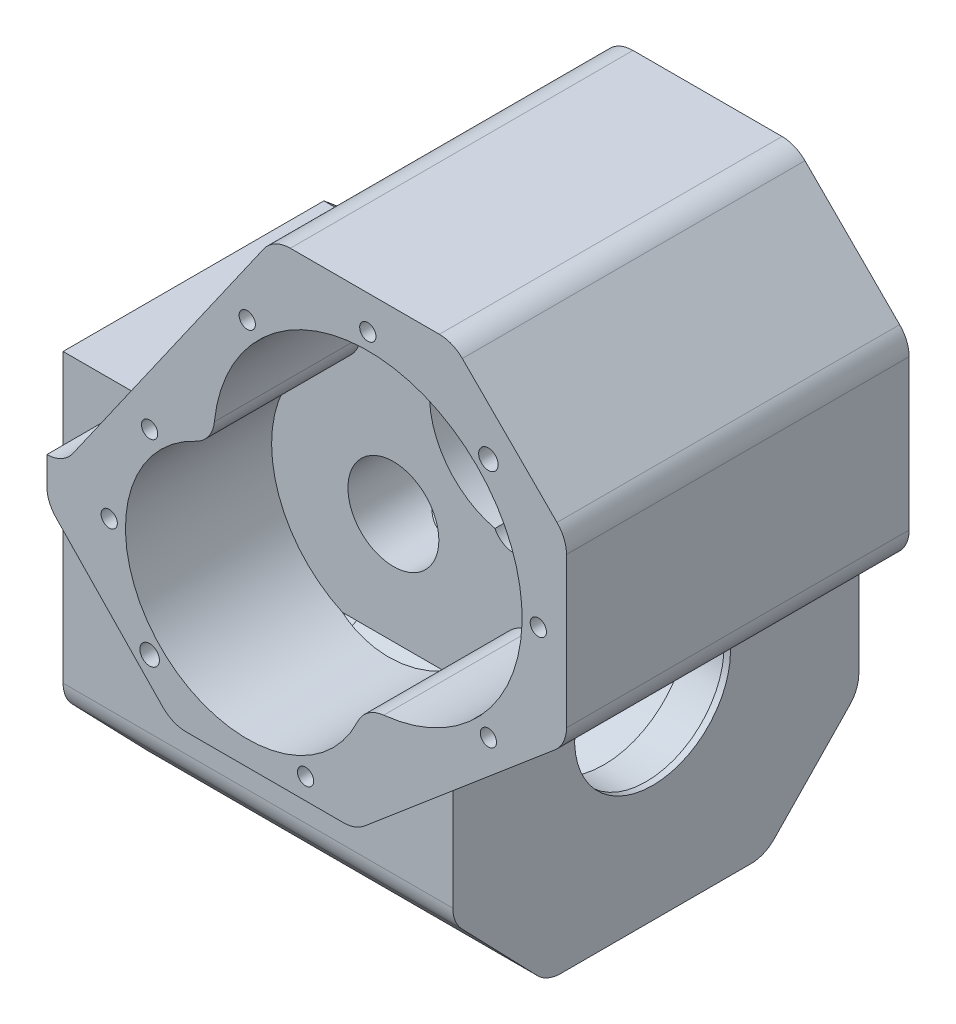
ISO-10303-21;
HEADER;
FILE_DESCRIPTION(('STEP AP214'),'2;1');
FILE_NAME('part.step','',(''),(''),'','','');
FILE_SCHEMA(('AUTOMOTIVE_DESIGN { 1 0 10303 214 1 1 1 1 }'));
ENDSEC;
DATA;
#1=APPLICATION_CONTEXT('core data for automotive mechanical design processes');
#2=APPLICATION_PROTOCOL_DEFINITION('international standard','automotive_design',2000,#1);
#3=PRODUCT_CONTEXT('',#1,'mechanical');
#4=PRODUCT('Part','Part','',(#3));
#5=PRODUCT_RELATED_PRODUCT_CATEGORY('part','',(#4));
#6=PRODUCT_DEFINITION_FORMATION('','',#4);
#7=PRODUCT_DEFINITION_CONTEXT('part definition',#1,'design');
#8=PRODUCT_DEFINITION('design','',#6,#7);
#9=PRODUCT_DEFINITION_SHAPE('','',#8);
#10=(LENGTH_UNIT() NAMED_UNIT(*) SI_UNIT(.MILLI.,.METRE.));
#11=(NAMED_UNIT(*) PLANE_ANGLE_UNIT() SI_UNIT($,.RADIAN.));
#12=(NAMED_UNIT(*) SI_UNIT($,.STERADIAN.) SOLID_ANGLE_UNIT());
#13=UNCERTAINTY_MEASURE_WITH_UNIT(LENGTH_MEASURE(1.E-05),#10,'distance_accuracy_value','');
#14=(GEOMETRIC_REPRESENTATION_CONTEXT(3) GLOBAL_UNCERTAINTY_ASSIGNED_CONTEXT((#13)) GLOBAL_UNIT_ASSIGNED_CONTEXT((#10,
#11,#12)) REPRESENTATION_CONTEXT('',''));
#15=CARTESIAN_POINT('',(0.,0.,0.));
#16=DIRECTION('',(0.,0.,1.));
#17=DIRECTION('',(1.,0.,0.));
#18=AXIS2_PLACEMENT_3D('',#15,#16,#17);
#19=CARTESIAN_POINT('',(-77.5,-5.0039738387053,-5.78432659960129));
#20=DIRECTION('',(0.,-0.499999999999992,0.866025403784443));
#21=DIRECTION('',(0.,-0.866025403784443,-0.499999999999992));
#22=AXIS2_PLACEMENT_3D('',#19,#20,#21);
#23=CYLINDRICAL_SURFACE('',#22,5.5);
#24=CARTESIAN_POINT('',(-77.5,-22.4051897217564,13.3554634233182));
#25=CARTESIAN_POINT('',(-77.345892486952,-22.4051912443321,13.3554630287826));
#26=CARTESIAN_POINT('',(-77.1918081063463,-22.3992519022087,13.3581377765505));
#27=CARTESIAN_POINT('',(-76.8846889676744,-22.3755459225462,13.3688295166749));
#28=CARTESIAN_POINT('',(-76.7316544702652,-22.3577764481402,13.3768477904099));
#29=CARTESIAN_POINT('',(-76.4276567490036,-22.310537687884,13.3982139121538));
#30=CARTESIAN_POINT('',(-76.2766952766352,-22.2810590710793,13.4115660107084));
#31=CARTESIAN_POINT('',(-75.9779830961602,-22.2106391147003,13.4435665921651));
#32=CARTESIAN_POINT('',(-75.8302335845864,-22.169693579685,13.4622170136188));
#33=CARTESIAN_POINT('',(-75.5391933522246,-22.0767333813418,13.5047356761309));
#34=CARTESIAN_POINT('',(-75.3958984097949,-22.0247295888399,13.5285987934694));
#35=CARTESIAN_POINT('',(-75.1145727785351,-21.9100388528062,13.5814895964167));
#36=CARTESIAN_POINT('',(-74.9765440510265,-21.8473479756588,13.6105191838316));
#37=CARTESIAN_POINT('',(-74.7068522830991,-21.7118488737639,13.6736254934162));
#38=CARTESIAN_POINT('',(-74.5751856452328,-21.6390464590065,13.7076993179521));
#39=CARTESIAN_POINT('',(-74.3190052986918,-21.4838566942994,13.7808049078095));
#40=CARTESIAN_POINT('',(-74.1944942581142,-21.4014658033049,13.8198385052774));
#41=CARTESIAN_POINT('',(-73.9531997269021,-21.2275289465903,13.902833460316));
#42=CARTESIAN_POINT('',(-73.83643944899,-21.1359573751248,13.9468086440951));
#43=CARTESIAN_POINT('',(-73.6118161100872,-20.9445485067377,14.0394444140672));
#44=CARTESIAN_POINT('',(-73.5039563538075,-20.8447081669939,14.0881067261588));
#45=CARTESIAN_POINT('',(-73.2979734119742,-20.6376079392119,14.1898878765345));
#46=CARTESIAN_POINT('',(-73.1998470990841,-20.5303504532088,14.2430052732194));
#47=CARTESIAN_POINT('',(-73.0139492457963,-20.3091793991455,14.3534979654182));
#48=CARTESIAN_POINT('',(-72.9261815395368,-20.1952633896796,14.4108748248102));
#49=CARTESIAN_POINT('',(-72.7615225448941,-19.9614836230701,14.5297037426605));
#50=CARTESIAN_POINT('',(-72.6846504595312,-19.8416098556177,14.5911627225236));
#51=CARTESIAN_POINT('',(-72.5424898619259,-19.5969744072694,14.7177770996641));
#52=CARTESIAN_POINT('',(-72.4772056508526,-19.472210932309,14.7829338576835));
#53=CARTESIAN_POINT('',(-72.3587509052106,-19.2188234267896,14.9165520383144));
#54=CARTESIAN_POINT('',(-72.3055756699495,-19.0902009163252,14.9850121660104));
#55=CARTESIAN_POINT('',(-72.2116784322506,-18.830018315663,15.1248622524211));
#56=CARTESIAN_POINT('',(-72.1709610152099,-18.6984571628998,15.1962532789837));
#57=CARTESIAN_POINT('',(-72.0682732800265,-18.3018257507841,15.4136435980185));
#58=CARTESIAN_POINT('',(-72.0252361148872,-18.0336666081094,15.5634600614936));
#59=CARTESIAN_POINT('',(-71.991320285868,-17.497603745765,15.868985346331));
#60=CARTESIAN_POINT('',(-72.0004402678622,-17.2297000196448,16.024694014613));
#61=CARTESIAN_POINT('',(-72.0703720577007,-16.7025385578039,16.3370149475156));
#62=CARTESIAN_POINT('',(-72.1309987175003,-16.4432533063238,16.4936219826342));
#63=CARTESIAN_POINT('',(-72.3019528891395,-15.9394525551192,16.8034035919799));
#64=CARTESIAN_POINT('',(-72.4122810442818,-15.6949372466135,16.9565781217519));
#65=CARTESIAN_POINT('',(-72.6797032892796,-15.2266794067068,17.2547123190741));
#66=CARTESIAN_POINT('',(-72.8368788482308,-15.0029739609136,17.3996571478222));
#67=CARTESIAN_POINT('',(-73.1934764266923,-14.5824888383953,17.676006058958));
#68=CARTESIAN_POINT('',(-73.3928996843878,-14.3857099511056,17.8074097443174));
#69=CARTESIAN_POINT('',(-73.8293706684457,-14.0231184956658,18.0524367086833));
#70=CARTESIAN_POINT('',(-74.0665791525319,-13.8574451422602,18.1659797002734));
#71=CARTESIAN_POINT('',(-74.5713297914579,-13.5621577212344,18.3702491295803));
#72=CARTESIAN_POINT('',(-74.8388719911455,-13.4325437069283,18.4609755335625));
#73=CARTESIAN_POINT('',(-75.3968205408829,-13.21247034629,18.6160254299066));
#74=CARTESIAN_POINT('',(-75.6872318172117,-13.1220194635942,18.6803432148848));
#75=CARTESIAN_POINT('',(-76.2826125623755,-12.9824991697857,18.7799032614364));
#76=CARTESIAN_POINT('',(-76.5875815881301,-12.9334285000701,18.815146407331));
#77=CARTESIAN_POINT('',(-77.2020119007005,-12.8779744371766,18.8549929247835));
#78=CARTESIAN_POINT('',(-77.5114481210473,-12.8714077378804,18.8597278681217));
#79=CARTESIAN_POINT('',(-78.1272658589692,-12.9006320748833,18.8387092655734));
#80=CARTESIAN_POINT('',(-78.4336474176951,-12.9364225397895,18.8129561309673));
#81=CARTESIAN_POINT('',(-79.0340039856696,-13.0493785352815,18.7321259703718));
#82=CARTESIAN_POINT('',(-79.3280036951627,-13.1264570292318,18.6771106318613));
#83=CARTESIAN_POINT('',(-79.8960187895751,-13.3200953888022,18.5400441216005));
#84=CARTESIAN_POINT('',(-80.1700337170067,-13.4366561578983,18.457992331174));
#85=CARTESIAN_POINT('',(-80.6913248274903,-13.7069495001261,18.2697877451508));
#86=CARTESIAN_POINT('',(-80.9385068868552,-13.8608071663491,18.1635539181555));
#87=CARTESIAN_POINT('',(-81.3981610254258,-14.2017914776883,17.9312299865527));
#88=CARTESIAN_POINT('',(-81.6106322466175,-14.3889189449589,17.8051393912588));
#89=CARTESIAN_POINT('',(-81.9956078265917,-14.7925967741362,17.5372806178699));
#90=CARTESIAN_POINT('',(-82.1679657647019,-15.0092504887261,17.3954577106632));
#91=CARTESIAN_POINT('',(-82.4668129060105,-15.4659872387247,17.101554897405));
#92=CARTESIAN_POINT('',(-82.5933027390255,-15.7060699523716,16.9494751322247));
#93=CARTESIAN_POINT('',(-82.7965799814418,-16.2028565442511,16.6405297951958));
#94=CARTESIAN_POINT('',(-82.8734561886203,-16.4595298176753,16.4836733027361));
#95=CARTESIAN_POINT('',(-82.975592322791,-16.9830672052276,16.1698367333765));
#96=CARTESIAN_POINT('',(-83.0008536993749,-17.2499310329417,16.0128566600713));
#97=CARTESIAN_POINT('',(-82.9995400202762,-17.6512416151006,15.781351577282));
#98=CARTESIAN_POINT('',(-82.9926114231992,-17.7849593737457,15.7049668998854));
#99=CARTESIAN_POINT('',(-82.9658663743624,-18.0520366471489,15.5538768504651));
#100=CARTESIAN_POINT('',(-82.9460547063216,-18.1853962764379,15.4791708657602));
#101=CARTESIAN_POINT('',(-82.8936728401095,-18.4508416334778,15.3319061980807));
#102=CARTESIAN_POINT('',(-82.8610979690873,-18.5829268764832,15.2593483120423));
#103=CARTESIAN_POINT('',(-82.7834443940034,-18.8447677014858,15.1168828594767));
#104=CARTESIAN_POINT('',(-82.7383702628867,-18.9745241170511,15.0469743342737));
#105=CARTESIAN_POINT('',(-82.6360265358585,-19.2308221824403,14.910180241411));
#106=CARTESIAN_POINT('',(-82.5787541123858,-19.3573630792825,14.8432953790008));
#107=CARTESIAN_POINT('',(-82.4524547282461,-19.6062087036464,14.7129619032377));
#108=CARTESIAN_POINT('',(-82.3834320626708,-19.7285149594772,14.6495120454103));
#109=CARTESIAN_POINT('',(-82.2340825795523,-19.9680618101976,14.5263313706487));
#110=CARTESIAN_POINT('',(-82.1537517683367,-20.0853005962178,14.4666018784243));
#111=CARTESIAN_POINT('',(-81.9824037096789,-20.3137350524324,14.3511984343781));
#112=CARTESIAN_POINT('',(-81.8913903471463,-20.4249328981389,14.2955230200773));
#113=CARTESIAN_POINT('',(-81.6988530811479,-20.6409736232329,14.1882118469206));
#114=CARTESIAN_POINT('',(-81.5972830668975,-20.7457851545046,14.1365957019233));
#115=CARTESIAN_POINT('',(-81.3847338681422,-20.9476438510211,14.0379258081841));
#116=CARTESIAN_POINT('',(-81.2737581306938,-21.0446938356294,13.9908704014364));
#117=CARTESIAN_POINT('',(-81.0430736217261,-21.2303648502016,13.9014609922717));
#118=CARTESIAN_POINT('',(-80.9233595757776,-21.3189807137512,13.8591098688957));
#119=CARTESIAN_POINT('',(-80.6761440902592,-21.4869787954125,13.7793153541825));
#120=CARTESIAN_POINT('',(-80.5486455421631,-21.566364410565,13.7418701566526));
#121=CARTESIAN_POINT('',(-80.2863329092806,-21.7155169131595,13.6718989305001));
#122=CARTESIAN_POINT('',(-80.1514985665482,-21.7852550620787,13.6393875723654));
#123=CARTESIAN_POINT('',(-79.875862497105,-21.9142404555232,13.5795356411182));
#124=CARTESIAN_POINT('',(-79.7350629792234,-21.9734915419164,13.5521931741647));
#125=CARTESIAN_POINT('',(-79.4485638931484,-22.0809974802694,13.5027718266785));
#126=CARTESIAN_POINT('',(-79.302868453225,-22.1292613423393,13.4806886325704));
#127=CARTESIAN_POINT('',(-79.0075573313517,-22.2144376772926,13.4418304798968));
#128=CARTESIAN_POINT('',(-78.8579426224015,-22.2513529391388,13.4250542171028));
#129=CARTESIAN_POINT('',(-78.5090609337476,-22.3231531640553,13.3924890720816));
#130=CARTESIAN_POINT('',(-78.3087435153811,-22.3538821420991,13.378608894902));
#131=CARTESIAN_POINT('',(-77.9056040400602,-22.3948993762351,13.3600963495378));
#132=CARTESIAN_POINT('',(-77.7027819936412,-22.4051877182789,13.3554639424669));
#133=CARTESIAN_POINT('',(-77.5,-22.4051897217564,13.3554634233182));
#134=B_SPLINE_CURVE_WITH_KNOTS('',3,(#24,#25,#26,#27,#28,#29,#30,#31,#32,#33,#34,#35,#36,#37,
#38,#39,#40,#41,#42,#43,#44,#45,#46,#47,#48,#49,#50,#51,#52,#53,#54,#55,#56,#57,#58,#59,#60,#61,
#62,#63,#64,#65,#66,#67,#68,#69,#70,#71,#72,#73,#74,#75,#76,#77,#78,#79,#80,#81,#82,#83,#84,#85,
#86,#87,#88,#89,#90,#91,#92,#93,#94,#95,#96,#97,#98,#99,#100,#101,#102,#103,#104,#105,#106,#107,
#108,#109,#110,#111,#112,#113,#114,#115,#116,#117,#118,#119,#120,#121,#122,#123,#124,#125,#126,
#127,#128,#129,#130,#131,#132,#133),.UNSPECIFIED.,.T.,.F.,(4,2,2,2,2,2,2,2,2,2,2,2,2,2,2,2,2,2,
2,2,2,2,2,2,2,2,2,2,2,2,2,2,2,2,2,2,2,2,2,2,2,2,2,2,2,2,2,2,2,2,2,2,2,2,4),(0.,0.46214519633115,
0.924401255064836,1.38702642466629,1.84982107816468,2.31216286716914,2.77467520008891,
3.23692286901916,3.69934179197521,4.16308835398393,4.62700633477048,5.0907747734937,
5.5547143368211,6.01946166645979,6.48438114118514,6.94911982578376,7.41402936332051,
8.33971880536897,9.26538421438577,10.1877361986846,11.1101001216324,12.0340775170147,
12.958081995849,13.8861281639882,14.8141757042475,15.7424237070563,16.6706434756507,
17.594857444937,18.5190589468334,19.4413198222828,20.3636018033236,21.2890209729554,
22.2144630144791,23.1432318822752,24.0719879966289,24.9990771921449,25.9261403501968,
26.3881490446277,26.8499862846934,27.3119927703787,27.7738304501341,28.2357753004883,
28.6975516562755,29.1594915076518,29.6212638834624,30.085145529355,30.5488578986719,
31.0128525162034,31.4766758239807,31.9418523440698,32.4068580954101,32.8714811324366,
33.3359898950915,33.9441050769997,34.5522177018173),.UNSPECIFIED.);
#135=CARTESIAN_POINT('',(-77.5,-22.4051897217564,13.3554634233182));
#136=VERTEX_POINT('',#135);
#137=EDGE_CURVE('E483',#136,#136,#134,.T.);
#138=ORIENTED_EDGE('',*,*,#137,.T.);
#139=EDGE_LOOP('',(#138));
#140=FACE_BOUND('',#139,.T.);
#141=CARTESIAN_POINT('',(-77.5,-15.7535634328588,12.8345087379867));
#142=DIRECTION('',(0.,0.499999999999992,-0.866025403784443));
#143=DIRECTION('',(0.,0.866025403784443,0.499999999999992));
#144=AXIS2_PLACEMENT_3D('',#141,#142,#143);
#145=CIRCLE('',#144,5.5);
#146=CARTESIAN_POINT('',(-77.5,-10.9904237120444,15.5845087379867));
#147=VERTEX_POINT('',#146);
#148=EDGE_CURVE('E463',#147,#147,#145,.T.);
#149=ORIENTED_EDGE('',*,*,#148,.T.);
#150=EDGE_LOOP('',(#149));
#151=FACE_BOUND('',#150,.T.);
#152=ADVANCED_FACE('F51',(#140,#151),#23,.F.);
#153=CARTESIAN_POINT('',(-67.4999999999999,-105.,125.));
#154=DIRECTION('',(0.,0.,-1.));
#155=DIRECTION('',(-1.,0.,0.));
#156=AXIS2_PLACEMENT_3D('',#153,#154,#155);
#157=PLANE('',#156);
#158=DIRECTION('',(0.,-1.,0.));
#159=VECTOR('',#158,1.);
#160=CARTESIAN_POINT('',(-92.5,-105.,125.));
#161=LINE('',#160,#159);
#162=CARTESIAN_POINT('',(-92.5,17.5,125.));
#163=VERTEX_POINT('',#162);
#164=CARTESIAN_POINT('',(-92.5,-70.9597377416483,125.));
#165=VERTEX_POINT('',#164);
#166=EDGE_CURVE('E764',#163,#165,#161,.T.);
#167=ORIENTED_EDGE('',*,*,#166,.T.);
#168=DIRECTION('',(-1.,0.,0.));
#169=VECTOR('',#168,1.);
#170=CARTESIAN_POINT('',(27.5,-70.9597377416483,125.));
#171=LINE('',#170,#169);
#172=CARTESIAN_POINT('',(27.5,-70.9597377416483,125.));
#173=VERTEX_POINT('',#172);
#174=EDGE_CURVE('E1075',#165,#173,#171,.F.);
#175=ORIENTED_EDGE('',*,*,#174,.T.);
#176=DIRECTION('',(0.,-1.,0.));
#177=VECTOR('',#176,1.);
#178=CARTESIAN_POINT('',(27.5,-105.,125.));
#179=LINE('',#178,#177);
#180=CARTESIAN_POINT('',(27.5,-35.,125.));
#181=VERTEX_POINT('',#180);
#182=EDGE_CURVE('E759',#181,#173,#179,.T.);
#183=ORIENTED_EDGE('',*,*,#182,.F.);
#184=DIRECTION('',(-0.763386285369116,-0.645942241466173,0.));
#185=VECTOR('',#184,1.);
#186=CARTESIAN_POINT('',(27.5,-35.,125.));
#187=LINE('',#186,#185);
#188=CARTESIAN_POINT('',(30.2963439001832,-32.6338628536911,125.));
#189=VERTEX_POINT('',#188);
#190=EDGE_CURVE('E589',#189,#181,#187,.T.);
#191=ORIENTED_EDGE('',*,*,#190,.F.);
#192=CARTESIAN_POINT('',(23.8369214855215,-25.,125.));
#193=DIRECTION('',(0.,0.,-1.));
#194=DIRECTION('',(-1.,0.,0.));
#195=AXIS2_PLACEMENT_3D('',#192,#193,#194);
#196=CIRCLE('',#195,10.);
#197=CARTESIAN_POINT('',(23.8369214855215,-35.,125.));
#198=VERTEX_POINT('',#197);
#199=EDGE_CURVE('E629',#189,#198,#196,.T.);
#200=ORIENTED_EDGE('',*,*,#199,.T.);
#201=DIRECTION('',(-1.,0.,0.));
#202=VECTOR('',#201,1.);
#203=CARTESIAN_POINT('',(92.5,-35.,125.));
#204=LINE('',#203,#202);
#205=CARTESIAN_POINT('',(-24.627700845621,-35.,125.));
#206=VERTEX_POINT('',#205);
#207=EDGE_CURVE('E756',#198,#206,#204,.T.);
#208=ORIENTED_EDGE('',*,*,#207,.T.);
#209=CARTESIAN_POINT('',(-24.627700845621,-25.,125.));
#210=DIRECTION('',(0.,0.,-1.));
#211=DIRECTION('',(-1.,0.,0.));
#212=AXIS2_PLACEMENT_3D('',#209,#210,#211);
#213=CIRCLE('',#212,10.);
#214=CARTESIAN_POINT('',(-31.8210988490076,-31.94658370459,125.));
#215=VERTEX_POINT('',#214);
#216=EDGE_CURVE('E625',#206,#215,#213,.T.);
#217=ORIENTED_EDGE('',*,*,#216,.T.);
#218=DIRECTION('',(-0.694658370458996,0.719339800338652,0.));
#219=VECTOR('',#218,1.);
#220=CARTESIAN_POINT('',(-12.5335045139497,-51.9194723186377,125.));
#221=LINE('',#220,#219);
#222=CARTESIAN_POINT('',(-64.6933980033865,2.09367855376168,125.));
#223=VERTEX_POINT('',#222);
#224=EDGE_CURVE('E1209',#215,#223,#221,.T.);
#225=ORIENTED_EDGE('',*,*,#224,.T.);
#226=CARTESIAN_POINT('',(-57.5,9.04026225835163,125.));
#227=DIRECTION('',(0.,0.,-1.));
#228=DIRECTION('',(-1.,0.,0.));
#229=AXIS2_PLACEMENT_3D('',#226,#227,#228);
#230=CIRCLE('',#229,10.);
#231=CARTESIAN_POINT('',(-67.5,9.04026225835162,125.));
#232=VERTEX_POINT('',#231);
#233=EDGE_CURVE('E627',#223,#232,#230,.T.);
#234=ORIENTED_EDGE('',*,*,#233,.T.);
#235=DIRECTION('',(0.,-1.,0.));
#236=VECTOR('',#235,1.);
#237=CARTESIAN_POINT('',(-67.4999999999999,-105.,125.));
#238=LINE('',#237,#236);
#239=CARTESIAN_POINT('',(-67.5,17.5021152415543,125.));
#240=VERTEX_POINT('',#239);
#241=EDGE_CURVE('E767',#240,#232,#238,.T.);
#242=ORIENTED_EDGE('',*,*,#241,.F.);
#243=CARTESIAN_POINT('',(-67.7056705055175,27.5,125.));
#244=DIRECTION('',(0.,0.,-1.));
#245=DIRECTION('',(-1.,0.,0.));
#246=AXIS2_PLACEMENT_3D('',#243,#244,#245);
#247=CIRCLE('',#246,10.);
#248=CARTESIAN_POINT('',(-67.7056705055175,17.5,125.));
#249=VERTEX_POINT('',#248);
#250=EDGE_CURVE('E1048',#240,#249,#247,.T.);
#251=ORIENTED_EDGE('',*,*,#250,.T.);
#252=DIRECTION('',(1.,0.,0.));
#253=VECTOR('',#252,1.);
#254=CARTESIAN_POINT('',(-92.5,17.5,125.));
#255=LINE('',#254,#253);
#256=EDGE_CURVE('E1202',#163,#249,#255,.T.);
#257=ORIENTED_EDGE('',*,*,#256,.F.);
#258=EDGE_LOOP('',(#167,#175,#183,#191,#200,#208,#217,#225,#234,#242,#251,#257));
#259=FACE_BOUND('',#258,.T.);
#260=CARTESIAN_POINT('',(-77.5,-9.48765999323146,125.));
#261=DIRECTION('',(0.,0.,-1.));
#262=DIRECTION('',(0.,1.,0.));
#263=AXIS2_PLACEMENT_3D('',#260,#261,#262);
#264=ELLIPSE('',#263,11.5470053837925,10.);
#265=CARTESIAN_POINT('',(-77.5,2.05934539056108,125.));
#266=VERTEX_POINT('',#265);
#267=EDGE_CURVE('E475',#266,#266,#264,.F.);
#268=ORIENTED_EDGE('',*,*,#267,.F.);
#269=EDGE_LOOP('',(#268));
#270=FACE_BOUND('',#269,.T.);
#271=ADVANCED_FACE('F502',(#259,#270),#157,.F.);
#272=CARTESIAN_POINT('',(12.5,-45.,63.5));
#273=DIRECTION('',(-1.,0.,0.));
#274=DIRECTION('',(0.,-1.,0.));
#275=AXIS2_PLACEMENT_3D('',#272,#273,#274);
#276=CYLINDRICAL_SURFACE('',#275,55.);
#277=ORIENTED_EDGE('',*,*,#137,.F.);
#278=EDGE_LOOP('',(#277));
#279=FACE_BOUND('',#278,.T.);
#280=CARTESIAN_POINT('',(-72.0000019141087,-100.,63.5));
#281=CARTESIAN_POINT('',(-72.0001289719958,-100.000000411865,63.3458889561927));
#282=CARTESIAN_POINT('',(-72.0067388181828,-99.9993509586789,63.1918064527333));
#283=CARTESIAN_POINT('',(-72.0328721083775,-99.9967724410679,62.8847017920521));
#284=CARTESIAN_POINT('',(-72.0523986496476,-99.994843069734,62.7316798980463));
#285=CARTESIAN_POINT('',(-72.1042477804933,-99.9897566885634,62.4277180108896));
#286=CARTESIAN_POINT('',(-72.1365805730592,-99.986598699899,62.2767797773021));
#287=CARTESIAN_POINT('',(-72.2138193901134,-99.9791434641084,61.9781245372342));
#288=CARTESIAN_POINT('',(-72.2587300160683,-99.9748458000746,61.8304087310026));
#289=CARTESIAN_POINT('',(-72.3607434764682,-99.9652380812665,61.539445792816));
#290=CARTESIAN_POINT('',(-72.4178343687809,-99.9599290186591,61.3961944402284));
#291=CARTESIAN_POINT('',(-72.5438467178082,-99.9484433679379,61.1149661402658));
#292=CARTESIAN_POINT('',(-72.6127725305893,-99.9422664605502,60.9769911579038));
#293=CARTESIAN_POINT('',(-72.7619049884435,-99.929224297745,60.7074168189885));
#294=CARTESIAN_POINT('',(-72.8421051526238,-99.9223594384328,60.5758138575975));
#295=CARTESIAN_POINT('',(-73.013279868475,-99.9081286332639,60.3197705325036));
#296=CARTESIAN_POINT('',(-73.1042584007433,-99.9007625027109,60.1953328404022));
#297=CARTESIAN_POINT('',(-73.2965980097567,-99.885717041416,59.9541993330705));
#298=CARTESIAN_POINT('',(-73.397987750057,-99.8780368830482,59.8375264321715));
#299=CARTESIAN_POINT('',(-73.6102603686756,-99.8625970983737,59.6130859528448));
#300=CARTESIAN_POINT('',(-73.7211467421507,-99.8548374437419,59.5053216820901));
#301=CARTESIAN_POINT('',(-73.9515646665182,-99.8394634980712,59.2995370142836));
#302=CARTESIAN_POINT('',(-74.0710934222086,-99.8318491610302,59.2015134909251));
#303=CARTESIAN_POINT('',(-74.3180350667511,-99.8169762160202,59.0158278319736));
#304=CARTESIAN_POINT('',(-74.44545084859,-99.8097177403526,58.9281695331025));
#305=CARTESIAN_POINT('',(-74.7074623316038,-99.7957536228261,58.7637346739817));
#306=CARTESIAN_POINT('',(-74.8420701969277,-99.7890489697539,58.6869774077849));
#307=CARTESIAN_POINT('',(-75.1173572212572,-99.7763960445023,58.5450515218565));
#308=CARTESIAN_POINT('',(-75.2580386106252,-99.770448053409,58.479887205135));
#309=CARTESIAN_POINT('',(-75.544386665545,-99.7594847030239,58.3616763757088));
#310=CARTESIAN_POINT('',(-75.6900513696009,-99.7544689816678,58.3086251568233));
#311=CARTESIAN_POINT('',(-75.9853791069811,-99.7455088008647,58.2149792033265));
#312=CARTESIAN_POINT('',(-76.1350435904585,-99.7415647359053,58.1743890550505));
#313=CARTESIAN_POINT('',(-76.5873158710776,-99.7315512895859,58.0720857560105));
#314=CARTESIAN_POINT('',(-76.8944912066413,-99.7272497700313,58.0293093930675));
#315=CARTESIAN_POINT('',(-77.5115219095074,-99.723900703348,57.9959167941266));
#316=CARTESIAN_POINT('',(-77.8213772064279,-99.7248530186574,58.0052991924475));
#317=CARTESIAN_POINT('',(-78.433997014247,-99.7318802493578,58.0757474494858));
#318=CARTESIAN_POINT('',(-78.7367830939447,-99.7379366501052,58.1366265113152));
#319=CARTESIAN_POINT('',(-79.327806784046,-99.7544627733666,58.3080682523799));
#320=CARTESIAN_POINT('',(-79.6160441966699,-99.7649325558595,58.4186316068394));
#321=CARTESIAN_POINT('',(-80.1703989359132,-99.7891259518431,58.6865078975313));
#322=CARTESIAN_POINT('',(-80.4364755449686,-99.8028553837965,58.8439045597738));
#323=CARTESIAN_POINT('',(-80.9385059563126,-99.8320151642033,59.2009204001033));
#324=CARTESIAN_POINT('',(-81.1744588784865,-99.8474455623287,59.4005408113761));
#325=CARTESIAN_POINT('',(-81.610631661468,-99.8783498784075,59.8373837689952));
#326=CARTESIAN_POINT('',(-81.810689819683,-99.8938236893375,60.0747678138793));
#327=CARTESIAN_POINT('',(-82.1681416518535,-99.9230054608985,60.5798373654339));
#328=CARTESIAN_POINT('',(-82.3255352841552,-99.9367134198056,60.8475229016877));
#329=CARTESIAN_POINT('',(-82.5931805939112,-99.960821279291,61.4057027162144));
#330=CARTESIAN_POINT('',(-82.7034250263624,-99.971220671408,61.696200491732));
#331=CARTESIAN_POINT('',(-82.8735286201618,-99.9875321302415,62.2917101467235));
#332=CARTESIAN_POINT('',(-82.9333892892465,-99.9934443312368,62.5967215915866));
#333=CARTESIAN_POINT('',(-83.000822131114,-100.000096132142,63.2111969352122));
#334=CARTESIAN_POINT('',(-83.0086179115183,-100.000857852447,63.5206360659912));
#335=CARTESIAN_POINT('',(-82.9722863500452,-99.9971797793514,64.1364157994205));
#336=CARTESIAN_POINT('',(-82.9281597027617,-99.9927400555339,64.4427564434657));
#337=CARTESIAN_POINT('',(-82.7894207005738,-99.9791699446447,65.0430052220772));
#338=CARTESIAN_POINT('',(-82.694911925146,-99.9700491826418,65.3369375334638));
#339=CARTESIAN_POINT('',(-82.4581976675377,-99.9481379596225,65.9047761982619));
#340=CARTESIAN_POINT('',(-82.3159911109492,-99.9353474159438,66.1786821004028));
#341=CARTESIAN_POINT('',(-81.987360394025,-99.9074700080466,66.6997072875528));
#342=CARTESIAN_POINT('',(-81.800788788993,-99.8923755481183,66.9467331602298));
#343=CARTESIAN_POINT('',(-81.3889352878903,-99.8616071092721,67.4060412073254));
#344=CARTESIAN_POINT('',(-81.1636524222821,-99.8459331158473,67.6183225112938));
#345=CARTESIAN_POINT('',(-80.6798018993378,-99.8157042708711,68.0028889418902));
#346=CARTESIAN_POINT('',(-80.421117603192,-99.8011536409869,68.175027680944));
#347=CARTESIAN_POINT('',(-79.8783686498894,-99.7748818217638,68.4734153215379));
#348=CARTESIAN_POINT('',(-79.5943043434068,-99.7631605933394,68.5996648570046));
#349=CARTESIAN_POINT('',(-79.0094262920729,-99.7438986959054,68.8024486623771));
#350=CARTESIAN_POINT('',(-78.7086433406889,-99.7363506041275,68.8790712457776));
#351=CARTESIAN_POINT('',(-78.0982328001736,-99.7262711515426,68.9806911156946));
#352=CARTESIAN_POINT('',(-77.7886054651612,-99.7237396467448,69.0056898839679));
#353=CARTESIAN_POINT('',(-77.3253105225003,-99.7239073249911,69.0039819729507));
#354=CARTESIAN_POINT('',(-77.1713276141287,-99.7246195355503,68.9969228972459));
#355=CARTESIAN_POINT('',(-76.8645226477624,-99.727325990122,68.9699189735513));
#356=CARTESIAN_POINT('',(-76.7117001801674,-99.729319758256,68.9499789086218));
#357=CARTESIAN_POINT('',(-76.4082428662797,-99.734535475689,68.8973432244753));
#358=CARTESIAN_POINT('',(-76.2576088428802,-99.7377578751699,68.8646429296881));
#359=CARTESIAN_POINT('',(-75.9596939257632,-99.7453366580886,68.7867424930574));
#360=CARTESIAN_POINT('',(-75.8124118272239,-99.7496926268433,68.7415469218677));
#361=CARTESIAN_POINT('',(-75.5221524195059,-99.7594164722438,68.6389648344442));
#362=CARTESIAN_POINT('',(-75.3791761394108,-99.7647845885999,68.5815754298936));
#363=CARTESIAN_POINT('',(-75.0986197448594,-99.7763775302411,68.4550475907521));
#364=CARTESIAN_POINT('',(-74.9610376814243,-99.7826020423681,68.3859134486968));
#365=CARTESIAN_POINT('',(-74.6921288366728,-99.795735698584,68.2363471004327));
#366=CARTESIAN_POINT('',(-74.5608042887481,-99.8026450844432,68.1559109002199));
#367=CARTESIAN_POINT('',(-74.3054245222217,-99.8169492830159,67.9843588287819));
#368=CARTESIAN_POINT('',(-74.1813666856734,-99.8243439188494,67.8932468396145));
#369=CARTESIAN_POINT('',(-73.9407753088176,-99.8394481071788,67.7005136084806));
#370=CARTESIAN_POINT('',(-73.8242792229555,-99.847158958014,67.5988457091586));
#371=CARTESIAN_POINT('',(-73.6003002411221,-99.8626424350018,67.3861075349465));
#372=CARTESIAN_POINT('',(-73.4928140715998,-99.8704150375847,67.2750407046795));
#373=CARTESIAN_POINT('',(-73.287499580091,-99.8858102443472,67.0441813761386));
#374=CARTESIAN_POINT('',(-73.1896771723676,-99.8934327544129,66.924383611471));
#375=CARTESIAN_POINT('',(-73.0044895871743,-99.9083050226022,66.6770087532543));
#376=CARTESIAN_POINT('',(-72.9171205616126,-99.9155549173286,66.5494345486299));
#377=CARTESIAN_POINT('',(-72.7531810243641,-99.9295006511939,66.2869827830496));
#378=CARTESIAN_POINT('',(-72.6766424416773,-99.9361948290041,66.1520851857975));
#379=CARTESIAN_POINT('',(-72.5352409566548,-99.9488133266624,65.8763323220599));
#380=CARTESIAN_POINT('',(-72.4703737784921,-99.9547379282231,65.7354792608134));
#381=CARTESIAN_POINT('',(-72.3527982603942,-99.965647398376,65.4488832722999));
#382=CARTESIAN_POINT('',(-72.3000799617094,-99.970633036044,65.3031444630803));
#383=CARTESIAN_POINT('',(-72.2071312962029,-99.9795280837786,65.00775718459));
#384=CARTESIAN_POINT('',(-72.1668978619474,-99.9834377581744,64.8581096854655));
#385=CARTESIAN_POINT('',(-72.0887227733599,-99.9910965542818,64.5091588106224));
#386=CARTESIAN_POINT('',(-72.0553361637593,-99.9944222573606,64.3088087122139));
#387=CARTESIAN_POINT('',(-72.01089218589,-99.9988737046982,63.9056225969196));
#388=CARTESIAN_POINT('',(-71.9998347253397,-99.999999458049,63.7027865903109));
#389=CARTESIAN_POINT('',(-72.0000019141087,-100.,63.5));
#390=B_SPLINE_CURVE_WITH_KNOTS('',3,(#280,#281,#282,#283,#284,#285,#286,#287,#288,#289,#290,
#291,#292,#293,#294,#295,#296,#297,#298,#299,#300,#301,#302,#303,#304,#305,#306,#307,#308,#309,
#310,#311,#312,#313,#314,#315,#316,#317,#318,#319,#320,#321,#322,#323,#324,#325,#326,#327,#328,
#329,#330,#331,#332,#333,#334,#335,#336,#337,#338,#339,#340,#341,#342,#343,#344,#345,#346,#347,
#348,#349,#350,#351,#352,#353,#354,#355,#356,#357,#358,#359,#360,#361,#362,#363,#364,#365,#366,
#367,#368,#369,#370,#371,#372,#373,#374,#375,#376,#377,#378,#379,#380,#381,#382,#383,#384,#385,
#386,#387,#388,#389),.UNSPECIFIED.,.T.,.F.,(4,2,2,2,2,2,2,2,2,2,2,2,2,2,2,2,2,2,2,2,2,2,2,2,2,2,
2,2,2,2,2,2,2,2,2,2,2,2,2,2,2,2,2,2,2,2,2,2,2,2,2,2,2,2,4),(0.,0.462155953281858,
0.924422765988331,1.38705861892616,1.84986394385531,2.31221757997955,2.7747417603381,
3.23700114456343,3.69943178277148,4.1631715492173,4.62708273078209,5.09084453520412,
5.55477746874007,6.01952156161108,6.48443779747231,6.94917309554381,7.41407923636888,
8.33976119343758,9.26541891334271,10.1877332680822,11.1100601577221,12.034045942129,
12.9580587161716,13.886134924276,14.8142120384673,15.7424317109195,16.6706236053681,
17.5948265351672,18.519017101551,19.4413149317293,20.3636335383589,21.2890613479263,
22.2145123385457,23.1432871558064,24.0720491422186,24.9991537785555,25.9262318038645,
26.3882211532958,26.8500390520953,27.3120263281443,27.7738448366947,28.2357728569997,
28.6975324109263,29.1594555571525,29.6212112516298,30.0851026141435,30.548824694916,
31.0128288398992,31.4766616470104,31.9418345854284,32.4068367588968,32.871456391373,
33.3359617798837,33.9440909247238,34.5522175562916),.UNSPECIFIED.);
#391=CARTESIAN_POINT('',(-72.0000019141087,-100.,63.5));
#392=VERTEX_POINT('',#391);
#393=EDGE_CURVE('E520',#392,#392,#390,.T.);
#394=ORIENTED_EDGE('',*,*,#393,.F.);
#395=EDGE_LOOP('',(#394));
#396=FACE_BOUND('',#395,.T.);
#397=CARTESIAN_POINT('',(-42.5,-45.,63.5));
#398=DIRECTION('',(-1.,0.,0.));
#399=DIRECTION('',(0.,-1.,0.));
#400=AXIS2_PLACEMENT_3D('',#397,#398,#399);
#401=CIRCLE('',#400,55.);
#402=CARTESIAN_POINT('',(-42.5,-100.,63.5));
#403=VERTEX_POINT('',#402);
#404=EDGE_CURVE('E910',#403,#403,#401,.T.);
#405=ORIENTED_EDGE('',*,*,#404,.F.);
#406=EDGE_LOOP('',(#405));
#407=FACE_BOUND('',#406,.T.);
#408=CARTESIAN_POINT('',(-77.5,-12.8709626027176,108.13994798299));
#409=CARTESIAN_POINT('',(-77.345892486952,-12.8709614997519,108.139946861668));
#410=CARTESIAN_POINT('',(-77.1918081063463,-12.8762475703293,108.143753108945));
#411=CARTESIAN_POINT('',(-76.8846889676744,-12.8973598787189,108.158937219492));
#412=CARTESIAN_POINT('',(-76.7316544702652,-12.913188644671,108.170316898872));
#413=CARTESIAN_POINT('',(-76.4276567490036,-12.9553116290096,108.200543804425));
#414=CARTESIAN_POINT('',(-76.2766952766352,-12.9816141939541,108.219396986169));
#415=CARTESIAN_POINT('',(-75.9779830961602,-13.044537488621,108.264382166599));
#416=CARTESIAN_POINT('',(-75.8302335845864,-13.0811619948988,108.290516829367));
#417=CARTESIAN_POINT('',(-75.5391933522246,-13.1644643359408,108.349763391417));
#418=CARTESIAN_POINT('',(-75.3958984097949,-13.2111322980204,108.382868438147));
#419=CARTESIAN_POINT('',(-75.1145727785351,-13.3142824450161,108.455748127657));
#420=CARTESIAN_POINT('',(-74.9765440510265,-13.3707682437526,108.495525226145));
#421=CARTESIAN_POINT('',(-74.7068522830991,-13.4931694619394,108.581317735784));
#422=CARTESIAN_POINT('',(-74.5751856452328,-13.5590794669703,108.627329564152));
#423=CARTESIAN_POINT('',(-74.3190052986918,-13.6999856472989,108.725175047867));
#424=CARTESIAN_POINT('',(-74.1944942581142,-13.7749851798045,108.777010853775));
#425=CARTESIAN_POINT('',(-73.9531997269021,-13.9338293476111,108.886147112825));
#426=CARTESIAN_POINT('',(-73.83643944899,-14.0176987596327,108.943462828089));
#427=CARTESIAN_POINT('',(-73.6118161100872,-14.1936281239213,109.062909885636));
#428=CARTESIAN_POINT('',(-73.5039563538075,-14.2856910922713,109.125043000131));
#429=CARTESIAN_POINT('',(-73.2979734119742,-14.4773862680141,109.253506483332));
#430=CARTESIAN_POINT('',(-73.1998470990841,-14.5770160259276,109.319835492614));
#431=CARTESIAN_POINT('',(-73.0139492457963,-14.783291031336,109.456128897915));
#432=CARTESIAN_POINT('',(-72.9261815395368,-14.8899388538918,109.526094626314));
#433=CARTESIAN_POINT('',(-72.7615225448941,-15.1097375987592,109.669139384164));
#434=CARTESIAN_POINT('',(-72.6846504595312,-15.2228995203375,109.742223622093));
#435=CARTESIAN_POINT('',(-72.5424898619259,-15.4548685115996,109.890776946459));
#436=CARTESIAN_POINT('',(-72.4772056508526,-15.5736776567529,109.96624690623));
#437=CARTESIAN_POINT('',(-72.3587509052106,-15.8160881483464,110.118877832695));
#438=CARTESIAN_POINT('',(-72.3055756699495,-15.9396876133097,110.196038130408));
#439=CARTESIAN_POINT('',(-72.2116784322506,-16.1908926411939,110.351437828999));
#440=CARTESIAN_POINT('',(-72.1709610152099,-16.318499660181,110.429677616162));
#441=CARTESIAN_POINT('',(-72.0682732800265,-16.7050809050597,110.664475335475));
#442=CARTESIAN_POINT('',(-72.0252361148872,-16.9689053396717,110.821799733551));
#443=CARTESIAN_POINT('',(-71.991320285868,-17.5015294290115,111.133281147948));
#444=CARTESIAN_POINT('',(-72.0004402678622,-17.7703289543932,111.287438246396));
#445=CARTESIAN_POINT('',(-72.0703720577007,-18.304387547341,111.587812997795));
#446=CARTESIAN_POINT('',(-72.1309987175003,-18.5696558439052,111.734057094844));
#447=CARTESIAN_POINT('',(-72.3019528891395,-19.089834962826,112.01547053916));
#448=CARTESIAN_POINT('',(-72.4122810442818,-19.3447456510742,112.150639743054));
#449=CARTESIAN_POINT('',(-72.6797032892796,-19.8370663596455,112.407095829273));
#450=CARTESIAN_POINT('',(-72.8368788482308,-20.074444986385,112.528358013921));
#451=CARTESIAN_POINT('',(-73.1934764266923,-20.524012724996,112.754334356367));
#452=CARTESIAN_POINT('',(-73.3928996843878,-20.736201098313,112.859048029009));
#453=CARTESIAN_POINT('',(-73.8293706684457,-21.1296964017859,113.050547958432));
#454=CARTESIAN_POINT('',(-74.0665791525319,-21.3108641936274,113.137253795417));
#455=CARTESIAN_POINT('',(-74.5713297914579,-21.6354104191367,113.290845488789));
#456=CARTESIAN_POINT('',(-74.8388719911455,-21.7787887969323,113.357731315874));
#457=CARTESIAN_POINT('',(-75.3968205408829,-22.0231026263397,113.470795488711));
#458=CARTESIAN_POINT('',(-75.6872318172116,-22.1240289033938,113.516969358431));
#459=CARTESIAN_POINT('',(-76.2826125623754,-22.2800105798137,113.588017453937));
#460=CARTESIAN_POINT('',(-76.5875815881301,-22.3350673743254,113.612892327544));
#461=CARTESIAN_POINT('',(-77.2020119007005,-22.3973025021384,113.640993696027));
#462=CARTESIAN_POINT('',(-77.5114481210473,-22.4046864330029,113.644313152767));
#463=CARTESIAN_POINT('',(-78.1272658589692,-22.3718716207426,113.629513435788));
#464=CARTESIAN_POINT('',(-78.4336474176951,-22.3316735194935,113.611394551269));
#465=CARTESIAN_POINT('',(-79.0340039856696,-22.2051945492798,113.553986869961));
#466=CARTESIAN_POINT('',(-79.3280036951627,-22.1190106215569,113.51474260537));
#467=CARTESIAN_POINT('',(-79.8960187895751,-21.9034883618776,113.415580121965));
#468=CARTESIAN_POINT('',(-80.1700337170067,-21.7741490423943,113.355661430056));
#469=CARTESIAN_POINT('',(-80.6913248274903,-21.4760124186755,113.215682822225));
#470=CARTESIAN_POINT('',(-80.9385068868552,-21.3070823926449,113.135555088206));
#471=CARTESIAN_POINT('',(-81.3981610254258,-20.9353918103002,112.956415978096));
#472=CARTESIAN_POINT('',(-81.6106322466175,-20.7326304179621,112.857404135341));
#473=CARTESIAN_POINT('',(-81.9956078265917,-20.2988190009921,112.641738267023));
#474=CARTESIAN_POINT('',(-82.1679657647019,-20.0676699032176,112.525022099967));
#475=CARTESIAN_POINT('',(-82.4668129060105,-19.5847742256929,112.276427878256));
#476=CARTESIAN_POINT('',(-82.5933027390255,-19.3330279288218,112.144550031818));
#477=CARTESIAN_POINT('',(-82.7965799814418,-18.8170801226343,111.868792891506));
#478=CARTESIAN_POINT('',(-82.8734561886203,-18.5529017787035,111.724935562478));
#479=CARTESIAN_POINT('',(-82.975592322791,-18.0193426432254,111.428457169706));
#480=CARTESIAN_POINT('',(-83.0008536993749,-17.7499619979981,111.275836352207));
#481=CARTESIAN_POINT('',(-82.9995400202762,-17.3488174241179,111.044043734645));
#482=CARTESIAN_POINT('',(-82.9926114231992,-17.21580747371,110.966433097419));
#483=CARTESIAN_POINT('',(-82.9658663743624,-16.9514210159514,110.810682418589));
#484=CARTESIAN_POINT('',(-82.9460547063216,-16.8200439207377,110.732542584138));
#485=CARTESIAN_POINT('',(-82.8936728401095,-16.5597862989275,110.576292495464));
#486=CARTESIAN_POINT('',(-82.8610979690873,-16.4309067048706,110.498182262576));
#487=CARTESIAN_POINT('',(-82.7834443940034,-16.1766075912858,110.342654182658));
#488=CARTESIAN_POINT('',(-82.7383702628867,-16.0511868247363,110.265236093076));
#489=CARTESIAN_POINT('',(-82.6360265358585,-15.804570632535,110.11167250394));
#490=CARTESIAN_POINT('',(-82.5787541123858,-15.6833761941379,110.035527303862));
#491=CARTESIAN_POINT('',(-82.4524547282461,-15.4460812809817,109.885187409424));
#492=CARTESIAN_POINT('',(-82.3834320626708,-15.3299789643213,109.810992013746));
#493=CARTESIAN_POINT('',(-82.2340825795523,-15.1035279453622,109.665128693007));
#494=CARTESIAN_POINT('',(-82.1537517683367,-14.9931812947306,109.593461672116));
#495=CARTESIAN_POINT('',(-81.9824037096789,-14.779021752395,109.453333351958));
#496=CARTESIAN_POINT('',(-81.8913903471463,-14.6752065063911,109.38487089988));
#497=CARTESIAN_POINT('',(-81.6988530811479,-14.4742519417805,109.251429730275));
#498=CARTESIAN_POINT('',(-81.5972830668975,-14.3771452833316,109.186468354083));
#499=CARTESIAN_POINT('',(-81.3847338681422,-14.1907653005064,109.060988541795));
#500=CARTESIAN_POINT('',(-81.2737581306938,-14.1014891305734,109.000468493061));
#501=CARTESIAN_POINT('',(-81.0430736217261,-13.9312228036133,108.884377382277));
#502=CARTESIAN_POINT('',(-80.9233595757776,-13.850237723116,108.828809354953));
#503=CARTESIAN_POINT('',(-80.6761440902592,-13.6971346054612,108.723216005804));
#504=CARTESIAN_POINT('',(-80.5486455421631,-13.6250133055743,108.673188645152));
#505=CARTESIAN_POINT('',(-80.2863329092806,-13.4898401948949,108.579004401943));
#506=CARTESIAN_POINT('',(-80.1514985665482,-13.4268154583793,108.534865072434));
#507=CARTESIAN_POINT('',(-79.875862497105,-13.3104894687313,108.453086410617));
#508=CARTESIAN_POINT('',(-79.7350629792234,-13.2571846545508,108.415444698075));
#509=CARTESIAN_POINT('',(-79.4485638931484,-13.160631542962,108.347052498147));
#510=CARTESIAN_POINT('',(-79.3028684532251,-13.1173750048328,108.316296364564));
#511=CARTESIAN_POINT('',(-79.0075573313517,-13.0411346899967,108.26196057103));
#512=CARTESIAN_POINT('',(-78.8579426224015,-13.0081483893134,108.238379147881));
#513=CARTESIAN_POINT('',(-78.5090609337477,-12.9440460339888,108.192480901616));
#514=CARTESIAN_POINT('',(-78.3087435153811,-12.9166609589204,108.172808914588));
#515=CARTESIAN_POINT('',(-77.9056040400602,-12.8801200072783,108.146543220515));
#516=CARTESIAN_POINT('',(-77.7027819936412,-12.8709640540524,108.139949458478));
#517=CARTESIAN_POINT('',(-77.5,-12.8709626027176,108.13994798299));
#518=B_SPLINE_CURVE_WITH_KNOTS('',3,(#408,#409,#410,#411,#412,#413,#414,#415,#416,#417,#418,
#419,#420,#421,#422,#423,#424,#425,#426,#427,#428,#429,#430,#431,#432,#433,#434,#435,#436,#437,
#438,#439,#440,#441,#442,#443,#444,#445,#446,#447,#448,#449,#450,#451,#452,#453,#454,#455,#456,
#457,#458,#459,#460,#461,#462,#463,#464,#465,#466,#467,#468,#469,#470,#471,#472,#473,#474,#475,
#476,#477,#478,#479,#480,#481,#482,#483,#484,#485,#486,#487,#488,#489,#490,#491,#492,#493,#494,
#495,#496,#497,#498,#499,#500,#501,#502,#503,#504,#505,#506,#507,#508,#509,#510,#511,#512,#513,
#514,#515,#516,#517),.UNSPECIFIED.,.T.,.F.,(4,2,2,2,2,2,2,2,2,2,2,2,2,2,2,2,2,2,2,2,2,2,2,2,2,2,
2,2,2,2,2,2,2,2,2,2,2,2,2,2,2,2,2,2,2,2,2,2,2,2,2,2,2,2,4),(0.,0.462145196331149,
0.924401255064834,1.38702642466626,1.84982107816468,2.31216286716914,2.77467520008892,
3.23692286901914,3.69934179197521,4.16308835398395,4.6270063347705,5.09077477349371,
5.55471433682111,6.0194616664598,6.48438114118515,6.94911982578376,7.41402936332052,
8.33971880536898,9.26538421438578,10.1877361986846,11.1101001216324,12.0340775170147,
12.958081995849,13.8861281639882,14.8141757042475,15.7424237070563,16.6706434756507,
17.594857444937,18.5190589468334,19.4413198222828,20.3636018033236,21.2890209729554,
22.2144630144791,23.1432318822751,24.0719879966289,24.9990771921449,25.9261403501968,
26.3881490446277,26.8499862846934,27.3119927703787,27.7738304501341,28.2357753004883,
28.6975516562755,29.1594915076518,29.6212638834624,30.085145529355,30.5488578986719,
31.0128525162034,31.4766758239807,31.9418523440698,32.40685809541,32.8714811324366,
33.3359898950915,33.9441050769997,34.5522177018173),.UNSPECIFIED.);
#519=CARTESIAN_POINT('',(-77.5,-12.8709626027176,108.13994798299));
#520=VERTEX_POINT('',#519);
#521=EDGE_CURVE('E490',#520,#520,#518,.T.);
#522=ORIENTED_EDGE('',*,*,#521,.F.);
#523=EDGE_LOOP('',(#522));
#524=FACE_BOUND('',#523,.T.);
#525=CARTESIAN_POINT('',(-87.5,-45.,63.5));
#526=DIRECTION('',(-1.,0.,0.));
#527=DIRECTION('',(0.,-1.,0.));
#528=AXIS2_PLACEMENT_3D('',#525,#526,#527);
#529=CIRCLE('',#528,55.);
#530=CARTESIAN_POINT('',(-87.5,-100.,63.5));
#531=VERTEX_POINT('',#530);
#532=EDGE_CURVE('E474',#531,#531,#529,.F.);
#533=ORIENTED_EDGE('',*,*,#532,.F.);
#534=EDGE_LOOP('',(#533));
#535=FACE_BOUND('',#534,.T.);
#536=ADVANCED_FACE('F495',(#279,#396,#407,#524,#535),#276,.F.);
#537=CARTESIAN_POINT('',(92.5,-45.,63.5));
#538=DIRECTION('',(-1.,0.,0.));
#539=DIRECTION('',(0.,-1.,0.));
#540=AXIS2_PLACEMENT_3D('',#537,#538,#539);
#541=CYLINDRICAL_SURFACE('',#540,24.);
#542=CARTESIAN_POINT('',(27.5,-45.,63.5));
#543=DIRECTION('',(-1.,0.,0.));
#544=DIRECTION('',(0.,0.,1.));
#545=AXIS2_PLACEMENT_3D('',#542,#543,#544);
#546=CIRCLE('',#545,24.);
#547=CARTESIAN_POINT('',(27.5,-35.,85.3174242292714));
#548=VERTEX_POINT('',#547);
#549=CARTESIAN_POINT('',(27.5,-25.5064113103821,49.5));
#550=VERTEX_POINT('',#549);
#551=EDGE_CURVE('E967',#548,#550,#546,.F.);
#552=ORIENTED_EDGE('',*,*,#551,.T.);
#553=DIRECTION('',(-1.,0.,0.));
#554=VECTOR('',#553,1.);
#555=CARTESIAN_POINT('',(92.5,-25.506411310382,49.5));
#556=LINE('',#555,#554);
#557=CARTESIAN_POINT('',(38.7196957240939,-25.5064113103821,49.5));
#558=VERTEX_POINT('',#557);
#559=EDGE_CURVE('E774',#558,#550,#556,.T.);
#560=ORIENTED_EDGE('',*,*,#559,.F.);
#561=CARTESIAN_POINT('',(15.6818181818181,-45.,63.5));
#562=DIRECTION('',(-0.645942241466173,0.763386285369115,0.));
#563=DIRECTION('',(-0.763386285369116,-0.645942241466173,0.));
#564=AXIS2_PLACEMENT_3D('',#561,#562,#563);
#565=ELLIPSE('',#564,37.1550247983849,24.);
#566=EDGE_CURVE('E787',#558,#548,#565,.F.);
#567=ORIENTED_EDGE('',*,*,#566,.T.);
#568=EDGE_LOOP('',(#552,#560,#567));
#569=FACE_BOUND('',#568,.T.);
#570=CARTESIAN_POINT('',(25.5,-45.,63.5));
#571=DIRECTION('',(-1.,0.,0.));
#572=DIRECTION('',(0.,-1.,0.));
#573=AXIS2_PLACEMENT_3D('',#570,#571,#572);
#574=CIRCLE('',#573,24.);
#575=CARTESIAN_POINT('',(25.5,-69.,63.5));
#576=VERTEX_POINT('',#575);
#577=EDGE_CURVE('E479',#576,#576,#574,.F.);
#578=ORIENTED_EDGE('',*,*,#577,.F.);
#579=EDGE_LOOP('',(#578));
#580=FACE_BOUND('',#579,.T.);
#581=ADVANCED_FACE('F953',(#569,#580),#541,.F.);
#582=CARTESIAN_POINT('',(-27.5,-20.,0.));
#583=DIRECTION('',(0.,-0.766044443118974,0.642787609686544));
#584=DIRECTION('',(0.,-0.642787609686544,-0.766044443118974));
#585=AXIS2_PLACEMENT_3D('',#582,#583,#584);
#586=PLANE('',#585);
#587=DIRECTION('',(-1.,0.,0.));
#588=VECTOR('',#587,1.);
#589=CARTESIAN_POINT('',(-27.5,-17.0026321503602,3.57212390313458));
#590=LINE('',#589,#588);
#591=CARTESIAN_POINT('',(-27.5,-17.0026321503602,3.57212390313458));
#592=VERTEX_POINT('',#591);
#593=CARTESIAN_POINT('',(-69.2925295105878,-17.0026321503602,3.57212390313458));
#594=VERTEX_POINT('',#593);
#595=EDGE_CURVE('E562',#592,#594,#590,.T.);
#596=ORIENTED_EDGE('',*,*,#595,.T.);
#597=CARTESIAN_POINT('',(-77.5,-13.0947663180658,8.22933704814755));
#598=DIRECTION('',(0.,-0.766044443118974,0.642787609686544));
#599=DIRECTION('',(0.,-0.642787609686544,-0.766044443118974));
#600=AXIS2_PLACEMENT_3D('',#597,#598,#599);
#601=ELLIPSE('',#600,10.6417777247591,9.99999999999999);
#602=CARTESIAN_POINT('',(-85.7074704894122,-17.0026321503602,3.57212390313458));
#603=VERTEX_POINT('',#602);
#604=EDGE_CURVE('E464',#594,#603,#601,.T.);
#605=ORIENTED_EDGE('',*,*,#604,.T.);
#606=CARTESIAN_POINT('',(-92.5,-17.0026321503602,3.57212390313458));
#607=VERTEX_POINT('',#606);
#608=EDGE_CURVE('E569',#603,#607,#590,.T.);
#609=ORIENTED_EDGE('',*,*,#608,.T.);
#610=DIRECTION('',(0.,0.642787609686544,0.766044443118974));
#611=VECTOR('',#610,1.);
#612=CARTESIAN_POINT('',(-92.5,-20.,0.));
#613=LINE('',#612,#611);
#614=CARTESIAN_POINT('',(-92.5,17.5,44.6907597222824));
#615=VERTEX_POINT('',#614);
#616=EDGE_CURVE('E791',#607,#615,#613,.T.);
#617=ORIENTED_EDGE('',*,*,#616,.T.);
#618=DIRECTION('',(-1.,0.,0.));
#619=VECTOR('',#618,1.);
#620=CARTESIAN_POINT('',(-92.5,17.5,44.6907597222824));
#621=LINE('',#620,#619);
#622=CARTESIAN_POINT('',(-67.7056705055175,17.5,44.6907597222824));
#623=VERTEX_POINT('',#622);
#624=EDGE_CURVE('E798',#623,#615,#621,.T.);
#625=ORIENTED_EDGE('',*,*,#624,.F.);
#626=CARTESIAN_POINT('',(-67.7056705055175,27.5,56.6082956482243));
#627=DIRECTION('',(0.,-0.766044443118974,0.642787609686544));
#628=DIRECTION('',(0.,0.642787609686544,0.766044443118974));
#629=AXIS2_PLACEMENT_3D('',#626,#627,#628);
#630=ELLIPSE('',#629,15.557238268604,10.);
#631=CARTESIAN_POINT('',(-61.091292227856,20.,47.6701437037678));
#632=VERTEX_POINT('',#631);
#633=EDGE_CURVE('E1177',#623,#632,#630,.T.);
#634=ORIENTED_EDGE('',*,*,#633,.T.);
#635=DIRECTION('',(-1.,0.,0.));
#636=VECTOR('',#635,1.);
#637=CARTESIAN_POINT('',(-27.5,20.,47.6701437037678));
#638=LINE('',#637,#636);
#639=CARTESIAN_POINT('',(-24.6745860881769,20.,47.6701437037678));
#640=VERTEX_POINT('',#639);
#641=EDGE_CURVE('E795',#640,#632,#638,.T.);
#642=ORIENTED_EDGE('',*,*,#641,.F.);
#643=CARTESIAN_POINT('',(-24.6745860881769,30.,59.5876796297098));
#644=DIRECTION('',(0.,-0.766044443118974,0.642787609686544));
#645=DIRECTION('',(0.,-0.642787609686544,-0.766044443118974));
#646=AXIS2_PLACEMENT_3D('',#643,#644,#645);
#647=ELLIPSE('',#646,15.557238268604,9.99999999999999);
#648=CARTESIAN_POINT('',(-21.0246766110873,20.68988932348,48.4923217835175));
#649=VERTEX_POINT('',#648);
#650=EDGE_CURVE('E1137',#649,#640,#647,.F.);
#651=ORIENTED_EDGE('',*,*,#650,.F.);
#652=DIRECTION('',(0.420116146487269,0.583310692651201,0.695162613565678));
#653=VECTOR('',#652,1.);
#654=CARTESIAN_POINT('',(-46.3010841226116,-14.4051645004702,6.66766530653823));
#655=LINE('',#654,#653);
#656=CARTESIAN_POINT('',(-27.5,11.699219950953,37.7776592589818));
#657=VERTEX_POINT('',#656);
#658=EDGE_CURVE('E1149',#649,#657,#655,.F.);
#659=ORIENTED_EDGE('',*,*,#658,.T.);
#660=DIRECTION('',(0.,0.642787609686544,0.766044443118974));
#661=VECTOR('',#660,1.);
#662=CARTESIAN_POINT('',(-27.5,-20.,0.));
#663=LINE('',#662,#661);
#664=EDGE_CURVE('E565',#592,#657,#663,.T.);
#665=ORIENTED_EDGE('',*,*,#664,.F.);
#666=EDGE_LOOP('',(#596,#605,#609,#617,#625,#634,#642,#651,#659,#665));
#667=FACE_BOUND('',#666,.T.);
#668=ADVANCED_FACE('F563',(#667),#586,.F.);
#669=CARTESIAN_POINT('',(-92.5,-105.,155.));
#670=DIRECTION('',(0.,1.,0.));
#671=DIRECTION('',(0.,0.,1.));
#672=AXIS2_PLACEMENT_3D('',#669,#670,#671);
#673=PLANE('',#672);
#674=DIRECTION('',(0.,0.,1.));
#675=VECTOR('',#674,1.);
#676=CARTESIAN_POINT('',(27.5,-105.,0.));
#677=LINE('',#676,#675);
#678=CARTESIAN_POINT('',(27.5,-105.,33.2154114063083));
#679=VERTEX_POINT('',#678);
#680=CARTESIAN_POINT('',(27.5,-105.,91.7845885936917));
#681=VERTEX_POINT('',#680);
#682=EDGE_CURVE('E784',#679,#681,#677,.T.);
#683=ORIENTED_EDGE('',*,*,#682,.T.);
#684=DIRECTION('',(1.,0.,0.));
#685=VECTOR('',#684,1.);
#686=CARTESIAN_POINT('',(-92.5,-105.,91.7845885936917));
#687=LINE('',#686,#685);
#688=CARTESIAN_POINT('',(-92.5,-105.,91.7845885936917));
#689=VERTEX_POINT('',#688);
#690=EDGE_CURVE('E1103',#681,#689,#687,.F.);
#691=ORIENTED_EDGE('',*,*,#690,.T.);
#692=DIRECTION('',(0.,0.,-1.));
#693=VECTOR('',#692,1.);
#694=CARTESIAN_POINT('',(-92.5,-105.,155.));
#695=LINE('',#694,#693);
#696=CARTESIAN_POINT('',(-92.5,-105.,33.2154114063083));
#697=VERTEX_POINT('',#696);
#698=EDGE_CURVE('E920',#689,#697,#695,.T.);
#699=ORIENTED_EDGE('',*,*,#698,.T.);
#700=DIRECTION('',(-1.,0.,0.));
#701=VECTOR('',#700,1.);
#702=CARTESIAN_POINT('',(27.5,-105.,33.2154114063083));
#703=LINE('',#702,#701);
#704=EDGE_CURVE('E1100',#697,#679,#703,.F.);
#705=ORIENTED_EDGE('',*,*,#704,.T.);
#706=EDGE_LOOP('',(#683,#691,#699,#705));
#707=FACE_BOUND('',#706,.T.);
#708=CARTESIAN_POINT('',(-77.5,-105.,63.5045885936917));
#709=DIRECTION('',(0.,1.,0.));
#710=DIRECTION('',(0.,0.,1.));
#711=AXIS2_PLACEMENT_3D('',#708,#709,#710);
#712=CIRCLE('',#711,5.5);
#713=CARTESIAN_POINT('',(-77.5,-105.,69.0045885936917));
#714=VERTEX_POINT('',#713);
#715=EDGE_CURVE('E526',#714,#714,#712,.F.);
#716=ORIENTED_EDGE('',*,*,#715,.F.);
#717=EDGE_LOOP('',(#716));
#718=FACE_BOUND('',#717,.T.);
#719=ADVANCED_FACE('F960',(#707,#718),#673,.F.);
#720=CARTESIAN_POINT('',(31.3231060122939,47.1231060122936,79.));
#721=DIRECTION('',(0.,0.,1.));
#722=DIRECTION('',(1.,0.,0.));
#723=AXIS2_PLACEMENT_3D('',#720,#721,#722);
#724=CYLINDRICAL_SURFACE('',#723,26.);
#725=CARTESIAN_POINT('',(31.3231060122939,47.1231060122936,79.));
#726=DIRECTION('',(0.,0.,1.));
#727=DIRECTION('',(1.,0.,0.));
#728=AXIS2_PLACEMENT_3D('',#725,#726,#727);
#729=CIRCLE('',#728,26.);
#730=CARTESIAN_POINT('',(50.3374281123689,64.8560007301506,79.));
#731=VERTEX_POINT('',#730);
#732=CARTESIAN_POINT('',(12.3087839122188,64.8560007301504,79.));
#733=VERTEX_POINT('',#732);
#734=EDGE_CURVE('E869',#731,#733,#729,.T.);
#735=ORIENTED_EDGE('',*,*,#734,.F.);
#736=DIRECTION('',(0.,0.,1.));
#737=VECTOR('',#736,1.);
#738=CARTESIAN_POINT('',(50.3374281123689,64.8560007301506,91.));
#739=LINE('',#738,#737);
#740=CARTESIAN_POINT('',(50.3374281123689,64.8560007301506,110.));
#741=VERTEX_POINT('',#740);
#742=EDGE_CURVE('E678',#731,#741,#739,.T.);
#743=ORIENTED_EDGE('',*,*,#742,.T.);
#744=CARTESIAN_POINT('',(31.3231060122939,47.1231060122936,110.));
#745=DIRECTION('',(0.,0.,1.));
#746=DIRECTION('',(1.,0.,0.));
#747=AXIS2_PLACEMENT_3D('',#744,#745,#746);
#748=CIRCLE('',#747,26.);
#749=CARTESIAN_POINT('',(12.3087839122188,64.8560007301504,110.));
#750=VERTEX_POINT('',#749);
#751=EDGE_CURVE('E855',#741,#750,#748,.T.);
#752=ORIENTED_EDGE('',*,*,#751,.T.);
#753=DIRECTION('',(0.,0.,1.));
#754=VECTOR('',#753,1.);
#755=CARTESIAN_POINT('',(12.3087839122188,64.8560007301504,91.));
#756=LINE('',#755,#754);
#757=EDGE_CURVE('E709',#750,#733,#756,.F.);
#758=ORIENTED_EDGE('',*,*,#757,.T.);
#759=EDGE_LOOP('',(#735,#743,#752,#758));
#760=FACE_BOUND('',#759,.T.);
#761=ADVANCED_FACE('F1449',(#760),#724,.F.);
#762=CARTESIAN_POINT('',(31.3231060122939,47.1231060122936,79.));
#763=DIRECTION('',(0.,0.,1.));
#764=DIRECTION('',(1.,0.,0.));
#765=AXIS2_PLACEMENT_3D('',#762,#763,#764);
#766=PLANE('',#765);
#767=CARTESIAN_POINT('',(50.8086775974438,58.3731060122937,79.));
#768=DIRECTION('',(0.,0.,1.));
#769=DIRECTION('',(1.,0.,0.));
#770=AXIS2_PLACEMENT_3D('',#767,#768,#769);
#771=CIRCLE('',#770,6.5);
#772=CARTESIAN_POINT('',(46.779659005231,63.473793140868,79.));
#773=VERTEX_POINT('',#772);
#774=EDGE_CURVE('E672',#731,#773,#771,.T.);
#775=ORIENTED_EDGE('',*,*,#774,.F.);
#776=ORIENTED_EDGE('',*,*,#734,.T.);
#777=CARTESIAN_POINT('',(11.837534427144,58.3731060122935,79.));
#778=DIRECTION('',(0.,0.,1.));
#779=DIRECTION('',(1.,0.,0.));
#780=AXIS2_PLACEMENT_3D('',#777,#778,#779);
#781=CIRCLE('',#780,6.5);
#782=CARTESIAN_POINT('',(15.8665530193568,63.4737931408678,79.));
#783=VERTEX_POINT('',#782);
#784=EDGE_CURVE('E708',#783,#733,#781,.T.);
#785=ORIENTED_EDGE('',*,*,#784,.F.);
#786=CARTESIAN_POINT('',(31.3231060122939,47.1231060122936,79.));
#787=DIRECTION('',(0.,0.,1.));
#788=DIRECTION('',(1.,0.,0.));
#789=AXIS2_PLACEMENT_3D('',#786,#787,#788);
#790=CIRCLE('',#789,22.5);
#791=EDGE_CURVE('E817',#773,#783,#790,.T.);
#792=ORIENTED_EDGE('',*,*,#791,.F.);
#793=EDGE_LOOP('',(#775,#776,#785,#792));
#794=FACE_BOUND('',#793,.T.);
#795=ADVANCED_FACE('F1443',(#794),#766,.T.);
#796=CARTESIAN_POINT('',(50.8086775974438,58.3731060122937,110.));
#797=DIRECTION('',(0.,0.,1.));
#798=DIRECTION('',(1.,0.,0.));
#799=AXIS2_PLACEMENT_3D('',#796,#797,#798);
#800=CYLINDRICAL_SURFACE('',#799,3.29999999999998);
#801=CARTESIAN_POINT('',(50.8086775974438,58.3731060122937,49.5));
#802=DIRECTION('',(0.,0.,-1.));
#803=DIRECTION('',(-1.,0.,0.));
#804=AXIS2_PLACEMENT_3D('',#801,#802,#803);
#805=CIRCLE('',#804,3.29999999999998);
#806=CARTESIAN_POINT('',(47.5086775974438,58.3731060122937,49.5));
#807=VERTEX_POINT('',#806);
#808=EDGE_CURVE('E636',#807,#807,#805,.T.);
#809=ORIENTED_EDGE('',*,*,#808,.T.);
#810=EDGE_LOOP('',(#809));
#811=FACE_BOUND('',#810,.T.);
#812=CARTESIAN_POINT('',(50.8086775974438,58.3731060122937,72.));
#813=DIRECTION('',(0.,0.,1.));
#814=DIRECTION('',(1.,0.,0.));
#815=AXIS2_PLACEMENT_3D('',#812,#813,#814);
#816=CIRCLE('',#815,3.29999999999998);
#817=CARTESIAN_POINT('',(54.1086775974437,58.3731060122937,72.));
#818=VERTEX_POINT('',#817);
#819=EDGE_CURVE('E656',#818,#818,#816,.F.);
#820=ORIENTED_EDGE('',*,*,#819,.F.);
#821=EDGE_LOOP('',(#820));
#822=FACE_BOUND('',#821,.T.);
#823=ADVANCED_FACE('F1944',(#811,#822),#800,.F.);
#824=CARTESIAN_POINT('',(37.1730822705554,21.7897726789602,110.));
#825=VERTEX_POINT('',#824);
#826=CARTESIAN_POINT('',(56.1874043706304,54.7235446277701,110.));
#827=VERTEX_POINT('',#826);
#828=EDGE_CURVE('E873',#825,#827,#748,.T.);
#829=ORIENTED_EDGE('',*,*,#828,.T.);
#830=DIRECTION('',(0.,0.,1.));
#831=VECTOR('',#830,1.);
#832=CARTESIAN_POINT('',(56.1874043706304,54.7235446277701,91.));
#833=LINE('',#832,#831);
#834=CARTESIAN_POINT('',(56.1874043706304,54.7235446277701,79.));
#835=VERTEX_POINT('',#834);
#836=EDGE_CURVE('E675',#827,#835,#833,.F.);
#837=ORIENTED_EDGE('',*,*,#836,.T.);
#838=CARTESIAN_POINT('',(37.1730822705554,21.7897726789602,79.));
#839=VERTEX_POINT('',#838);
#840=EDGE_CURVE('E868',#839,#835,#729,.T.);
#841=ORIENTED_EDGE('',*,*,#840,.F.);
#842=DIRECTION('',(0.,0.,1.));
#843=VECTOR('',#842,1.);
#844=CARTESIAN_POINT('',(37.1730822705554,21.7897726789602,91.));
#845=LINE('',#844,#843);
#846=EDGE_CURVE('E687',#839,#825,#845,.T.);
#847=ORIENTED_EDGE('',*,*,#846,.T.);
#848=EDGE_LOOP('',(#829,#837,#841,#847));
#849=FACE_BOUND('',#848,.T.);
#850=ADVANCED_FACE('F1450',(#849),#724,.F.);
#851=CARTESIAN_POINT('',(31.323106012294,24.6231060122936,79.));
#852=DIRECTION('',(0.,0.,1.));
#853=DIRECTION('',(1.,0.,0.));
#854=AXIS2_PLACEMENT_3D('',#851,#852,#853);
#855=CIRCLE('',#854,6.5);
#856=CARTESIAN_POINT('',(24.8912720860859,25.5619949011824,79.));
#857=VERTEX_POINT('',#856);
#858=CARTESIAN_POINT('',(25.4731297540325,21.7897726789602,79.));
#859=VERTEX_POINT('',#858);
#860=EDGE_CURVE('E688',#857,#859,#855,.T.);
#861=ORIENTED_EDGE('',*,*,#860,.F.);
#862=CARTESIAN_POINT('',(9.43471909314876,52.3335299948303,79.));
#863=VERTEX_POINT('',#862);
#864=EDGE_CURVE('E818',#863,#857,#790,.T.);
#865=ORIENTED_EDGE('',*,*,#864,.F.);
#866=CARTESIAN_POINT('',(6.45880765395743,54.7235446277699,79.));
#867=VERTEX_POINT('',#866);
#868=EDGE_CURVE('E706',#867,#863,#781,.T.);
#869=ORIENTED_EDGE('',*,*,#868,.F.);
#870=EDGE_CURVE('E864',#867,#859,#729,.T.);
#871=ORIENTED_EDGE('',*,*,#870,.T.);
#872=EDGE_LOOP('',(#861,#865,#869,#871));
#873=FACE_BOUND('',#872,.T.);
#874=ADVANCED_FACE('F1444',(#873),#766,.T.);
#875=CARTESIAN_POINT('',(31.323106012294,24.6231060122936,110.));
#876=DIRECTION('',(0.,0.,1.));
#877=DIRECTION('',(1.,0.,0.));
#878=AXIS2_PLACEMENT_3D('',#875,#876,#877);
#879=CYLINDRICAL_SURFACE('',#878,3.29999999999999);
#880=CARTESIAN_POINT('',(31.323106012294,24.6231060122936,49.5));
#881=DIRECTION('',(0.,0.,-1.));
#882=DIRECTION('',(-1.,0.,0.));
#883=AXIS2_PLACEMENT_3D('',#880,#881,#882);
#884=CIRCLE('',#883,3.29999999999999);
#885=CARTESIAN_POINT('',(28.023106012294,24.6231060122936,49.5));
#886=VERTEX_POINT('',#885);
#887=EDGE_CURVE('E632',#886,#886,#884,.T.);
#888=ORIENTED_EDGE('',*,*,#887,.T.);
#889=EDGE_LOOP('',(#888));
#890=FACE_BOUND('',#889,.T.);
#891=CARTESIAN_POINT('',(31.323106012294,24.6231060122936,72.));
#892=DIRECTION('',(0.,0.,1.));
#893=DIRECTION('',(1.,0.,0.));
#894=AXIS2_PLACEMENT_3D('',#891,#892,#893);
#895=CIRCLE('',#894,3.29999999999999);
#896=CARTESIAN_POINT('',(34.6231060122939,24.6231060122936,72.));
#897=VERTEX_POINT('',#896);
#898=EDGE_CURVE('E651',#897,#897,#895,.F.);
#899=ORIENTED_EDGE('',*,*,#898,.F.);
#900=EDGE_LOOP('',(#899));
#901=FACE_BOUND('',#900,.T.);
#902=ADVANCED_FACE('F1970',(#890,#901),#879,.F.);
#903=CARTESIAN_POINT('',(11.837534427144,58.3731060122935,110.));
#904=DIRECTION('',(0.,0.,1.));
#905=DIRECTION('',(1.,0.,0.));
#906=AXIS2_PLACEMENT_3D('',#903,#904,#905);
#907=CYLINDRICAL_SURFACE('',#906,3.29999999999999);
#908=CARTESIAN_POINT('',(11.837534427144,58.3731060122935,49.5));
#909=DIRECTION('',(0.,0.,-1.));
#910=DIRECTION('',(-1.,0.,0.));
#911=AXIS2_PLACEMENT_3D('',#908,#909,#910);
#912=CIRCLE('',#911,3.29999999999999);
#913=CARTESIAN_POINT('',(8.53753442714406,58.3731060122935,49.5));
#914=VERTEX_POINT('',#913);
#915=EDGE_CURVE('E639',#914,#914,#912,.T.);
#916=ORIENTED_EDGE('',*,*,#915,.T.);
#917=EDGE_LOOP('',(#916));
#918=FACE_BOUND('',#917,.T.);
#919=CARTESIAN_POINT('',(11.837534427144,58.3731060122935,72.));
#920=DIRECTION('',(0.,0.,1.));
#921=DIRECTION('',(1.,0.,0.));
#922=AXIS2_PLACEMENT_3D('',#919,#920,#921);
#923=CIRCLE('',#922,3.29999999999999);
#924=CARTESIAN_POINT('',(15.137534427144,58.3731060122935,72.));
#925=VERTEX_POINT('',#924);
#926=EDGE_CURVE('E643',#925,#925,#923,.F.);
#927=ORIENTED_EDGE('',*,*,#926,.F.);
#928=EDGE_LOOP('',(#927));
#929=FACE_BOUND('',#928,.T.);
#930=ADVANCED_FACE('F1979',(#918,#929),#907,.F.);
#931=CARTESIAN_POINT('',(31.3231060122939,47.1231060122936,76.));
#932=DIRECTION('',(0.,0.,1.));
#933=DIRECTION('',(1.,0.,0.));
#934=AXIS2_PLACEMENT_3D('',#931,#932,#933);
#935=CYLINDRICAL_SURFACE('',#934,22.5);
#936=ORIENTED_EDGE('',*,*,#864,.T.);
#937=DIRECTION('',(0.,0.,1.));
#938=VECTOR('',#937,1.);
#939=CARTESIAN_POINT('',(24.8912720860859,25.5619949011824,91.));
#940=LINE('',#939,#938);
#941=CARTESIAN_POINT('',(24.8912720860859,25.5619949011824,76.));
#942=VERTEX_POINT('',#941);
#943=EDGE_CURVE('E691',#857,#942,#940,.F.);
#944=ORIENTED_EDGE('',*,*,#943,.T.);
#945=CARTESIAN_POINT('',(31.3231060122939,47.1231060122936,76.));
#946=DIRECTION('',(0.,0.,1.));
#947=DIRECTION('',(1.,0.,0.));
#948=AXIS2_PLACEMENT_3D('',#945,#946,#947);
#949=CIRCLE('',#948,22.5);
#950=CARTESIAN_POINT('',(9.43471909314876,52.3335299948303,76.));
#951=VERTEX_POINT('',#950);
#952=EDGE_CURVE('E813',#951,#942,#949,.T.);
#953=ORIENTED_EDGE('',*,*,#952,.F.);
#954=DIRECTION('',(0.,0.,1.));
#955=VECTOR('',#954,1.);
#956=CARTESIAN_POINT('',(9.43471909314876,52.3335299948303,91.));
#957=LINE('',#956,#955);
#958=EDGE_CURVE('E703',#951,#863,#957,.T.);
#959=ORIENTED_EDGE('',*,*,#958,.T.);
#960=EDGE_LOOP('',(#936,#944,#953,#959));
#961=FACE_BOUND('',#960,.T.);
#962=ADVANCED_FACE('F1417',(#961),#935,.F.);
#963=CARTESIAN_POINT('',(46.779659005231,63.473793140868,76.));
#964=VERTEX_POINT('',#963);
#965=CARTESIAN_POINT('',(15.8665530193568,63.4737931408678,76.));
#966=VERTEX_POINT('',#965);
#967=EDGE_CURVE('E812',#964,#966,#949,.T.);
#968=ORIENTED_EDGE('',*,*,#967,.F.);
#969=DIRECTION('',(0.,0.,1.));
#970=VECTOR('',#969,1.);
#971=CARTESIAN_POINT('',(46.779659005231,63.473793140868,91.));
#972=LINE('',#971,#970);
#973=EDGE_CURVE('E671',#964,#773,#972,.T.);
#974=ORIENTED_EDGE('',*,*,#973,.T.);
#975=ORIENTED_EDGE('',*,*,#791,.T.);
#976=DIRECTION('',(0.,0.,1.));
#977=VECTOR('',#976,1.);
#978=CARTESIAN_POINT('',(15.8665530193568,63.4737931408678,91.));
#979=LINE('',#978,#977);
#980=EDGE_CURVE('E646',#783,#966,#979,.F.);
#981=ORIENTED_EDGE('',*,*,#980,.T.);
#982=EDGE_LOOP('',(#968,#974,#975,#981));
#983=FACE_BOUND('',#982,.T.);
#984=ADVANCED_FACE('F1009',(#983),#935,.F.);
#985=CARTESIAN_POINT('',(0.,0.,155.));
#986=DIRECTION('',(0.,0.,1.));
#987=DIRECTION('',(1.,0.,0.));
#988=AXIS2_PLACEMENT_3D('',#985,#986,#987);
#989=PLANE('',#988);
#990=CARTESIAN_POINT('',(-35.8520382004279,-20.0520382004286,155.));
#991=DIRECTION('',(0.,0.,1.));
#992=DIRECTION('',(1.,0.,0.));
#993=AXIS2_PLACEMENT_3D('',#990,#991,#992);
#994=CIRCLE('',#993,2.99999999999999);
#995=CARTESIAN_POINT('',(-32.8520382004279,-20.0520382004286,155.));
#996=VERTEX_POINT('',#995);
#997=EDGE_CURVE('E450',#996,#996,#994,.T.);
#998=ORIENTED_EDGE('',*,*,#997,.F.);
#999=EDGE_LOOP('',(#998));
#1000=FACE_BOUND('',#999,.T.);
#1001=CARTESIAN_POINT('',(68.4462120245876,84.2462120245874,155.));
#1002=DIRECTION('',(0.,0.,1.));
#1003=DIRECTION('',(1.,0.,0.));
#1004=AXIS2_PLACEMENT_3D('',#1001,#1002,#1003);
#1005=CIRCLE('',#1004,2.99999999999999);
#1006=CARTESIAN_POINT('',(71.4462120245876,84.2462120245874,155.));
#1007=VERTEX_POINT('',#1006);
#1008=EDGE_CURVE('E449',#1007,#1007,#1005,.T.);
#1009=ORIENTED_EDGE('',*,*,#1008,.F.);
#1010=EDGE_LOOP('',(#1009));
#1011=FACE_BOUND('',#1010,.T.);
#1012=CARTESIAN_POINT('',(31.3231060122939,99.6231060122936,155.));
#1013=DIRECTION('',(0.,0.,1.));
#1014=DIRECTION('',(1.,0.,0.));
#1015=AXIS2_PLACEMENT_3D('',#1012,#1013,#1014);
#1016=CIRCLE('',#1015,2.5);
#1017=CARTESIAN_POINT('',(33.8231060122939,99.6231060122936,155.));
#1018=VERTEX_POINT('',#1017);
#1019=EDGE_CURVE('E635',#1018,#1018,#1016,.T.);
#1020=ORIENTED_EDGE('',*,*,#1019,.F.);
#1021=EDGE_LOOP('',(#1020));
#1022=FACE_BOUND('',#1021,.T.);
#1023=CARTESIAN_POINT('',(83.8231060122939,47.1231060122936,155.));
#1024=DIRECTION('',(0.,0.,1.));
#1025=DIRECTION('',(1.,0.,0.));
#1026=AXIS2_PLACEMENT_3D('',#1023,#1024,#1025);
#1027=CIRCLE('',#1026,2.5);
#1028=CARTESIAN_POINT('',(86.3231060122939,47.1231060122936,155.));
#1029=VERTEX_POINT('',#1028);
#1030=EDGE_CURVE('E719',#1029,#1029,#1027,.T.);
#1031=ORIENTED_EDGE('',*,*,#1030,.F.);
#1032=EDGE_LOOP('',(#1031));
#1033=FACE_BOUND('',#1032,.T.);
#1034=CARTESIAN_POINT('',(68.4462120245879,10.,155.));
#1035=DIRECTION('',(0.,0.,1.));
#1036=DIRECTION('',(1.,0.,0.));
#1037=AXIS2_PLACEMENT_3D('',#1034,#1035,#1036);
#1038=CIRCLE('',#1037,2.5);
#1039=CARTESIAN_POINT('',(70.9462120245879,10.,155.));
#1040=VERTEX_POINT('',#1039);
#1041=EDGE_CURVE('E725',#1040,#1040,#1038,.T.);
#1042=ORIENTED_EDGE('',*,*,#1041,.F.);
#1043=EDGE_LOOP('',(#1042));
#1044=FACE_BOUND('',#1043,.T.);
#1045=CARTESIAN_POINT('',(-5.79999999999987,84.2462120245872,155.));
#1046=DIRECTION('',(0.,0.,1.));
#1047=DIRECTION('',(1.,0.,0.));
#1048=AXIS2_PLACEMENT_3D('',#1045,#1046,#1047);
#1049=CIRCLE('',#1048,2.5);
#1050=CARTESIAN_POINT('',(-3.29999999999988,84.2462120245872,155.));
#1051=VERTEX_POINT('',#1050);
#1052=EDGE_CURVE('E731',#1051,#1051,#1049,.T.);
#1053=ORIENTED_EDGE('',*,*,#1052,.F.);
#1054=EDGE_LOOP('',(#1053));
#1055=FACE_BOUND('',#1054,.T.);
#1056=CARTESIAN_POINT('',(12.1612761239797,-28.5180809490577,155.));
#1057=DIRECTION('',(0.,0.,1.));
#1058=DIRECTION('',(1.,0.,0.));
#1059=AXIS2_PLACEMENT_3D('',#1056,#1057,#1058);
#1060=CIRCLE('',#1059,2.5);
#1061=CARTESIAN_POINT('',(14.6612761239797,-28.5180809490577,155.));
#1062=VERTEX_POINT('',#1061);
#1063=EDGE_CURVE('E737',#1062,#1062,#1060,.T.);
#1064=ORIENTED_EDGE('',*,*,#1063,.F.);
#1065=EDGE_LOOP('',(#1064));
#1066=FACE_BOUND('',#1065,.T.);
#1067=CARTESIAN_POINT('',(-48.3,10.,155.));
#1068=DIRECTION('',(0.,0.,1.));
#1069=DIRECTION('',(1.,0.,0.));
#1070=AXIS2_PLACEMENT_3D('',#1067,#1068,#1069);
#1071=CIRCLE('',#1070,2.5);
#1072=CARTESIAN_POINT('',(-45.8,10.,155.));
#1073=VERTEX_POINT('',#1072);
#1074=EDGE_CURVE('E743',#1073,#1073,#1071,.T.);
#1075=ORIENTED_EDGE('',*,*,#1074,.F.);
#1076=EDGE_LOOP('',(#1075));
#1077=FACE_BOUND('',#1076,.T.);
#1078=CARTESIAN_POINT('',(-35.8520382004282,40.0520382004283,155.));
#1079=DIRECTION('',(0.,0.,1.));
#1080=DIRECTION('',(1.,0.,0.));
#1081=AXIS2_PLACEMENT_3D('',#1078,#1079,#1080);
#1082=CIRCLE('',#1081,2.5);
#1083=CARTESIAN_POINT('',(-33.3520382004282,40.0520382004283,155.));
#1084=VERTEX_POINT('',#1083);
#1085=EDGE_CURVE('E749',#1084,#1084,#1082,.T.);
#1086=ORIENTED_EDGE('',*,*,#1085,.F.);
#1087=EDGE_LOOP('',(#1086));
#1088=FACE_BOUND('',#1087,.T.);
#1089=DIRECTION('',(0.694658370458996,-0.719339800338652,0.));
#1090=VECTOR('',#1089,1.);
#1091=CARTESIAN_POINT('',(-32.4293809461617,-31.3166891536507,155.));
#1092=LINE('',#1091,#1090);
#1093=CARTESIAN_POINT('',(-64.6933980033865,2.09367855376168,155.));
#1094=VERTEX_POINT('',#1093);
#1095=CARTESIAN_POINT('',(-31.8210988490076,-31.9465837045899,155.));
#1096=VERTEX_POINT('',#1095);
#1097=EDGE_CURVE('E1029',#1094,#1096,#1092,.T.);
#1098=ORIENTED_EDGE('',*,*,#1097,.T.);
#1099=CARTESIAN_POINT('',(-24.627700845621,-25.,155.));
#1100=DIRECTION('',(0.,0.,1.));
#1101=DIRECTION('',(1.,0.,0.));
#1102=AXIS2_PLACEMENT_3D('',#1099,#1100,#1101);
#1103=CIRCLE('',#1102,10.);
#1104=CARTESIAN_POINT('',(-24.627700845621,-35.,155.));
#1105=VERTEX_POINT('',#1104);
#1106=EDGE_CURVE('E1067',#1096,#1105,#1103,.T.);
#1107=ORIENTED_EDGE('',*,*,#1106,.T.);
#1108=DIRECTION('',(-1.,0.,0.));
#1109=VECTOR('',#1108,1.);
#1110=CARTESIAN_POINT('',(92.5,-35.,155.));
#1111=LINE('',#1110,#1109);
#1112=CARTESIAN_POINT('',(23.8369214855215,-35.,155.));
#1113=VERTEX_POINT('',#1112);
#1114=EDGE_CURVE('E755',#1113,#1105,#1111,.T.);
#1115=ORIENTED_EDGE('',*,*,#1114,.F.);
#1116=CARTESIAN_POINT('',(23.8369214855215,-25.,155.));
#1117=DIRECTION('',(0.,0.,1.));
#1118=DIRECTION('',(1.,0.,0.));
#1119=AXIS2_PLACEMENT_3D('',#1116,#1117,#1118);
#1120=CIRCLE('',#1119,10.);
#1121=CARTESIAN_POINT('',(30.2963439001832,-32.6338628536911,155.));
#1122=VERTEX_POINT('',#1121);
#1123=EDGE_CURVE('E1063',#1113,#1122,#1120,.T.);
#1124=ORIENTED_EDGE('',*,*,#1123,.T.);
#1125=DIRECTION('',(-0.763386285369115,-0.645942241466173,0.));
#1126=VECTOR('',#1125,1.);
#1127=CARTESIAN_POINT('',(27.5,-35.,155.));
#1128=LINE('',#1127,#1126);
#1129=CARTESIAN_POINT('',(88.9594224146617,17.0041266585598,155.));
#1130=VERTEX_POINT('',#1129);
#1131=EDGE_CURVE('E777',#1130,#1122,#1128,.T.);
#1132=ORIENTED_EDGE('',*,*,#1131,.F.);
#1133=CARTESIAN_POINT('',(82.5,24.637989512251,155.));
#1134=DIRECTION('',(0.,0.,1.));
#1135=DIRECTION('',(1.,0.,0.));
#1136=AXIS2_PLACEMENT_3D('',#1133,#1134,#1135);
#1137=CIRCLE('',#1136,10.);
#1138=CARTESIAN_POINT('',(92.5,24.637989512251,155.));
#1139=VERTEX_POINT('',#1138);
#1140=EDGE_CURVE('E1061',#1130,#1139,#1137,.T.);
#1141=ORIENTED_EDGE('',*,*,#1140,.T.);
#1142=DIRECTION('',(0.,1.,0.));
#1143=VECTOR('',#1142,1.);
#1144=CARTESIAN_POINT('',(92.5,110.,155.));
#1145=LINE('',#1144,#1143);
#1146=CARTESIAN_POINT('',(92.5,70.8578643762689,155.));
#1147=VERTEX_POINT('',#1146);
#1148=EDGE_CURVE('E914',#1139,#1147,#1145,.T.);
#1149=ORIENTED_EDGE('',*,*,#1148,.T.);
#1150=CARTESIAN_POINT('',(82.5,70.8578643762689,155.));
#1151=DIRECTION('',(0.,0.,1.));
#1152=DIRECTION('',(1.,0.,0.));
#1153=AXIS2_PLACEMENT_3D('',#1150,#1151,#1152);
#1154=CIRCLE('',#1153,10.);
#1155=CARTESIAN_POINT('',(89.5710678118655,77.9289321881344,155.));
#1156=VERTEX_POINT('',#1155);
#1157=EDGE_CURVE('E1059',#1147,#1156,#1154,.T.);
#1158=ORIENTED_EDGE('',*,*,#1157,.T.);
#1159=DIRECTION('',(0.707106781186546,-0.707106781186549,0.));
#1160=VECTOR('',#1159,1.);
#1161=CARTESIAN_POINT('',(83.7500000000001,83.7499999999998,155.));
#1162=LINE('',#1161,#1160);
#1163=CARTESIAN_POINT('',(60.4289321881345,107.071067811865,155.));
#1164=VERTEX_POINT('',#1163);
#1165=EDGE_CURVE('E1254',#1156,#1164,#1162,.F.);
#1166=ORIENTED_EDGE('',*,*,#1165,.T.);
#1167=CARTESIAN_POINT('',(53.357864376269,100.,155.));
#1168=DIRECTION('',(0.,0.,1.));
#1169=DIRECTION('',(1.,0.,0.));
#1170=AXIS2_PLACEMENT_3D('',#1167,#1168,#1169);
#1171=CIRCLE('',#1170,10.);
#1172=CARTESIAN_POINT('',(53.357864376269,110.,155.));
#1173=VERTEX_POINT('',#1172);
#1174=EDGE_CURVE('E1057',#1164,#1173,#1171,.T.);
#1175=ORIENTED_EDGE('',*,*,#1174,.T.);
#1176=DIRECTION('',(-1.,0.,0.));
#1177=VECTOR('',#1176,1.);
#1178=CARTESIAN_POINT('',(-92.5,110.,155.));
#1179=LINE('',#1178,#1177);
#1180=CARTESIAN_POINT('',(7.47486778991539,110.,155.));
#1181=VERTEX_POINT('',#1180);
#1182=EDGE_CURVE('E917',#1173,#1181,#1179,.T.);
#1183=ORIENTED_EDGE('',*,*,#1182,.T.);
#1184=CARTESIAN_POINT('',(7.47486778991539,100.,155.));
#1185=DIRECTION('',(0.,0.,1.));
#1186=DIRECTION('',(1.,0.,0.));
#1187=AXIS2_PLACEMENT_3D('',#1184,#1185,#1186);
#1188=CIRCLE('',#1187,10.);
#1189=CARTESIAN_POINT('',(-0.716652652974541,105.73576436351,155.));
#1190=VERTEX_POINT('',#1189);
#1191=EDGE_CURVE('E1050',#1181,#1190,#1188,.T.);
#1192=ORIENTED_EDGE('',*,*,#1191,.T.);
#1193=DIRECTION('',(-0.573576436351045,-0.819152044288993,0.));
#1194=VECTOR('',#1193,1.);
#1195=CARTESIAN_POINT('',(-62.5,17.5,155.));
#1196=LINE('',#1195,#1194);
#1197=CARTESIAN_POINT('',(-59.5141500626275,21.7642356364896,155.));
#1198=VERTEX_POINT('',#1197);
#1199=EDGE_CURVE('E819',#1190,#1198,#1196,.T.);
#1200=ORIENTED_EDGE('',*,*,#1199,.T.);
#1201=CARTESIAN_POINT('',(-67.7056705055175,27.5,155.));
#1202=DIRECTION('',(0.,0.,1.));
#1203=DIRECTION('',(1.,0.,0.));
#1204=AXIS2_PLACEMENT_3D('',#1201,#1202,#1203);
#1205=CIRCLE('',#1204,10.);
#1206=CARTESIAN_POINT('',(-67.5,17.5021152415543,155.));
#1207=VERTEX_POINT('',#1206);
#1208=EDGE_CURVE('E1186',#1198,#1207,#1205,.F.);
#1209=ORIENTED_EDGE('',*,*,#1208,.T.);
#1210=DIRECTION('',(0.,1.,0.));
#1211=VECTOR('',#1210,1.);
#1212=CARTESIAN_POINT('',(-67.4999999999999,-105.,155.));
#1213=LINE('',#1212,#1211);
#1214=CARTESIAN_POINT('',(-67.5,9.04026225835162,155.));
#1215=VERTEX_POINT('',#1214);
#1216=EDGE_CURVE('E765',#1215,#1207,#1213,.T.);
#1217=ORIENTED_EDGE('',*,*,#1216,.F.);
#1218=CARTESIAN_POINT('',(-57.5,9.04026225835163,155.));
#1219=DIRECTION('',(0.,0.,1.));
#1220=DIRECTION('',(1.,0.,0.));
#1221=AXIS2_PLACEMENT_3D('',#1218,#1219,#1220);
#1222=CIRCLE('',#1221,10.);
#1223=EDGE_CURVE('E1065',#1215,#1094,#1222,.T.);
#1224=ORIENTED_EDGE('',*,*,#1223,.T.);
#1225=EDGE_LOOP('',(#1098,#1107,#1115,#1124,#1132,#1141,#1149,#1158,#1166,#1175,#1183,#1192,
#1200,#1209,#1217,#1224));
#1226=FACE_BOUND('',#1225,.T.);
#1227=CARTESIAN_POINT('',(31.3231060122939,47.1231060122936,155.));
#1228=DIRECTION('',(0.,0.,1.));
#1229=DIRECTION('',(1.,0.,0.));
#1230=AXIS2_PLACEMENT_3D('',#1227,#1228,#1229);
#1231=CIRCLE('',#1230,47.5);
#1232=CARTESIAN_POINT('',(36.220423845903,-0.123759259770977,155.));
#1233=VERTEX_POINT('',#1232);
#1234=CARTESIAN_POINT('',(-15.9237592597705,52.0204238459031,155.));
#1235=VERTEX_POINT('',#1234);
#1236=EDGE_CURVE('E886',#1233,#1235,#1231,.T.);
#1237=ORIENTED_EDGE('',*,*,#1236,.F.);
#1238=CARTESIAN_POINT('',(37.2514381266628,-10.0704677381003,155.));
#1239=DIRECTION('',(0.,0.,1.));
#1240=DIRECTION('',(1.,0.,0.));
#1241=AXIS2_PLACEMENT_3D('',#1238,#1239,#1240);
#1242=CIRCLE('',#1241,10.);
#1243=CARTESIAN_POINT('',(28.187977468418,-5.84510610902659,155.));
#1244=VERTEX_POINT('',#1243);
#1245=EDGE_CURVE('E1033',#1233,#1244,#1242,.T.);
#1246=ORIENTED_EDGE('',*,*,#1245,.T.);
#1247=CARTESIAN_POINT('',(-5.79999999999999,10.,155.));
#1248=DIRECTION('',(0.,0.,1.));
#1249=DIRECTION('',(1.,0.,0.));
#1250=AXIS2_PLACEMENT_3D('',#1247,#1248,#1249);
#1251=CIRCLE('',#1250,37.5);
#1252=CARTESIAN_POINT('',(-21.6451061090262,43.9879774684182,155.));
#1253=VERTEX_POINT('',#1252);
#1254=EDGE_CURVE('E867',#1253,#1244,#1251,.T.);
#1255=ORIENTED_EDGE('',*,*,#1254,.F.);
#1256=CARTESIAN_POINT('',(-25.8704677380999,53.051438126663,155.));
#1257=DIRECTION('',(0.,0.,1.));
#1258=DIRECTION('',(1.,0.,0.));
#1259=AXIS2_PLACEMENT_3D('',#1256,#1257,#1258);
#1260=CIRCLE('',#1259,10.);
#1261=EDGE_CURVE('E1034',#1253,#1235,#1260,.T.);
#1262=ORIENTED_EDGE('',*,*,#1261,.T.);
#1263=EDGE_LOOP('',(#1237,#1246,#1255,#1262));
#1264=FACE_BOUND('',#1263,.T.);
#1265=ADVANCED_FACE('F1005',(#1000,#1011,#1022,#1033,#1044,#1055,#1066,#1077,#1088,#1226,#1264),
#989,.T.);
#1266=CARTESIAN_POINT('',(27.5,-35.,0.));
#1267=DIRECTION('',(-0.645942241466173,0.763386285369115,0.));
#1268=DIRECTION('',(-0.763386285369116,-0.645942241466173,0.));
#1269=AXIS2_PLACEMENT_3D('',#1266,#1267,#1268);
#1270=PLANE('',#1269);
#1271=ORIENTED_EDGE('',*,*,#1131,.T.);
#1272=DIRECTION('',(0.,0.,-1.));
#1273=VECTOR('',#1272,1.);
#1274=CARTESIAN_POINT('',(30.2963439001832,-32.6338628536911,0.));
#1275=LINE('',#1274,#1273);
#1276=EDGE_CURVE('E591',#1122,#189,#1275,.T.);
#1277=ORIENTED_EDGE('',*,*,#1276,.T.);
#1278=ORIENTED_EDGE('',*,*,#190,.T.);
#1279=DIRECTION('',(0.,0.,1.));
#1280=VECTOR('',#1279,1.);
#1281=CARTESIAN_POINT('',(27.5,-35.,0.));
#1282=LINE('',#1281,#1280);
#1283=EDGE_CURVE('E781',#548,#181,#1282,.T.);
#1284=ORIENTED_EDGE('',*,*,#1283,.F.);
#1285=ORIENTED_EDGE('',*,*,#566,.F.);
#1286=DIRECTION('',(0.763386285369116,0.645942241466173,0.));
#1287=VECTOR('',#1286,1.);
#1288=CARTESIAN_POINT('',(28.7327586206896,-33.9568965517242,49.5));
#1289=LINE('',#1288,#1287);
#1290=CARTESIAN_POINT('',(88.9594224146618,17.0041266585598,49.5));
#1291=VERTEX_POINT('',#1290);
#1292=EDGE_CURVE('E1211',#558,#1291,#1289,.T.);
#1293=ORIENTED_EDGE('',*,*,#1292,.T.);
#1294=DIRECTION('',(0.,0.,1.));
#1295=VECTOR('',#1294,1.);
#1296=CARTESIAN_POINT('',(88.9594224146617,17.0041266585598,0.));
#1297=LINE('',#1296,#1295);
#1298=EDGE_CURVE('E586',#1291,#1130,#1297,.T.);
#1299=ORIENTED_EDGE('',*,*,#1298,.T.);
#1300=EDGE_LOOP('',(#1271,#1277,#1278,#1284,#1285,#1293,#1299));
#1301=FACE_BOUND('',#1300,.T.);
#1302=ADVANCED_FACE('F1008',(#1301),#1270,.F.);
#1303=CARTESIAN_POINT('',(31.3231060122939,47.1231060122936,0.));
#1304=DIRECTION('',(0.,0.,1.));
#1305=DIRECTION('',(1.,0.,0.));
#1306=AXIS2_PLACEMENT_3D('',#1303,#1304,#1305);
#1307=CYLINDRICAL_SURFACE('',#1306,15.);
#1308=CARTESIAN_POINT('',(31.3231060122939,47.1231060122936,76.));
#1309=DIRECTION('',(0.,0.,1.));
#1310=DIRECTION('',(1.,0.,0.));
#1311=AXIS2_PLACEMENT_3D('',#1308,#1309,#1310);
#1312=CIRCLE('',#1311,15.);
#1313=CARTESIAN_POINT('',(46.3231060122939,47.1231060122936,76.));
#1314=VERTEX_POINT('',#1313);
#1315=EDGE_CURVE('E811',#1314,#1314,#1312,.F.);
#1316=ORIENTED_EDGE('',*,*,#1315,.F.);
#1317=EDGE_LOOP('',(#1316));
#1318=FACE_BOUND('',#1317,.T.);
#1319=CARTESIAN_POINT('',(31.3231060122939,47.1231060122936,69.5));
#1320=DIRECTION('',(0.,0.,-1.));
#1321=DIRECTION('',(-1.,0.,0.));
#1322=AXIS2_PLACEMENT_3D('',#1319,#1320,#1321);
#1323=CIRCLE('',#1322,15.);
#1324=CARTESIAN_POINT('',(16.3231060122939,47.1231060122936,69.5));
#1325=VERTEX_POINT('',#1324);
#1326=EDGE_CURVE('E805',#1325,#1325,#1323,.F.);
#1327=ORIENTED_EDGE('',*,*,#1326,.F.);
#1328=EDGE_LOOP('',(#1327));
#1329=FACE_BOUND('',#1328,.T.);
#1330=ADVANCED_FACE('F1398',(#1318,#1329),#1307,.F.);
#1331=CARTESIAN_POINT('',(-92.5,110.,155.));
#1332=DIRECTION('',(0.,-1.,0.));
#1333=DIRECTION('',(0.,0.,-1.));
#1334=AXIS2_PLACEMENT_3D('',#1331,#1332,#1333);
#1335=PLANE('',#1334);
#1336=ORIENTED_EDGE('',*,*,#1182,.F.);
#1337=DIRECTION('',(0.,0.,1.));
#1338=VECTOR('',#1337,1.);
#1339=CARTESIAN_POINT('',(53.357864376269,110.,49.5));
#1340=LINE('',#1339,#1338);
#1341=CARTESIAN_POINT('',(53.357864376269,110.,49.5));
#1342=VERTEX_POINT('',#1341);
#1343=EDGE_CURVE('E613',#1173,#1342,#1340,.F.);
#1344=ORIENTED_EDGE('',*,*,#1343,.T.);
#1345=DIRECTION('',(1.,0.,0.));
#1346=VECTOR('',#1345,1.);
#1347=CARTESIAN_POINT('',(0.,110.,49.5));
#1348=LINE('',#1347,#1346);
#1349=CARTESIAN_POINT('',(7.47486778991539,110.,49.5));
#1350=VERTEX_POINT('',#1349);
#1351=EDGE_CURVE('E835',#1350,#1342,#1348,.T.);
#1352=ORIENTED_EDGE('',*,*,#1351,.F.);
#1353=DIRECTION('',(0.,0.,-1.));
#1354=VECTOR('',#1353,1.);
#1355=CARTESIAN_POINT('',(7.47486778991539,110.,155.));
#1356=LINE('',#1355,#1354);
#1357=EDGE_CURVE('E611',#1350,#1181,#1356,.F.);
#1358=ORIENTED_EDGE('',*,*,#1357,.T.);
#1359=EDGE_LOOP('',(#1336,#1344,#1352,#1358));
#1360=FACE_BOUND('',#1359,.T.);
#1361=ADVANCED_FACE('F1293',(#1360),#1335,.F.);
#1362=CARTESIAN_POINT('',(-92.5,110.,155.));
#1363=DIRECTION('',(1.,0.,0.));
#1364=DIRECTION('',(0.,1.,0.));
#1365=AXIS2_PLACEMENT_3D('',#1362,#1363,#1364);
#1366=PLANE('',#1365);
#1367=CARTESIAN_POINT('',(-92.5,-45.,63.5));
#1368=DIRECTION('',(-1.,0.,0.));
#1369=DIRECTION('',(0.,-1.,0.));
#1370=AXIS2_PLACEMENT_3D('',#1367,#1368,#1369);
#1371=CIRCLE('',#1370,57.);
#1372=CARTESIAN_POINT('',(-92.5,-102.,63.5));
#1373=VERTEX_POINT('',#1372);
#1374=EDGE_CURVE('E471',#1373,#1373,#1371,.T.);
#1375=ORIENTED_EDGE('',*,*,#1374,.F.);
#1376=EDGE_LOOP('',(#1375));
#1377=FACE_BOUND('',#1376,.T.);
#1378=DIRECTION('',(0.,-0.719339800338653,-0.694658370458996));
#1379=VECTOR('',#1378,1.);
#1380=CARTESIAN_POINT('',(-92.5,-105.,96.0293367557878));
#1381=LINE('',#1380,#1379);
#1382=CARTESIAN_POINT('',(-92.5,-101.94658370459,98.9779865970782));
#1383=VERTEX_POINT('',#1382);
#1384=CARTESIAN_POINT('',(-92.5,-77.9063214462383,122.193398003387));
#1385=VERTEX_POINT('',#1384);
#1386=EDGE_CURVE('E1163',#1383,#1385,#1381,.F.);
#1387=ORIENTED_EDGE('',*,*,#1386,.T.);
#1388=CARTESIAN_POINT('',(-92.5,-70.9597377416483,115.));
#1389=DIRECTION('',(1.,0.,0.));
#1390=DIRECTION('',(0.,1.,0.));
#1391=AXIS2_PLACEMENT_3D('',#1388,#1389,#1390);
#1392=CIRCLE('',#1391,10.);
#1393=EDGE_CURVE('E1098',#1385,#165,#1392,.F.);
#1394=ORIENTED_EDGE('',*,*,#1393,.T.);
#1395=ORIENTED_EDGE('',*,*,#166,.F.);
#1396=DIRECTION('',(0.,0.,-1.));
#1397=VECTOR('',#1396,1.);
#1398=CARTESIAN_POINT('',(-92.5,17.5,155.));
#1399=LINE('',#1398,#1397);
#1400=EDGE_CURVE('E821',#163,#615,#1399,.T.);
#1401=ORIENTED_EDGE('',*,*,#1400,.T.);
#1402=ORIENTED_EDGE('',*,*,#616,.F.);
#1403=CARTESIAN_POINT('',(-92.5,-24.66307658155,10.));
#1404=DIRECTION('',(1.,0.,0.));
#1405=DIRECTION('',(0.,1.,0.));
#1406=AXIS2_PLACEMENT_3D('',#1403,#1404,#1405);
#1407=CIRCLE('',#1406,10.);
#1408=CARTESIAN_POINT('',(-92.5,-24.66307658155,0.));
#1409=VERTEX_POINT('',#1408);
#1410=EDGE_CURVE('E1090',#607,#1409,#1407,.F.);
#1411=ORIENTED_EDGE('',*,*,#1410,.T.);
#1412=DIRECTION('',(0.,-1.,0.));
#1413=VECTOR('',#1412,1.);
#1414=CARTESIAN_POINT('',(-92.5,110.,0.));
#1415=LINE('',#1414,#1413);
#1416=CARTESIAN_POINT('',(-92.5,-70.9597377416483,0.));
#1417=VERTEX_POINT('',#1416);
#1418=EDGE_CURVE('E913',#1409,#1417,#1415,.T.);
#1419=ORIENTED_EDGE('',*,*,#1418,.T.);
#1420=CARTESIAN_POINT('',(-92.5,-70.9597377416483,10.));
#1421=DIRECTION('',(1.,0.,0.));
#1422=DIRECTION('',(0.,1.,0.));
#1423=AXIS2_PLACEMENT_3D('',#1420,#1421,#1422);
#1424=CIRCLE('',#1423,10.);
#1425=CARTESIAN_POINT('',(-92.5,-77.9063214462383,2.80660199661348));
#1426=VERTEX_POINT('',#1425);
#1427=EDGE_CURVE('E1092',#1417,#1426,#1424,.F.);
#1428=ORIENTED_EDGE('',*,*,#1427,.T.);
#1429=DIRECTION('',(0.,0.719339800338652,-0.694658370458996));
#1430=VECTOR('',#1429,1.);
#1431=CARTESIAN_POINT('',(-92.5,-105.,28.9706632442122));
#1432=LINE('',#1431,#1430);
#1433=CARTESIAN_POINT('',(-92.5,-101.94658370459,26.0220134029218));
#1434=VERTEX_POINT('',#1433);
#1435=EDGE_CURVE('E1161',#1426,#1434,#1432,.F.);
#1436=ORIENTED_EDGE('',*,*,#1435,.T.);
#1437=CARTESIAN_POINT('',(-92.5,-95.,33.2154114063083));
#1438=DIRECTION('',(1.,0.,0.));
#1439=DIRECTION('',(0.,1.,0.));
#1440=AXIS2_PLACEMENT_3D('',#1437,#1438,#1439);
#1441=CIRCLE('',#1440,10.);
#1442=EDGE_CURVE('E1094',#1434,#697,#1441,.F.);
#1443=ORIENTED_EDGE('',*,*,#1442,.T.);
#1444=ORIENTED_EDGE('',*,*,#698,.F.);
#1445=CARTESIAN_POINT('',(-92.5,-95.,91.7845885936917));
#1446=DIRECTION('',(1.,0.,0.));
#1447=DIRECTION('',(0.,1.,0.));
#1448=AXIS2_PLACEMENT_3D('',#1445,#1446,#1447);
#1449=CIRCLE('',#1448,10.);
#1450=EDGE_CURVE('E1096',#689,#1383,#1449,.F.);
#1451=ORIENTED_EDGE('',*,*,#1450,.T.);
#1452=EDGE_LOOP('',(#1387,#1394,#1395,#1401,#1402,#1411,#1419,#1428,#1436,#1443,#1444,#1451));
#1453=FACE_BOUND('',#1452,.T.);
#1454=ADVANCED_FACE('F949',(#1377,#1453),#1366,.F.);
#1455=CARTESIAN_POINT('',(-5.79999999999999,10.,28.));
#1456=DIRECTION('',(0.,0.,1.));
#1457=DIRECTION('',(1.,0.,0.));
#1458=AXIS2_PLACEMENT_3D('',#1455,#1456,#1457);
#1459=CYLINDRICAL_SURFACE('',#1458,14.);
#1460=CARTESIAN_POINT('',(-5.79999999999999,10.,28.));
#1461=DIRECTION('',(0.,0.,1.));
#1462=DIRECTION('',(1.,0.,0.));
#1463=AXIS2_PLACEMENT_3D('',#1460,#1461,#1462);
#1464=CIRCLE('',#1463,14.);
#1465=CARTESIAN_POINT('',(8.20000000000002,10.,28.));
#1466=VERTEX_POINT('',#1465);
#1467=EDGE_CURVE('E901',#1466,#1466,#1464,.T.);
#1468=ORIENTED_EDGE('',*,*,#1467,.F.);
#1469=EDGE_LOOP('',(#1468));
#1470=FACE_BOUND('',#1469,.T.);
#1471=CARTESIAN_POINT('',(-19.2164078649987,6.00000000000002,63.5));
#1472=CARTESIAN_POINT('',(-19.2164067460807,6.00000023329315,62.9072426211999));
#1473=CARTESIAN_POINT('',(-19.2133391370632,5.98966465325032,62.3144931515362));
#1474=CARTESIAN_POINT('',(-19.2009151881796,5.94834024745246,61.1297851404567));
#1475=CARTESIAN_POINT('',(-19.1915589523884,5.91735176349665,60.5378265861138));
#1476=CARTESIAN_POINT('',(-19.1661029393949,5.83476789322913,59.3554058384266));
#1477=CARTESIAN_POINT('',(-19.1500021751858,5.78316949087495,58.7649438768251));
#1478=CARTESIAN_POINT('',(-19.1102936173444,5.65945776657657,57.5864235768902));
#1479=CARTESIAN_POINT('',(-19.0866858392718,5.58734448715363,56.9983652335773));
#1480=CARTESIAN_POINT('',(-19.0309418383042,5.42291567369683,55.8267505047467));
#1481=CARTESIAN_POINT('',(-18.9988237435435,5.33064315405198,55.2431872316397));
#1482=CARTESIAN_POINT('',(-18.9246331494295,5.12600223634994,54.0802068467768));
#1483=CARTESIAN_POINT('',(-18.8825603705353,5.01363327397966,53.5007898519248));
#1484=CARTESIAN_POINT('',(-18.7867310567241,4.7691242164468,52.347347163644));
#1485=CARTESIAN_POINT('',(-18.732979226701,4.63699208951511,51.7733193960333));
#1486=CARTESIAN_POINT('',(-18.611667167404,4.3533220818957,50.6316058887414));
#1487=CARTESIAN_POINT('',(-18.5441083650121,4.20178620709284,50.0639195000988));
#1488=CARTESIAN_POINT('',(-18.3813972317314,3.85587369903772,48.852225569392));
#1489=CARTESIAN_POINT('',(-18.2836355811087,3.65847735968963,48.2094215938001));
#1490=CARTESIAN_POINT('',(-18.0620174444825,3.23989463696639,46.9361359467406));
#1491=CARTESIAN_POINT('',(-17.9381617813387,3.01870900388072,46.3056538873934));
#1492=CARTESIAN_POINT('',(-17.6589533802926,2.55428632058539,45.0600569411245));
#1493=CARTESIAN_POINT('',(-17.5036080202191,2.3110544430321,44.4449384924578));
#1494=CARTESIAN_POINT('',(-17.1550304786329,1.80501686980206,43.2337553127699));
#1495=CARTESIAN_POINT('',(-16.9618076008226,1.54221599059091,42.6376859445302));
#1496=CARTESIAN_POINT('',(-16.5840972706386,1.06856725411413,41.6157516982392));
#1497=CARTESIAN_POINT('',(-16.4095244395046,0.861176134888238,41.18462212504));
#1498=CARTESIAN_POINT('',(-16.0313723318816,0.439705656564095,40.3384718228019));
#1499=CARTESIAN_POINT('',(-15.8277905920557,0.225625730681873,39.9234524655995));
#1500=CARTESIAN_POINT('',(-15.388287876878,-0.20585259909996,39.1136405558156));
#1501=CARTESIAN_POINT('',(-15.1524193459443,-0.423245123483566,38.7188165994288));
#1502=CARTESIAN_POINT('',(-14.6443773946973,-0.857652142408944,37.9530519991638));
#1503=CARTESIAN_POINT('',(-14.3722220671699,-1.07466677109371,37.5820995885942));
#1504=CARTESIAN_POINT('',(-13.8890486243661,-1.42906100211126,36.9924991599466));
#1505=CARTESIAN_POINT('',(-13.6893757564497,-1.56805999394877,36.7654950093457));
#1506=CARTESIAN_POINT('',(-13.2721994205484,-1.84180989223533,36.3257917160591));
#1507=CARTESIAN_POINT('',(-13.0547008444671,-1.97656195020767,36.1130886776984));
#1508=CARTESIAN_POINT('',(-12.6014684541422,-2.23963314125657,35.7041348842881));
#1509=CARTESIAN_POINT('',(-12.3657501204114,-2.36795758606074,35.5078704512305));
#1510=CARTESIAN_POINT('',(-11.8757358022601,-2.61589387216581,35.1338605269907));
#1511=CARTESIAN_POINT('',(-11.6214433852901,-2.73550737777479,34.9561114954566));
#1512=CARTESIAN_POINT('',(-11.1443017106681,-2.94189631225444,34.6531123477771));
#1513=CARTESIAN_POINT('',(-10.9245620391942,-3.03061138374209,34.5242822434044));
#1514=CARTESIAN_POINT('',(-10.4735972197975,-3.19906789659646,34.2817888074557));
#1515=CARTESIAN_POINT('',(-10.2423747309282,-3.27881140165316,34.1681219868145));
#1516=CARTESIAN_POINT('',(-9.76928713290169,-3.42781595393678,33.9573158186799));
#1517=CARTESIAN_POINT('',(-9.52742406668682,-3.49707900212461,33.8601733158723));
#1518=CARTESIAN_POINT('',(-9.03422484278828,-3.62367770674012,33.683699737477));
#1519=CARTESIAN_POINT('',(-8.78288858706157,-3.68101323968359,33.6043688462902));
#1520=CARTESIAN_POINT('',(-8.2704698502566,-3.78279722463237,33.4641918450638));
#1521=CARTESIAN_POINT('',(-8.00932917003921,-3.82714753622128,33.4034863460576));
#1522=CARTESIAN_POINT('',(-7.48109119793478,-3.90126080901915,33.3023579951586));
#1523=CARTESIAN_POINT('',(-7.21399384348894,-3.93102361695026,33.2619353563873));
#1524=CARTESIAN_POINT('',(-6.67630845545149,-3.97514981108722,33.2020948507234));
#1525=CARTESIAN_POINT('',(-6.40572203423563,-3.98952006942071,33.1826676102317));
#1526=CARTESIAN_POINT('',(-5.86349608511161,-4.00248141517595,33.165142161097));
#1527=CARTESIAN_POINT('',(-5.59185667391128,-4.00107420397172,33.1670416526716));
#1528=CARTESIAN_POINT('',(-5.08259859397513,-3.98364323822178,33.1906180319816));
#1529=CARTESIAN_POINT('',(-4.84480273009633,-3.96939069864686,33.2098983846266));
#1530=CARTESIAN_POINT('',(-4.37212701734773,-3.92901384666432,33.2646687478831));
#1531=CARTESIAN_POINT('',(-4.13724688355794,-3.90289070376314,33.3001571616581));
#1532=CARTESIAN_POINT('',(-3.67199572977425,-3.83931826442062,33.3868606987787));
#1533=CARTESIAN_POINT('',(-3.44162444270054,-3.80186964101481,33.4380748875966));
#1534=CARTESIAN_POINT('',(-2.98677033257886,-3.71638792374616,33.5555740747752));
#1535=CARTESIAN_POINT('',(-2.76228778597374,-3.66835433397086,33.6218597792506));
#1536=CARTESIAN_POINT('',(-2.31744157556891,-3.56188768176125,33.7696914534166));
#1537=CARTESIAN_POINT('',(-2.09717349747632,-3.50332381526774,33.8514301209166));
#1538=CARTESIAN_POINT('',(-1.66481184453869,-3.37725516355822,34.0286760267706));
#1539=CARTESIAN_POINT('',(-1.45272141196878,-3.30974698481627,34.124188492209));
#1540=CARTESIAN_POINT('',(-1.03752492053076,-3.16689155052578,34.3279841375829));
#1541=CARTESIAN_POINT('',(-0.834418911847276,-3.09154425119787,34.4362673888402));
#1542=CARTESIAN_POINT('',(-0.437653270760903,-2.93409516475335,34.6646241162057));
#1543=CARTESIAN_POINT('',(-0.243995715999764,-2.85199190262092,34.7847001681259));
#1544=CARTESIAN_POINT('',(0.228427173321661,-2.63941337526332,35.0987247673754));
#1545=CARTESIAN_POINT('',(0.501083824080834,-2.50535515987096,35.299484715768));
#1546=CARTESIAN_POINT('',(1.02417178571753,-2.22777374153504,35.722299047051));
#1547=CARTESIAN_POINT('',(1.27459399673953,-2.08424670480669,35.944362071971));
#1548=CARTESIAN_POINT('',(1.75402530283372,-1.79049931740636,36.4073019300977));
#1549=CARTESIAN_POINT('',(1.98299725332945,-1.64026799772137,36.6482101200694));
#1550=CARTESIAN_POINT('',(2.42001083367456,-1.33588773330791,37.1460521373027));
#1551=CARTESIAN_POINT('',(2.62804543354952,-1.18173749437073,37.4029913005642));
#1552=CARTESIAN_POINT('',(3.12888961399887,-0.789937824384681,38.0699307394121));
#1553=CARTESIAN_POINT('',(3.40852970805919,-0.551136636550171,38.4891746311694));
#1554=CARTESIAN_POINT('',(3.92648822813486,-0.0756686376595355,39.3536075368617));
#1555=CARTESIAN_POINT('',(4.16478385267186,0.16099692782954,39.7988106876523));
#1556=CARTESIAN_POINT('',(4.6052408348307,0.628014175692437,40.7108089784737));
#1557=CARTESIAN_POINT('',(4.80734563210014,0.858355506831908,41.177636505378));
#1558=CARTESIAN_POINT('',(5.17966350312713,1.30906092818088,42.1283439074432));
#1559=CARTESIAN_POINT('',(5.34987885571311,1.52942573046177,42.6122225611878));
#1560=CARTESIAN_POINT('',(5.6410214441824,1.92812589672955,43.5259184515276));
#1561=CARTESIAN_POINT('',(5.76551046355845,2.10805076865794,43.9539225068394));
#1562=CARTESIAN_POINT('',(5.99651609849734,2.45771083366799,44.8189047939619));
#1563=CARTESIAN_POINT('',(6.10303005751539,2.62744451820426,45.2558843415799));
#1564=CARTESIAN_POINT('',(6.30033198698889,2.95594663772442,46.1377210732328));
#1565=CARTESIAN_POINT('',(6.39111083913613,3.11470868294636,46.5825826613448));
#1566=CARTESIAN_POINT('',(6.55883815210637,3.42052230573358,47.4788506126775));
#1567=CARTESIAN_POINT('',(6.63578716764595,3.5675743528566,47.9302567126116));
#1568=CARTESIAN_POINT('',(6.77774678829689,3.84977413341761,48.8396223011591));
#1569=CARTESIAN_POINT('',(6.84273341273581,3.98489767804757,49.2975930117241));
#1570=CARTESIAN_POINT('',(6.96212619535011,4.24254489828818,50.2184202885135));
#1571=CARTESIAN_POINT('',(7.01653235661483,4.36506857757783,50.6812768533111));
#1572=CARTESIAN_POINT('',(7.11610929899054,4.59721637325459,51.6111097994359));
#1573=CARTESIAN_POINT('',(7.16128162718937,4.70684264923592,52.0780854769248));
#1574=CARTESIAN_POINT('',(7.24357351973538,4.91300760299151,53.0156269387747));
#1575=CARTESIAN_POINT('',(7.28069278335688,5.00954579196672,53.4861928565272));
#1576=CARTESIAN_POINT('',(7.36141478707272,5.22555136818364,54.6203517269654));
#1577=CARTESIAN_POINT('',(7.40161537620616,5.33861218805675,55.2854177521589));
#1578=CARTESIAN_POINT('',(7.47044136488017,5.53832846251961,56.6201181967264));
#1579=CARTESIAN_POINT('',(7.49906596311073,5.62498208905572,57.2897529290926));
#1580=CARTESIAN_POINT('',(7.54643380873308,5.77168471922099,58.6325234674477));
#1581=CARTESIAN_POINT('',(7.56517344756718,5.83172400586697,59.3056604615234));
#1582=CARTESIAN_POINT('',(7.59391044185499,5.92501029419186,60.6539542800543));
#1583=CARTESIAN_POINT('',(7.60390799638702,5.95825790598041,61.3291110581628));
#1584=CARTESIAN_POINT('',(7.61579690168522,5.99789791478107,62.6805226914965));
#1585=CARTESIAN_POINT('',(7.61768537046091,6.00428076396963,63.3567778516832));
#1586=CARTESIAN_POINT('',(7.61346962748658,5.99015108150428,64.7089953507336));
#1587=CARTESIAN_POINT('',(7.60736527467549,5.96963807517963,65.3849576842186));
#1588=CARTESIAN_POINT('',(7.58677621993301,5.90177154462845,66.7351890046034));
#1589=CARTESIAN_POINT('',(7.5722941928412,5.85442658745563,67.4094584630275));
#1590=CARTESIAN_POINT('',(7.53404890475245,5.73300909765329,68.7553061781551));
#1591=CARTESIAN_POINT('',(7.5102860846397,5.65893783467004,69.4268845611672));
#1592=CARTESIAN_POINT('',(7.45840518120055,5.50335455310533,70.6196621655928));
#1593=CARTESIAN_POINT('',(7.43237566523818,5.42701129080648,71.1416327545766));
#1594=CARTESIAN_POINT('',(7.3728437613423,5.2582483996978,72.1825358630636));
#1595=CARTESIAN_POINT('',(7.33934158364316,5.16582922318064,72.7014684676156));
#1596=CARTESIAN_POINT('',(7.26372554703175,4.96506377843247,73.7357192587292));
#1597=CARTESIAN_POINT('',(7.22161006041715,4.85671450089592,74.2510367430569));
#1598=CARTESIAN_POINT('',(7.12740827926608,4.62432893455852,75.2772121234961));
#1599=CARTESIAN_POINT('',(7.07532201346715,4.5002926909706,75.7880700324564));
#1600=CARTESIAN_POINT('',(6.95973870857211,4.23721815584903,76.8030212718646));
#1601=CARTESIAN_POINT('',(6.89627513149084,4.09822432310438,77.3071299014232));
#1602=CARTESIAN_POINT('',(6.75597684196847,3.80533941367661,78.3091627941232));
#1603=CARTESIAN_POINT('',(6.67914153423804,3.65144767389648,78.807086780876));
#1604=CARTESIAN_POINT('',(6.51001028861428,3.32941441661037,79.7953243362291));
#1605=CARTESIAN_POINT('',(6.41772386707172,3.16128170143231,80.2856423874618));
#1606=CARTESIAN_POINT('',(6.21522139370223,2.81144614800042,81.257598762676));
#1607=CARTESIAN_POINT('',(6.1050082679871,2.62974552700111,81.7392384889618));
#1608=CARTESIAN_POINT('',(5.86434895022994,2.25452091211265,82.6903752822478));
#1609=CARTESIAN_POINT('',(5.73398826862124,2.06104889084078,83.1599143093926));
#1610=CARTESIAN_POINT('',(5.44959585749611,1.66294747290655,84.0869800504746));
#1611=CARTESIAN_POINT('',(5.29556508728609,1.45831852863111,84.5445072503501));
#1612=CARTESIAN_POINT('',(4.96035540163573,1.03971759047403,85.445181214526));
#1613=CARTESIAN_POINT('',(4.77917701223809,0.825745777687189,85.88832825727));
#1614=CARTESIAN_POINT('',(4.38586806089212,0.390939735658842,86.7572222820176));
#1615=CARTESIAN_POINT('',(4.17374311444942,0.170106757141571,87.182972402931));
#1616=CARTESIAN_POINT('',(3.75893699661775,-0.231967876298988,87.932923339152));
#1617=CARTESIAN_POINT('',(3.56237496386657,-0.412599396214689,88.2608293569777));
#1618=CARTESIAN_POINT('',(3.14428729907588,-0.773861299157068,88.9004628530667));
#1619=CARTESIAN_POINT('',(2.92276014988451,-0.954491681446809,89.2121893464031));
#1620=CARTESIAN_POINT('',(2.45300657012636,-1.3125993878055,89.8160404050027));
#1621=CARTESIAN_POINT('',(2.20482055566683,-1.49008102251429,90.1081935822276));
#1622=CARTESIAN_POINT('',(1.67997650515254,-1.83846500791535,90.6696742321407));
#1623=CARTESIAN_POINT('',(1.40333067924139,-2.00937013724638,90.9390114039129));
#1624=CARTESIAN_POINT('',(0.70556458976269,-2.40544382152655,91.5514357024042));
#1625=CARTESIAN_POINT('',(0.270284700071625,-2.62566150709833,91.8821140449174));
#1626=CARTESIAN_POINT('',(-0.425016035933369,-2.92956450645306,92.3290015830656));
#1627=CARTESIAN_POINT('',(-0.663818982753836,-3.02645274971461,92.4697634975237));
#1628=CARTESIAN_POINT('',(-1.15510725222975,-3.20960251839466,92.7333426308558));
#1629=CARTESIAN_POINT('',(-1.40759067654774,-3.2958655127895,92.8561623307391));
#1630=CARTESIAN_POINT('',(-1.88646635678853,-3.44386021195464,93.0652016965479));
#1631=CARTESIAN_POINT('',(-2.11113478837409,-3.50733180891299,93.1541480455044));
#1632=CARTESIAN_POINT('',(-2.56852939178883,-3.62399606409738,93.3167118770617));
#1633=CARTESIAN_POINT('',(-2.80125406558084,-3.67719062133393,93.3903321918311));
#1634=CARTESIAN_POINT('',(-3.27345493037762,-3.7722385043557,93.5212964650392));
#1635=CARTESIAN_POINT('',(-3.51292945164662,-3.81409460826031,93.5786444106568));
#1636=CARTESIAN_POINT('',(-3.99714103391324,-3.88558908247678,93.6762967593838));
#1637=CARTESIAN_POINT('',(-4.24187815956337,-3.91522730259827,93.7166009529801));
#1638=CARTESIAN_POINT('',(-4.73575200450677,-3.9617018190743,93.7796900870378));
#1639=CARTESIAN_POINT('',(-4.98490174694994,-3.97848986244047,93.8024089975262));
#1640=CARTESIAN_POINT('',(-5.48473831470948,-3.99868451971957,93.8297283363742));
#1641=CARTESIAN_POINT('',(-5.73542514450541,-4.00209109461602,93.8343287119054));
#1642=CARTESIAN_POINT('',(-6.23627652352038,-3.9954416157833,93.8253395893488));
#1643=CARTESIAN_POINT('',(-6.48644110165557,-3.98538632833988,93.8117511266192));
#1644=CARTESIAN_POINT('',(-6.98424253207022,-3.95205347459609,93.7665966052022));
#1645=CARTESIAN_POINT('',(-7.23187945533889,-3.92877628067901,93.7350310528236));
#1646=CARTESIAN_POINT('',(-7.70776565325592,-3.87134952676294,93.656861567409));
#1647=CARTESIAN_POINT('',(-7.93627689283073,-3.83794881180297,93.6112910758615));
#1648=CARTESIAN_POINT('',(-8.38798543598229,-3.76062625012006,93.5053053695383));
#1649=CARTESIAN_POINT('',(-8.61118312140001,-3.7167051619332,93.4448912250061));
#1650=CARTESIAN_POINT('',(-9.05109763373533,-3.61914587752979,93.3099284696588));
#1651=CARTESIAN_POINT('',(-9.2678137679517,-3.56550664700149,93.2353783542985));
#1652=CARTESIAN_POINT('',(-9.69378838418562,-3.44943021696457,93.0729625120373));
#1653=CARTESIAN_POINT('',(-9.903045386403,-3.38699128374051,92.9850941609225));
#1654=CARTESIAN_POINT('',(-10.3790428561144,-3.23304052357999,92.7667760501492));
#1655=CARTESIAN_POINT('',(-10.6427335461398,-3.13862147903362,92.6317009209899));
#1656=CARTESIAN_POINT('',(-11.1545899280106,-2.93846796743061,92.341957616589));
#1657=CARTESIAN_POINT('',(-11.4027516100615,-2.83273059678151,92.1872844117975));
#1658=CARTESIAN_POINT('',(-11.8832394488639,-2.61206480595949,91.8602166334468));
#1659=CARTESIAN_POINT('',(-12.1155454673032,-2.49712508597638,91.6878001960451));
#1660=CARTESIAN_POINT('',(-12.5639242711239,-2.26024697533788,91.3273261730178));
#1661=CARTESIAN_POINT('',(-12.7799920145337,-2.13830643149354,91.1392637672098));
#1662=CARTESIAN_POINT('',(-13.2830335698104,-1.83733042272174,90.6678356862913));
#1663=CARTESIAN_POINT('',(-13.561929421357,-1.65572070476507,90.3774722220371));
#1664=CARTESIAN_POINT('',(-14.0890812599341,-1.2869264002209,89.7734196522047));
#1665=CARTESIAN_POINT('',(-14.3373242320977,-1.09973948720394,89.4597207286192));
#1666=CARTESIAN_POINT('',(-14.8055192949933,-0.723382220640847,88.8124757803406));
#1667=CARTESIAN_POINT('',(-15.025440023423,-0.534209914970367,88.4789083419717));
#1668=CARTESIAN_POINT('',(-15.4391679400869,-0.157009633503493,87.7952404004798));
#1669=CARTESIAN_POINT('',(-15.6329661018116,0.0310179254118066,87.4451342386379));
#1670=CARTESIAN_POINT('',(-15.9643890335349,0.37030976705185,86.7947330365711));
#1671=CARTESIAN_POINT('',(-16.1058689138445,0.522152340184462,86.4966844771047));
#1672=CARTESIAN_POINT('',(-16.3741709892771,0.822448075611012,85.8923447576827));
#1673=CARTESIAN_POINT('',(-16.5009909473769,0.970900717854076,85.5860523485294));
#1674=CARTESIAN_POINT('',(-16.7412847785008,1.26362992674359,84.9661158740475));
#1675=CARTESIAN_POINT('',(-16.8547513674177,1.40790418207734,84.6524679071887));
#1676=CARTESIAN_POINT('',(-17.0694502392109,1.69150344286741,84.0188687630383));
#1677=CARTESIAN_POINT('',(-17.1706837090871,1.83082892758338,83.6989182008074));
#1678=CARTESIAN_POINT('',(-17.3622800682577,2.10432832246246,83.0526381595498));
#1679=CARTESIAN_POINT('',(-17.4526161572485,2.23848900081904,82.7262951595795));
#1680=CARTESIAN_POINT('',(-17.6231645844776,2.50085182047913,82.068642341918));
#1681=CARTESIAN_POINT('',(-17.7033772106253,2.62905413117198,81.7373326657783));
#1682=CARTESIAN_POINT('',(-17.9302815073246,3.00414924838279,80.7368378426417));
#1683=CARTESIAN_POINT('',(-18.0632810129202,3.24159095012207,80.0609437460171));
#1684=CARTESIAN_POINT('',(-18.2906428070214,3.67239997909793,78.7459919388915));
#1685=CARTESIAN_POINT('',(-18.3871432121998,3.86773197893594,78.107933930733));
#1686=CARTESIAN_POINT('',(-18.5590223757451,4.23386938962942,76.8219033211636));
#1687=CARTESIAN_POINT('',(-18.6343973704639,4.40467042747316,76.1739289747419));
#1688=CARTESIAN_POINT('',(-18.7677364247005,4.72105297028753,74.8695932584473));
#1689=CARTESIAN_POINT('',(-18.8256873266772,4.86661538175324,74.2132259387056));
#1690=CARTESIAN_POINT('',(-18.9271145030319,5.13183691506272,72.894223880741));
#1691=CARTESIAN_POINT('',(-18.9705915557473,5.2514974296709,72.2315894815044));
#1692=CARTESIAN_POINT('',(-19.0455234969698,5.46470671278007,70.9005592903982));
#1693=CARTESIAN_POINT('',(-19.0769622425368,5.55822037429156,70.2321569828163));
#1694=CARTESIAN_POINT('',(-19.1295695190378,5.71867996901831,68.8917638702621));
#1695=CARTESIAN_POINT('',(-19.1507378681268,5.7856254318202,68.2197730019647));
#1696=CARTESIAN_POINT('',(-19.1840864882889,5.89276615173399,66.8737234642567));
#1697=CARTESIAN_POINT('',(-19.1962704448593,5.93297237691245,66.1996657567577));
#1698=CARTESIAN_POINT('',(-19.2124316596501,5.9865888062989,64.8504019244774));
#1699=CARTESIAN_POINT('',(-19.2164091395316,5.99999973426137,64.1751958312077));
#1700=CARTESIAN_POINT('',(-19.2164078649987,6.00000000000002,63.5));
#1701=B_SPLINE_CURVE_WITH_KNOTS('',3,(#1471,#1472,#1473,#1474,#1475,#1476,#1477,#1478,#1479,
#1480,#1481,#1482,#1483,#1484,#1485,#1486,#1487,#1488,#1489,#1490,#1491,#1492,#1493,#1494,#1495,
#1496,#1497,#1498,#1499,#1500,#1501,#1502,#1503,#1504,#1505,#1506,#1507,#1508,#1509,#1510,#1511,
#1512,#1513,#1514,#1515,#1516,#1517,#1518,#1519,#1520,#1521,#1522,#1523,#1524,#1525,#1526,#1527,
#1528,#1529,#1530,#1531,#1532,#1533,#1534,#1535,#1536,#1537,#1538,#1539,#1540,#1541,#1542,#1543,
#1544,#1545,#1546,#1547,#1548,#1549,#1550,#1551,#1552,#1553,#1554,#1555,#1556,#1557,#1558,#1559,
#1560,#1561,#1562,#1563,#1564,#1565,#1566,#1567,#1568,#1569,#1570,#1571,#1572,#1573,#1574,#1575,
#1576,#1577,#1578,#1579,#1580,#1581,#1582,#1583,#1584,#1585,#1586,#1587,#1588,#1589,#1590,#1591,
#1592,#1593,#1594,#1595,#1596,#1597,#1598,#1599,#1600,#1601,#1602,#1603,#1604,#1605,#1606,#1607,
#1608,#1609,#1610,#1611,#1612,#1613,#1614,#1615,#1616,#1617,#1618,#1619,#1620,#1621,#1622,#1623,
#1624,#1625,#1626,#1627,#1628,#1629,#1630,#1631,#1632,#1633,#1634,#1635,#1636,#1637,#1638,#1639,
#1640,#1641,#1642,#1643,#1644,#1645,#1646,#1647,#1648,#1649,#1650,#1651,#1652,#1653,#1654,#1655,
#1656,#1657,#1658,#1659,#1660,#1661,#1662,#1663,#1664,#1665,#1666,#1667,#1668,#1669,#1670,#1671,
#1672,#1673,#1674,#1675,#1676,#1677,#1678,#1679,#1680,#1681,#1682,#1683,#1684,#1685,#1686,#1687,
#1688,#1689,#1690,#1691,#1692,#1693,#1694,#1695,#1696,#1697,#1698,#1699,#1700),.UNSPECIFIED.,
.T.,.F.,(4,2,2,2,2,2,2,2,2,2,2,2,2,2,2,2,2,2,2,2,2,2,2,2,2,2,2,2,2,2,2,2,2,2,2,2,2,2,2,2,2,2,2,
2,2,2,2,2,2,2,2,2,2,2,2,2,2,2,2,2,2,2,2,2,2,2,2,2,2,2,2,2,2,2,2,2,2,2,2,2,2,2,2,2,2,2,2,2,2,2,2,
2,2,2,2,2,2,2,2,2,2,2,2,2,2,2,2,2,2,2,2,2,2,2,4),(0.,1.77816018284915,3.55629093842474,
5.33468199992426,7.11306937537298,8.88769857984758,10.6623776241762,12.4363430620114,
14.2101252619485,16.2476691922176,18.2851488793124,20.3221517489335,22.358654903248,
23.8855216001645,25.4125180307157,26.93706291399,28.460850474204,29.4583987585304,
30.4556741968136,31.4521114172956,32.4483577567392,33.2567955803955,34.065047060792,
34.873144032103,35.6812493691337,36.4953132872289,37.3093857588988,38.1230946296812,
38.9367157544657,39.6528674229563,40.3689485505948,41.0849871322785,41.8010592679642,
42.5267327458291,43.25268234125,43.978635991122,44.7047485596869,45.7955708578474,
46.8868375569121,47.9799603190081,49.0734488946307,50.7437637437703,52.4149968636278,
54.0888194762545,55.7625224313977,57.2040245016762,58.6457394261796,60.0882870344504,
61.5307767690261,62.976127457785,64.4214777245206,65.8665856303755,67.311747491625,
69.3384756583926,71.3653440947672,73.392951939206,75.4205136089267,77.4487958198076,
79.4771138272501,81.5047845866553,83.5323590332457,85.1165712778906,86.7007389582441,
88.2852062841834,89.8696690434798,91.4495459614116,93.0294932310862,94.6084709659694,
96.1871912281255,97.7593863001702,99.3315176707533,100.903618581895,102.475434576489,
103.743016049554,105.010674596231,106.276437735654,107.541660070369,109.302216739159,
110.182309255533,111.062279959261,111.81102724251,112.559636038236,113.308061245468,
114.056495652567,114.807726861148,115.5589602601,116.310150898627,117.061320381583,
117.766722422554,118.472073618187,119.177499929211,119.883065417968,120.814564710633,
121.746303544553,122.679204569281,123.612394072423,124.935354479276,126.258874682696,
127.583848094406,128.909278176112,129.998426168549,131.087740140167,132.177645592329,
133.267445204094,134.359872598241,135.452268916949,137.636579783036,139.658411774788,
141.680603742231,143.704318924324,145.727925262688,147.754235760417,149.78058213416,
151.806096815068,153.831556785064),.UNSPECIFIED.);
#1702=CARTESIAN_POINT('',(-19.2164078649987,6.00000000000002,63.5));
#1703=VERTEX_POINT('',#1702);
#1704=EDGE_CURVE('E906',#1703,#1703,#1701,.T.);
#1705=ORIENTED_EDGE('',*,*,#1704,.T.);
#1706=EDGE_LOOP('',(#1705));
#1707=FACE_BOUND('',#1706,.T.);
#1708=CARTESIAN_POINT('',(-5.79999999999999,10.,110.));
#1709=DIRECTION('',(0.,0.,1.));
#1710=DIRECTION('',(1.,0.,0.));
#1711=AXIS2_PLACEMENT_3D('',#1708,#1709,#1710);
#1712=CIRCLE('',#1711,14.);
#1713=CARTESIAN_POINT('',(8.20000000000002,10.,110.));
#1714=VERTEX_POINT('',#1713);
#1715=EDGE_CURVE('E880',#1714,#1714,#1712,.F.);
#1716=ORIENTED_EDGE('',*,*,#1715,.F.);
#1717=EDGE_LOOP('',(#1716));
#1718=FACE_BOUND('',#1717,.T.);
#1719=ADVANCED_FACE('F944',(#1470,#1707,#1718),#1459,.F.);
#1720=CARTESIAN_POINT('',(92.5,110.,155.));
#1721=DIRECTION('',(-1.,0.,0.));
#1722=DIRECTION('',(0.,0.,1.));
#1723=AXIS2_PLACEMENT_3D('',#1720,#1721,#1722);
#1724=PLANE('',#1723);
#1725=ORIENTED_EDGE('',*,*,#1148,.F.);
#1726=DIRECTION('',(0.,0.,1.));
#1727=VECTOR('',#1726,1.);
#1728=CARTESIAN_POINT('',(92.5,24.637989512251,155.));
#1729=LINE('',#1728,#1727);
#1730=CARTESIAN_POINT('',(92.5,24.637989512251,49.5));
#1731=VERTEX_POINT('',#1730);
#1732=EDGE_CURVE('E597',#1139,#1731,#1729,.F.);
#1733=ORIENTED_EDGE('',*,*,#1732,.T.);
#1734=DIRECTION('',(0.,-1.,0.));
#1735=VECTOR('',#1734,1.);
#1736=CARTESIAN_POINT('',(92.5,0.,49.5));
#1737=LINE('',#1736,#1735);
#1738=CARTESIAN_POINT('',(92.5,70.8578643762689,49.5));
#1739=VERTEX_POINT('',#1738);
#1740=EDGE_CURVE('E838',#1739,#1731,#1737,.T.);
#1741=ORIENTED_EDGE('',*,*,#1740,.F.);
#1742=DIRECTION('',(0.,0.,-1.));
#1743=VECTOR('',#1742,1.);
#1744=CARTESIAN_POINT('',(92.5,70.8578643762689,155.));
#1745=LINE('',#1744,#1743);
#1746=EDGE_CURVE('E594',#1739,#1147,#1745,.F.);
#1747=ORIENTED_EDGE('',*,*,#1746,.T.);
#1748=EDGE_LOOP('',(#1725,#1733,#1741,#1747));
#1749=FACE_BOUND('',#1748,.T.);
#1750=ADVANCED_FACE('F948',(#1749),#1724,.F.);
#1751=CARTESIAN_POINT('',(0.,0.,0.));
#1752=DIRECTION('',(0.,0.,1.));
#1753=DIRECTION('',(1.,0.,0.));
#1754=AXIS2_PLACEMENT_3D('',#1751,#1752,#1753);
#1755=PLANE('',#1754);
#1756=DIRECTION('',(0.,-1.,0.));
#1757=VECTOR('',#1756,1.);
#1758=CARTESIAN_POINT('',(27.5,-105.,0.));
#1759=LINE('',#1758,#1757);
#1760=CARTESIAN_POINT('',(27.5,4.99999999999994,0.));
#1761=VERTEX_POINT('',#1760);
#1762=CARTESIAN_POINT('',(27.5,-70.9597377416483,0.));
#1763=VERTEX_POINT('',#1762);
#1764=EDGE_CURVE('E778',#1761,#1763,#1759,.T.);
#1765=ORIENTED_EDGE('',*,*,#1764,.T.);
#1766=DIRECTION('',(1.,0.,0.));
#1767=VECTOR('',#1766,1.);
#1768=CARTESIAN_POINT('',(-92.5,-70.9597377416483,0.));
#1769=LINE('',#1768,#1767);
#1770=EDGE_CURVE('E573',#1763,#1417,#1769,.F.);
#1771=ORIENTED_EDGE('',*,*,#1770,.T.);
#1772=ORIENTED_EDGE('',*,*,#1418,.F.);
#1773=DIRECTION('',(-1.,0.,0.));
#1774=VECTOR('',#1773,1.);
#1775=CARTESIAN_POINT('',(0.,-24.66307658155,0.));
#1776=LINE('',#1775,#1774);
#1777=CARTESIAN_POINT('',(-27.5,-24.66307658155,0.));
#1778=VERTEX_POINT('',#1777);
#1779=EDGE_CURVE('E1109',#1409,#1778,#1776,.F.);
#1780=ORIENTED_EDGE('',*,*,#1779,.T.);
#1781=DIRECTION('',(0.,-1.,0.));
#1782=VECTOR('',#1781,1.);
#1783=CARTESIAN_POINT('',(-27.5,20.,0.));
#1784=LINE('',#1783,#1782);
#1785=CARTESIAN_POINT('',(-27.5,11.699219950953,0.));
#1786=VERTEX_POINT('',#1785);
#1787=EDGE_CURVE('E792',#1786,#1778,#1784,.T.);
#1788=ORIENTED_EDGE('',*,*,#1787,.F.);
#1789=DIRECTION('',(-0.584426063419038,-0.811446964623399,0.));
#1790=VECTOR('',#1789,1.);
#1791=CARTESIAN_POINT('',(-27.5,11.699219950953,0.));
#1792=LINE('',#1791,#1790);
#1793=CARTESIAN_POINT('',(-21.0246766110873,20.68988932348,0.));
#1794=VERTEX_POINT('',#1793);
#1795=EDGE_CURVE('E1133',#1786,#1794,#1792,.F.);
#1796=ORIENTED_EDGE('',*,*,#1795,.T.);
#1797=CARTESIAN_POINT('',(-24.6745860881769,30.,0.));
#1798=DIRECTION('',(0.,0.,-1.));
#1799=DIRECTION('',(-1.,0.,0.));
#1800=AXIS2_PLACEMENT_3D('',#1797,#1798,#1799);
#1801=CIRCLE('',#1800,9.99999999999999);
#1802=CARTESIAN_POINT('',(-17.8111002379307,22.7272727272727,0.));
#1803=VERTEX_POINT('',#1802);
#1804=EDGE_CURVE('E849',#1794,#1803,#1801,.F.);
#1805=ORIENTED_EDGE('',*,*,#1804,.T.);
#1806=CARTESIAN_POINT('',(-5.79999999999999,10.,0.));
#1807=DIRECTION('',(0.,0.,-1.));
#1808=DIRECTION('',(-1.,0.,0.));
#1809=AXIS2_PLACEMENT_3D('',#1806,#1807,#1808);
#1810=CIRCLE('',#1809,17.5);
#1811=CARTESIAN_POINT('',(8.86745709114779,19.5454545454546,0.));
#1812=VERTEX_POINT('',#1811);
#1813=EDGE_CURVE('E846',#1803,#1812,#1810,.T.);
#1814=ORIENTED_EDGE('',*,*,#1813,.T.);
#1815=CARTESIAN_POINT('',(17.2488611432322,25.,0.));
#1816=DIRECTION('',(0.,0.,-1.));
#1817=DIRECTION('',(-1.,0.,0.));
#1818=AXIS2_PLACEMENT_3D('',#1815,#1816,#1817);
#1819=CIRCLE('',#1818,10.);
#1820=CARTESIAN_POINT('',(17.2488611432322,15.,0.));
#1821=VERTEX_POINT('',#1820);
#1822=EDGE_CURVE('E824',#1812,#1821,#1819,.F.);
#1823=ORIENTED_EDGE('',*,*,#1822,.T.);
#1824=DIRECTION('',(-1.,0.,0.));
#1825=VECTOR('',#1824,1.);
#1826=CARTESIAN_POINT('',(0.,15.,0.));
#1827=LINE('',#1826,#1825);
#1828=CARTESIAN_POINT('',(17.8431122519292,15.,0.));
#1829=VERTEX_POINT('',#1828);
#1830=EDGE_CURVE('E829',#1829,#1821,#1827,.T.);
#1831=ORIENTED_EDGE('',*,*,#1830,.F.);
#1832=DIRECTION('',(-0.694658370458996,0.719339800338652,0.));
#1833=VECTOR('',#1832,1.);
#1834=CARTESIAN_POINT('',(17.8431122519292,15.,0.));
#1835=LINE('',#1834,#1833);
#1836=EDGE_CURVE('E1138',#1829,#1761,#1835,.F.);
#1837=ORIENTED_EDGE('',*,*,#1836,.T.);
#1838=EDGE_LOOP('',(#1765,#1771,#1772,#1780,#1788,#1796,#1805,#1814,#1823,#1831,#1837));
#1839=FACE_BOUND('',#1838,.T.);
#1840=ADVANCED_FACE('F1117',(#1839),#1755,.F.);
#1841=CARTESIAN_POINT('',(-42.5,-45.,63.5));
#1842=DIRECTION('',(-1.,0.,0.));
#1843=DIRECTION('',(0.,-1.,0.));
#1844=AXIS2_PLACEMENT_3D('',#1841,#1842,#1843);
#1845=PLANE('',#1844);
#1846=ORIENTED_EDGE('',*,*,#404,.T.);
#1847=EDGE_LOOP('',(#1846));
#1848=FACE_BOUND('',#1847,.T.);
#1849=CARTESIAN_POINT('',(-42.5,-45.,63.5));
#1850=DIRECTION('',(-1.,0.,0.));
#1851=DIRECTION('',(0.,-1.,0.));
#1852=AXIS2_PLACEMENT_3D('',#1849,#1850,#1851);
#1853=CIRCLE('',#1852,51.);
#1854=CARTESIAN_POINT('',(-42.5,-96.,63.5));
#1855=VERTEX_POINT('',#1854);
#1856=EDGE_CURVE('E907',#1855,#1855,#1853,.T.);
#1857=ORIENTED_EDGE('',*,*,#1856,.F.);
#1858=EDGE_LOOP('',(#1857));
#1859=FACE_BOUND('',#1858,.T.);
#1860=ADVANCED_FACE('F1492',(#1848,#1859),#1845,.T.);
#1861=CARTESIAN_POINT('',(-42.5,-45.,63.5));
#1862=DIRECTION('',(1.,0.,0.));
#1863=DIRECTION('',(0.,1.,0.));
#1864=AXIS2_PLACEMENT_3D('',#1861,#1862,#1863);
#1865=CYLINDRICAL_SURFACE('',#1864,51.);
#1866=CARTESIAN_POINT('',(9.90349028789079,-24.0536399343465,110.));
#1867=CARTESIAN_POINT('',(9.46611200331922,-24.2553458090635,110.090850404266));
#1868=CARTESIAN_POINT('',(9.02396074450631,-24.4490077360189,110.176518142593));
#1869=CARTESIAN_POINT('',(8.13098435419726,-24.81969466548,110.337980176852));
#1870=CARTESIAN_POINT('',(7.68015952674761,-24.9967202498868,110.413774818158));
#1871=CARTESIAN_POINT('',(6.77077665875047,-25.3335628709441,110.555973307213));
#1872=CARTESIAN_POINT('',(6.31222032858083,-25.4933836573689,110.622379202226));
#1873=CARTESIAN_POINT('',(5.38818470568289,-25.7954031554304,110.746270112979));
#1874=CARTESIAN_POINT('',(4.92270536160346,-25.9376017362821,110.803755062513));
#1875=CARTESIAN_POINT('',(3.51789468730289,-26.336944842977,110.963387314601));
#1876=CARTESIAN_POINT('',(2.56927870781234,-26.5671749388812,111.0528523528));
#1877=CARTESIAN_POINT('',(0.654767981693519,-26.9532143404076,111.200693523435));
#1878=CARTESIAN_POINT('',(-0.311127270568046,-27.1090214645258,111.259068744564));
#1879=CARTESIAN_POINT('',(-2.25331607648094,-27.3447139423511,111.346700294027));
#1880=CARTESIAN_POINT('',(-3.22960798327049,-27.424611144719,111.375961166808));
#1881=CARTESIAN_POINT('',(-5.18591490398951,-27.5077523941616,111.406400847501));
#1882=CARTESIAN_POINT('',(-6.16593005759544,-27.5109935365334,111.407578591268));
#1883=CARTESIAN_POINT('',(-8.12227437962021,-27.4408146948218,111.381900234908));
#1884=CARTESIAN_POINT('',(-9.09860532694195,-27.3674382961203,111.355060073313));
#1885=CARTESIAN_POINT('',(-11.0412469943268,-27.1447816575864,111.272433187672));
#1886=CARTESIAN_POINT('',(-12.0075592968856,-26.9955135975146,111.21665110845));
#1887=CARTESIAN_POINT('',(-13.7055407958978,-26.6649874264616,111.090447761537));
#1888=CARTESIAN_POINT('',(-14.4406297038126,-26.4987076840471,111.026233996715));
#1889=CARTESIAN_POINT('',(-15.897508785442,-26.1227916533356,110.878179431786));
#1890=CARTESIAN_POINT('',(-16.6193013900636,-25.9131633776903,110.794342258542));
#1891=CARTESIAN_POINT('',(-18.0464351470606,-25.4518966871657,110.605559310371));
#1892=CARTESIAN_POINT('',(-18.7517792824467,-25.2002659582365,110.500617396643));
#1893=CARTESIAN_POINT('',(-19.7951220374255,-24.792616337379,110.326097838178));
#1894=CARTESIAN_POINT('',(-20.1405256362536,-24.6516676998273,110.265059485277));
#1895=CARTESIAN_POINT('',(-20.8260543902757,-24.3599543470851,110.137043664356));
#1896=CARTESIAN_POINT('',(-21.1661794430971,-24.2091894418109,110.070066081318));
#1897=CARTESIAN_POINT('',(-21.5034902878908,-24.0536399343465,110.));
#1898=B_SPLINE_CURVE_WITH_KNOTS('',3,(#1866,#1867,#1868,#1869,#1870,#1871,#1872,#1873,#1874,
#1875,#1876,#1877,#1878,#1879,#1880,#1881,#1882,#1883,#1884,#1885,#1886,#1887,#1888,#1889,#1890,
#1891,#1892,#1893,#1894,#1895,#1896,#1897),.UNSPECIFIED.,.F.,.F.,(4,2,2,2,2,2,2,2,2,2,2,2,2,2,2,
4),(0.,1.47028941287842,2.94052737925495,4.41044425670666,5.880372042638,8.81728887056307,
11.7542917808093,14.6908361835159,17.6274918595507,20.5624778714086,23.4969929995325,
25.7646382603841,28.0318647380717,30.298676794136,31.4325407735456,32.5664267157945),.UNSPECIFIED.);
#1899=CARTESIAN_POINT('',(9.90349028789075,-24.0536399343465,110.));
#1900=VERTEX_POINT('',#1899);
#1901=CARTESIAN_POINT('',(-21.5034902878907,-24.0536399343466,110.));
#1902=VERTEX_POINT('',#1901);
#1903=EDGE_CURVE('E928',#1900,#1902,#1898,.T.);
#1904=ORIENTED_EDGE('',*,*,#1903,.F.);
#1905=DIRECTION('',(1.,0.,0.));
#1906=VECTOR('',#1905,1.);
#1907=CARTESIAN_POINT('',(-42.5,-24.0536399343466,110.));
#1908=LINE('',#1907,#1906);
#1909=EDGE_CURVE('E883',#1900,#1902,#1908,.F.);
#1910=ORIENTED_EDGE('',*,*,#1909,.T.);
#1911=EDGE_LOOP('',(#1904,#1910));
#1912=FACE_BOUND('',#1911,.T.);
#1913=ORIENTED_EDGE('',*,*,#1704,.F.);
#1914=EDGE_LOOP('',(#1913));
#1915=FACE_BOUND('',#1914,.T.);
#1916=ORIENTED_EDGE('',*,*,#1856,.T.);
#1917=EDGE_LOOP('',(#1916));
#1918=FACE_BOUND('',#1917,.T.);
#1919=CARTESIAN_POINT('',(12.5,-45.,63.5));
#1920=DIRECTION('',(-1.,0.,0.));
#1921=DIRECTION('',(0.,-1.,0.));
#1922=AXIS2_PLACEMENT_3D('',#1919,#1920,#1921);
#1923=CIRCLE('',#1922,51.);
#1924=CARTESIAN_POINT('',(12.5,-96.,63.5));
#1925=VERTEX_POINT('',#1924);
#1926=EDGE_CURVE('E925',#1925,#1925,#1923,.F.);
#1927=ORIENTED_EDGE('',*,*,#1926,.T.);
#1928=EDGE_LOOP('',(#1927));
#1929=FACE_BOUND('',#1928,.T.);
#1930=ADVANCED_FACE('F940',(#1912,#1915,#1918,#1929),#1865,.F.);
#1931=CARTESIAN_POINT('',(12.5,-45.,63.5));
#1932=DIRECTION('',(-1.,0.,0.));
#1933=DIRECTION('',(0.,-1.,0.));
#1934=AXIS2_PLACEMENT_3D('',#1931,#1932,#1933);
#1935=PLANE('',#1934);
#1936=CARTESIAN_POINT('',(12.5,-45.,63.5));
#1937=DIRECTION('',(-1.,0.,0.));
#1938=DIRECTION('',(0.,-1.,0.));
#1939=AXIS2_PLACEMENT_3D('',#1936,#1937,#1938);
#1940=CIRCLE('',#1939,26.);
#1941=CARTESIAN_POINT('',(12.5,-71.,63.5));
#1942=VERTEX_POINT('',#1941);
#1943=EDGE_CURVE('E480',#1942,#1942,#1940,.T.);
#1944=ORIENTED_EDGE('',*,*,#1943,.F.);
#1945=EDGE_LOOP('',(#1944));
#1946=FACE_BOUND('',#1945,.T.);
#1947=ORIENTED_EDGE('',*,*,#1926,.F.);
#1948=EDGE_LOOP('',(#1947));
#1949=FACE_BOUND('',#1948,.T.);
#1950=ADVANCED_FACE('F1477',(#1946,#1949),#1935,.T.);
#1951=CARTESIAN_POINT('',(-5.79999999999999,10.,28.));
#1952=DIRECTION('',(0.,0.,1.));
#1953=DIRECTION('',(1.,0.,0.));
#1954=AXIS2_PLACEMENT_3D('',#1951,#1952,#1953);
#1955=PLANE('',#1954);
#1956=CARTESIAN_POINT('',(-5.79999999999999,10.,28.));
#1957=DIRECTION('',(0.,0.,1.));
#1958=DIRECTION('',(1.,0.,0.));
#1959=AXIS2_PLACEMENT_3D('',#1956,#1957,#1958);
#1960=CIRCLE('',#1959,12.6);
#1961=CARTESIAN_POINT('',(6.80000000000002,10.,28.));
#1962=VERTEX_POINT('',#1961);
#1963=EDGE_CURVE('E895',#1962,#1962,#1960,.T.);
#1964=ORIENTED_EDGE('',*,*,#1963,.F.);
#1965=EDGE_LOOP('',(#1964));
#1966=FACE_BOUND('',#1965,.T.);
#1967=ORIENTED_EDGE('',*,*,#1467,.T.);
#1968=EDGE_LOOP('',(#1967));
#1969=FACE_BOUND('',#1968,.T.);
#1970=ADVANCED_FACE('F951',(#1966,#1969),#1955,.T.);
#1971=CARTESIAN_POINT('',(-5.79999999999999,10.,19.));
#1972=DIRECTION('',(0.,0.,1.));
#1973=DIRECTION('',(1.,0.,0.));
#1974=AXIS2_PLACEMENT_3D('',#1971,#1972,#1973);
#1975=CYLINDRICAL_SURFACE('',#1974,12.6);
#1976=CARTESIAN_POINT('',(-5.79999999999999,10.,19.));
#1977=DIRECTION('',(0.,0.,1.));
#1978=DIRECTION('',(1.,0.,0.));
#1979=AXIS2_PLACEMENT_3D('',#1976,#1977,#1978);
#1980=CIRCLE('',#1979,12.6);
#1981=CARTESIAN_POINT('',(6.80000000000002,10.,19.));
#1982=VERTEX_POINT('',#1981);
#1983=EDGE_CURVE('E898',#1982,#1982,#1980,.T.);
#1984=ORIENTED_EDGE('',*,*,#1983,.F.);
#1985=EDGE_LOOP('',(#1984));
#1986=FACE_BOUND('',#1985,.T.);
#1987=ORIENTED_EDGE('',*,*,#1963,.T.);
#1988=EDGE_LOOP('',(#1987));
#1989=FACE_BOUND('',#1988,.T.);
#1990=ADVANCED_FACE('F1470',(#1986,#1989),#1975,.F.);
#1991=CARTESIAN_POINT('',(-5.79999999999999,10.,19.));
#1992=DIRECTION('',(0.,0.,1.));
#1993=DIRECTION('',(1.,0.,0.));
#1994=AXIS2_PLACEMENT_3D('',#1991,#1992,#1993);
#1995=PLANE('',#1994);
#1996=CARTESIAN_POINT('',(-5.79999999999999,10.,19.));
#1997=DIRECTION('',(0.,0.,1.));
#1998=DIRECTION('',(1.,0.,0.));
#1999=AXIS2_PLACEMENT_3D('',#1996,#1997,#1998);
#2000=CIRCLE('',#1999,9.5);
#2001=CARTESIAN_POINT('',(3.70000000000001,10.,19.));
#2002=VERTEX_POINT('',#2001);
#2003=EDGE_CURVE('E891',#2002,#2002,#2000,.T.);
#2004=ORIENTED_EDGE('',*,*,#2003,.F.);
#2005=EDGE_LOOP('',(#2004));
#2006=FACE_BOUND('',#2005,.T.);
#2007=ORIENTED_EDGE('',*,*,#1983,.T.);
#2008=EDGE_LOOP('',(#2007));
#2009=FACE_BOUND('',#2008,.T.);
#2010=ADVANCED_FACE('F1467',(#2006,#2009),#1995,.T.);
#2011=CARTESIAN_POINT('',(-5.79999999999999,10.,2.));
#2012=DIRECTION('',(0.,0.,1.));
#2013=DIRECTION('',(1.,0.,0.));
#2014=AXIS2_PLACEMENT_3D('',#2011,#2012,#2013);
#2015=CYLINDRICAL_SURFACE('',#2014,9.5);
#2016=CARTESIAN_POINT('',(-5.79999999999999,10.,2.));
#2017=DIRECTION('',(0.,0.,1.));
#2018=DIRECTION('',(1.,0.,0.));
#2019=AXIS2_PLACEMENT_3D('',#2016,#2017,#2018);
#2020=CIRCLE('',#2019,9.5);
#2021=CARTESIAN_POINT('',(3.70000000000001,10.,2.));
#2022=VERTEX_POINT('',#2021);
#2023=EDGE_CURVE('E892',#2022,#2022,#2020,.T.);
#2024=ORIENTED_EDGE('',*,*,#2023,.F.);
#2025=EDGE_LOOP('',(#2024));
#2026=FACE_BOUND('',#2025,.T.);
#2027=ORIENTED_EDGE('',*,*,#2003,.T.);
#2028=EDGE_LOOP('',(#2027));
#2029=FACE_BOUND('',#2028,.T.);
#2030=ADVANCED_FACE('F1463',(#2026,#2029),#2015,.F.);
#2031=CARTESIAN_POINT('',(-5.79999999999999,10.,2.));
#2032=DIRECTION('',(0.,0.,1.));
#2033=DIRECTION('',(1.,0.,0.));
#2034=AXIS2_PLACEMENT_3D('',#2031,#2032,#2033);
#2035=PLANE('',#2034);
#2036=ORIENTED_EDGE('',*,*,#2023,.T.);
#2037=EDGE_LOOP('',(#2036));
#2038=FACE_BOUND('',#2037,.T.);
#2039=ADVANCED_FACE('F1459',(#2038),#2035,.T.);
#2040=CARTESIAN_POINT('',(-5.79999999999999,10.,110.));
#2041=DIRECTION('',(0.,0.,1.));
#2042=DIRECTION('',(1.,0.,0.));
#2043=AXIS2_PLACEMENT_3D('',#2040,#2041,#2042);
#2044=CYLINDRICAL_SURFACE('',#2043,37.5);
#2045=ORIENTED_EDGE('',*,*,#1254,.T.);
#2046=DIRECTION('',(0.,0.,1.));
#2047=VECTOR('',#2046,1.);
#2048=CARTESIAN_POINT('',(28.187977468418,-5.84510610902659,110.));
#2049=LINE('',#2048,#2047);
#2050=CARTESIAN_POINT('',(28.187977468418,-5.84510610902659,110.));
#2051=VERTEX_POINT('',#2050);
#2052=EDGE_CURVE('E1073',#1244,#2051,#2049,.F.);
#2053=ORIENTED_EDGE('',*,*,#2052,.T.);
#2054=CARTESIAN_POINT('',(-5.79999999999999,10.,110.));
#2055=DIRECTION('',(0.,0.,1.));
#2056=DIRECTION('',(1.,0.,0.));
#2057=AXIS2_PLACEMENT_3D('',#2054,#2055,#2056);
#2058=CIRCLE('',#2057,37.5);
#2059=EDGE_CURVE('E877',#1900,#2051,#2058,.T.);
#2060=ORIENTED_EDGE('',*,*,#2059,.F.);
#2061=ORIENTED_EDGE('',*,*,#1903,.T.);
#2062=CARTESIAN_POINT('',(-21.6451061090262,43.9879774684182,110.));
#2063=VERTEX_POINT('',#2062);
#2064=EDGE_CURVE('E874',#2063,#1902,#2058,.T.);
#2065=ORIENTED_EDGE('',*,*,#2064,.F.);
#2066=DIRECTION('',(0.,0.,1.));
#2067=VECTOR('',#2066,1.);
#2068=CARTESIAN_POINT('',(-21.6451061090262,43.9879774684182,110.));
#2069=LINE('',#2068,#2067);
#2070=EDGE_CURVE('E1071',#2063,#1253,#2069,.T.);
#2071=ORIENTED_EDGE('',*,*,#2070,.T.);
#2072=EDGE_LOOP('',(#2045,#2053,#2060,#2061,#2065,#2071));
#2073=FACE_BOUND('',#2072,.T.);
#2074=ADVANCED_FACE('F1455',(#2073),#2044,.F.);
#2075=CARTESIAN_POINT('',(31.3231060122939,47.1231060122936,110.));
#2076=DIRECTION('',(0.,0.,1.));
#2077=DIRECTION('',(1.,0.,0.));
#2078=AXIS2_PLACEMENT_3D('',#2075,#2076,#2077);
#2079=CYLINDRICAL_SURFACE('',#2078,47.5);
#2080=CARTESIAN_POINT('',(31.3231060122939,47.1231060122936,110.));
#2081=DIRECTION('',(0.,0.,1.));
#2082=DIRECTION('',(1.,0.,0.));
#2083=AXIS2_PLACEMENT_3D('',#2080,#2081,#2082);
#2084=CIRCLE('',#2083,47.5);
#2085=CARTESIAN_POINT('',(36.220423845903,-0.123759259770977,110.));
#2086=VERTEX_POINT('',#2085);
#2087=CARTESIAN_POINT('',(-15.9237592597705,52.0204238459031,110.));
#2088=VERTEX_POINT('',#2087);
#2089=EDGE_CURVE('E876',#2086,#2088,#2084,.T.);
#2090=ORIENTED_EDGE('',*,*,#2089,.F.);
#2091=DIRECTION('',(0.,0.,1.));
#2092=VECTOR('',#2091,1.);
#2093=CARTESIAN_POINT('',(36.220423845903,-0.12375925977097,110.));
#2094=LINE('',#2093,#2092);
#2095=EDGE_CURVE('E1042',#2086,#1233,#2094,.T.);
#2096=ORIENTED_EDGE('',*,*,#2095,.T.);
#2097=ORIENTED_EDGE('',*,*,#1236,.T.);
#2098=DIRECTION('',(0.,0.,1.));
#2099=VECTOR('',#2098,1.);
#2100=CARTESIAN_POINT('',(-15.9237592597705,52.0204238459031,110.));
#2101=LINE('',#2100,#2099);
#2102=EDGE_CURVE('E1040',#1235,#2088,#2101,.F.);
#2103=ORIENTED_EDGE('',*,*,#2102,.T.);
#2104=EDGE_LOOP('',(#2090,#2096,#2097,#2103));
#2105=FACE_BOUND('',#2104,.T.);
#2106=ADVANCED_FACE('F1039',(#2105),#2079,.F.);
#2107=CARTESIAN_POINT('',(0.,0.,110.));
#2108=DIRECTION('',(0.,0.,1.));
#2109=DIRECTION('',(1.,0.,0.));
#2110=AXIS2_PLACEMENT_3D('',#2107,#2108,#2109);
#2111=PLANE('',#2110);
#2112=CARTESIAN_POINT('',(50.8086775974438,58.3731060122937,110.));
#2113=DIRECTION('',(0.,0.,1.));
#2114=DIRECTION('',(1.,0.,0.));
#2115=AXIS2_PLACEMENT_3D('',#2112,#2113,#2114);
#2116=CIRCLE('',#2115,6.5);
#2117=EDGE_CURVE('E664',#827,#741,#2116,.T.);
#2118=ORIENTED_EDGE('',*,*,#2117,.F.);
#2119=ORIENTED_EDGE('',*,*,#828,.F.);
#2120=CARTESIAN_POINT('',(31.323106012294,24.6231060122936,110.));
#2121=DIRECTION('',(0.,0.,1.));
#2122=DIRECTION('',(1.,0.,0.));
#2123=AXIS2_PLACEMENT_3D('',#2120,#2121,#2122);
#2124=CIRCLE('',#2123,6.5);
#2125=CARTESIAN_POINT('',(25.4731297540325,21.7897726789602,110.));
#2126=VERTEX_POINT('',#2125);
#2127=EDGE_CURVE('E681',#2126,#825,#2124,.T.);
#2128=ORIENTED_EDGE('',*,*,#2127,.F.);
#2129=CARTESIAN_POINT('',(6.45880765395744,54.7235446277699,110.));
#2130=VERTEX_POINT('',#2129);
#2131=EDGE_CURVE('E870',#2130,#2126,#748,.T.);
#2132=ORIENTED_EDGE('',*,*,#2131,.F.);
#2133=CARTESIAN_POINT('',(11.837534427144,58.3731060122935,110.));
#2134=DIRECTION('',(0.,0.,1.));
#2135=DIRECTION('',(1.,0.,0.));
#2136=AXIS2_PLACEMENT_3D('',#2133,#2134,#2135);
#2137=CIRCLE('',#2136,6.5);
#2138=EDGE_CURVE('E697',#750,#2130,#2137,.T.);
#2139=ORIENTED_EDGE('',*,*,#2138,.F.);
#2140=ORIENTED_EDGE('',*,*,#751,.F.);
#2141=EDGE_LOOP('',(#2118,#2119,#2128,#2132,#2139,#2140));
#2142=FACE_BOUND('',#2141,.T.);
#2143=ORIENTED_EDGE('',*,*,#2059,.T.);
#2144=CARTESIAN_POINT('',(37.2514381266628,-10.0704677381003,110.));
#2145=DIRECTION('',(0.,0.,1.));
#2146=DIRECTION('',(1.,0.,0.));
#2147=AXIS2_PLACEMENT_3D('',#2144,#2145,#2146);
#2148=CIRCLE('',#2147,10.);
#2149=EDGE_CURVE('E619',#2051,#2086,#2148,.F.);
#2150=ORIENTED_EDGE('',*,*,#2149,.T.);
#2151=ORIENTED_EDGE('',*,*,#2089,.T.);
#2152=CARTESIAN_POINT('',(-25.8704677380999,53.051438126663,110.));
#2153=DIRECTION('',(0.,0.,1.));
#2154=DIRECTION('',(1.,0.,0.));
#2155=AXIS2_PLACEMENT_3D('',#2152,#2153,#2154);
#2156=CIRCLE('',#2155,10.);
#2157=EDGE_CURVE('E621',#2088,#2063,#2156,.F.);
#2158=ORIENTED_EDGE('',*,*,#2157,.T.);
#2159=ORIENTED_EDGE('',*,*,#2064,.T.);
#2160=ORIENTED_EDGE('',*,*,#1909,.F.);
#2161=EDGE_LOOP('',(#2143,#2150,#2151,#2158,#2159,#2160));
#2162=FACE_BOUND('',#2161,.T.);
#2163=ORIENTED_EDGE('',*,*,#1715,.T.);
#2164=EDGE_LOOP('',(#2163));
#2165=FACE_BOUND('',#2164,.T.);
#2166=ADVANCED_FACE('F1447',(#2142,#2162,#2165),#2111,.T.);
#2167=ORIENTED_EDGE('',*,*,#2131,.T.);
#2168=DIRECTION('',(0.,0.,1.));
#2169=VECTOR('',#2168,1.);
#2170=CARTESIAN_POINT('',(25.4731297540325,21.7897726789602,91.));
#2171=LINE('',#2170,#2169);
#2172=EDGE_CURVE('E694',#2126,#859,#2171,.F.);
#2173=ORIENTED_EDGE('',*,*,#2172,.T.);
#2174=ORIENTED_EDGE('',*,*,#870,.F.);
#2175=DIRECTION('',(0.,0.,1.));
#2176=VECTOR('',#2175,1.);
#2177=CARTESIAN_POINT('',(6.45880765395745,54.7235446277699,91.));
#2178=LINE('',#2177,#2176);
#2179=EDGE_CURVE('E642',#867,#2130,#2178,.T.);
#2180=ORIENTED_EDGE('',*,*,#2179,.T.);
#2181=EDGE_LOOP('',(#2167,#2173,#2174,#2180));
#2182=FACE_BOUND('',#2181,.T.);
#2183=ADVANCED_FACE('F1441',(#2182),#724,.F.);
#2184=CARTESIAN_POINT('',(53.2114929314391,52.3335299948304,79.));
#2185=VERTEX_POINT('',#2184);
#2186=EDGE_CURVE('E661',#2185,#835,#771,.T.);
#2187=ORIENTED_EDGE('',*,*,#2186,.F.);
#2188=CARTESIAN_POINT('',(37.754939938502,25.5619949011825,79.));
#2189=VERTEX_POINT('',#2188);
#2190=EDGE_CURVE('E814',#2189,#2185,#790,.T.);
#2191=ORIENTED_EDGE('',*,*,#2190,.F.);
#2192=EDGE_CURVE('E79',#839,#2189,#855,.T.);
#2193=ORIENTED_EDGE('',*,*,#2192,.F.);
#2194=ORIENTED_EDGE('',*,*,#840,.T.);
#2195=EDGE_LOOP('',(#2187,#2191,#2193,#2194));
#2196=FACE_BOUND('',#2195,.T.);
#2197=ADVANCED_FACE('F1438',(#2196),#766,.T.);
#2198=CARTESIAN_POINT('',(17.2488611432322,25.,49.5));
#2199=DIRECTION('',(0.,0.,-1.));
#2200=DIRECTION('',(-1.,0.,0.));
#2201=AXIS2_PLACEMENT_3D('',#2198,#2199,#2200);
#2202=CYLINDRICAL_SURFACE('',#2201,10.);
#2203=ORIENTED_EDGE('',*,*,#1822,.F.);
#2204=DIRECTION('',(0.,0.,-1.));
#2205=VECTOR('',#2204,1.);
#2206=CARTESIAN_POINT('',(8.8674570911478,19.5454545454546,49.5));
#2207=LINE('',#2206,#2205);
#2208=CARTESIAN_POINT('',(8.8674570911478,19.5454545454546,49.5));
#2209=VERTEX_POINT('',#2208);
#2210=EDGE_CURVE('E843',#2209,#1812,#2207,.T.);
#2211=ORIENTED_EDGE('',*,*,#2210,.F.);
#2212=CARTESIAN_POINT('',(17.2488611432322,25.,49.5));
#2213=DIRECTION('',(0.,0.,-1.));
#2214=DIRECTION('',(-1.,0.,0.));
#2215=AXIS2_PLACEMENT_3D('',#2212,#2213,#2214);
#2216=CIRCLE('',#2215,10.);
#2217=CARTESIAN_POINT('',(17.2488611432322,15.,49.5));
#2218=VERTEX_POINT('',#2217);
#2219=EDGE_CURVE('E825',#2209,#2218,#2216,.F.);
#2220=ORIENTED_EDGE('',*,*,#2219,.T.);
#2221=DIRECTION('',(0.,0.,-1.));
#2222=VECTOR('',#2221,1.);
#2223=CARTESIAN_POINT('',(17.2488611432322,15.,49.5));
#2224=LINE('',#2223,#2222);
#2225=EDGE_CURVE('E852',#2218,#1821,#2224,.T.);
#2226=ORIENTED_EDGE('',*,*,#2225,.T.);
#2227=EDGE_LOOP('',(#2203,#2211,#2220,#2226));
#2228=FACE_BOUND('',#2227,.T.);
#2229=ADVANCED_FACE('F1236',(#2228),#2202,.F.);
#2230=CARTESIAN_POINT('',(0.,15.,49.5));
#2231=DIRECTION('',(0.,-1.,0.));
#2232=DIRECTION('',(0.,0.,-1.));
#2233=AXIS2_PLACEMENT_3D('',#2230,#2231,#2232);
#2234=PLANE('',#2233);
#2235=DIRECTION('',(-1.,0.,0.));
#2236=VECTOR('',#2235,1.);
#2237=CARTESIAN_POINT('',(0.,15.,49.5));
#2238=LINE('',#2237,#2236);
#2239=CARTESIAN_POINT('',(17.8431122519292,15.,49.5));
#2240=VERTEX_POINT('',#2239);
#2241=EDGE_CURVE('E841',#2240,#2218,#2238,.T.);
#2242=ORIENTED_EDGE('',*,*,#2241,.F.);
#2243=DIRECTION('',(0.,0.,-1.));
#2244=VECTOR('',#2243,1.);
#2245=CARTESIAN_POINT('',(17.8431122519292,15.,49.5));
#2246=LINE('',#2245,#2244);
#2247=EDGE_CURVE('E1150',#2240,#1829,#2246,.T.);
#2248=ORIENTED_EDGE('',*,*,#2247,.T.);
#2249=ORIENTED_EDGE('',*,*,#1830,.T.);
#2250=ORIENTED_EDGE('',*,*,#2225,.F.);
#2251=EDGE_LOOP('',(#2242,#2248,#2249,#2250));
#2252=FACE_BOUND('',#2251,.T.);
#2253=ADVANCED_FACE('F1234',(#2252),#2234,.F.);
#2254=CARTESIAN_POINT('',(0.,20.,49.5));
#2255=DIRECTION('',(0.,1.,0.));
#2256=DIRECTION('',(-1.,0.,0.));
#2257=AXIS2_PLACEMENT_3D('',#2254,#2255,#2256);
#2258=PLANE('',#2257);
#2259=DIRECTION('',(0.,0.,-1.));
#2260=VECTOR('',#2259,1.);
#2261=CARTESIAN_POINT('',(-24.6745860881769,20.,49.5));
#2262=LINE('',#2261,#2260);
#2263=CARTESIAN_POINT('',(-24.6745860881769,20.,49.5));
#2264=VERTEX_POINT('',#2263);
#2265=EDGE_CURVE('E856',#2264,#640,#2262,.T.);
#2266=ORIENTED_EDGE('',*,*,#2265,.T.);
#2267=ORIENTED_EDGE('',*,*,#641,.T.);
#2268=DIRECTION('',(0.,0.,1.));
#2269=VECTOR('',#2268,1.);
#2270=CARTESIAN_POINT('',(-61.091292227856,20.,47.6701437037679));
#2271=LINE('',#2270,#2269);
#2272=CARTESIAN_POINT('',(-61.091292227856,20.,49.5));
#2273=VERTEX_POINT('',#2272);
#2274=EDGE_CURVE('E1180',#632,#2273,#2271,.T.);
#2275=ORIENTED_EDGE('',*,*,#2274,.T.);
#2276=DIRECTION('',(1.,0.,0.));
#2277=VECTOR('',#2276,1.);
#2278=CARTESIAN_POINT('',(0.,20.,49.5));
#2279=LINE('',#2278,#2277);
#2280=EDGE_CURVE('E833',#2273,#2264,#2279,.T.);
#2281=ORIENTED_EDGE('',*,*,#2280,.T.);
#2282=EDGE_LOOP('',(#2266,#2267,#2275,#2281));
#2283=FACE_BOUND('',#2282,.T.);
#2284=ADVANCED_FACE('F1244',(#2283),#2258,.T.);
#2285=CARTESIAN_POINT('',(-24.6745860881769,30.,49.5));
#2286=DIRECTION('',(0.,0.,-1.));
#2287=DIRECTION('',(-1.,0.,0.));
#2288=AXIS2_PLACEMENT_3D('',#2285,#2286,#2287);
#2289=CYLINDRICAL_SURFACE('',#2288,9.99999999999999);
#2290=ORIENTED_EDGE('',*,*,#1804,.F.);
#2291=DIRECTION('',(0.,0.,-1.));
#2292=VECTOR('',#2291,1.);
#2293=CARTESIAN_POINT('',(-21.0246766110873,20.68988932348,49.5));
#2294=LINE('',#2293,#2292);
#2295=EDGE_CURVE('E1144',#1794,#649,#2294,.F.);
#2296=ORIENTED_EDGE('',*,*,#2295,.T.);
#2297=ORIENTED_EDGE('',*,*,#650,.T.);
#2298=ORIENTED_EDGE('',*,*,#2265,.F.);
#2299=CARTESIAN_POINT('',(-24.6745860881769,30.,49.5));
#2300=DIRECTION('',(0.,0.,-1.));
#2301=DIRECTION('',(-1.,0.,0.));
#2302=AXIS2_PLACEMENT_3D('',#2299,#2300,#2301);
#2303=CIRCLE('',#2302,9.99999999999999);
#2304=CARTESIAN_POINT('',(-17.8111002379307,22.7272727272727,49.5));
#2305=VERTEX_POINT('',#2304);
#2306=EDGE_CURVE('E831',#2264,#2305,#2303,.F.);
#2307=ORIENTED_EDGE('',*,*,#2306,.T.);
#2308=DIRECTION('',(0.,0.,-1.));
#2309=VECTOR('',#2308,1.);
#2310=CARTESIAN_POINT('',(-17.8111002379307,22.7272727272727,49.5));
#2311=LINE('',#2310,#2309);
#2312=EDGE_CURVE('E859',#2305,#1803,#2311,.T.);
#2313=ORIENTED_EDGE('',*,*,#2312,.T.);
#2314=EDGE_LOOP('',(#2290,#2296,#2297,#2298,#2307,#2313));
#2315=FACE_BOUND('',#2314,.T.);
#2316=ADVANCED_FACE('F1142',(#2315),#2289,.F.);
#2317=CARTESIAN_POINT('',(-5.79999999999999,10.,49.5));
#2318=DIRECTION('',(0.,0.,-1.));
#2319=DIRECTION('',(-1.,0.,0.));
#2320=AXIS2_PLACEMENT_3D('',#2317,#2318,#2319);
#2321=CYLINDRICAL_SURFACE('',#2320,17.5);
#2322=ORIENTED_EDGE('',*,*,#1813,.F.);
#2323=ORIENTED_EDGE('',*,*,#2312,.F.);
#2324=CARTESIAN_POINT('',(-5.79999999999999,10.,49.5));
#2325=DIRECTION('',(0.,0.,-1.));
#2326=DIRECTION('',(-1.,0.,0.));
#2327=AXIS2_PLACEMENT_3D('',#2324,#2325,#2326);
#2328=CIRCLE('',#2327,17.5);
#2329=EDGE_CURVE('E828',#2305,#2209,#2328,.T.);
#2330=ORIENTED_EDGE('',*,*,#2329,.T.);
#2331=ORIENTED_EDGE('',*,*,#2210,.T.);
#2332=EDGE_LOOP('',(#2322,#2323,#2330,#2331));
#2333=FACE_BOUND('',#2332,.T.);
#2334=ADVANCED_FACE('F1239',(#2333),#2321,.T.);
#2335=CARTESIAN_POINT('',(0.,0.,49.5));
#2336=DIRECTION('',(0.,0.,-1.));
#2337=DIRECTION('',(-1.,0.,0.));
#2338=AXIS2_PLACEMENT_3D('',#2335,#2336,#2337);
#2339=PLANE('',#2338);
#2340=ORIENTED_EDGE('',*,*,#915,.F.);
#2341=EDGE_LOOP('',(#2340));
#2342=FACE_BOUND('',#2341,.T.);
#2343=ORIENTED_EDGE('',*,*,#808,.F.);
#2344=EDGE_LOOP('',(#2343));
#2345=FACE_BOUND('',#2344,.T.);
#2346=ORIENTED_EDGE('',*,*,#887,.F.);
#2347=EDGE_LOOP('',(#2346));
#2348=FACE_BOUND('',#2347,.T.);
#2349=ORIENTED_EDGE('',*,*,#1740,.T.);
#2350=CARTESIAN_POINT('',(82.5,24.637989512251,49.5));
#2351=DIRECTION('',(0.,0.,-1.));
#2352=DIRECTION('',(-1.,0.,0.));
#2353=AXIS2_PLACEMENT_3D('',#2350,#2351,#2352);
#2354=CIRCLE('',#2353,10.);
#2355=EDGE_CURVE('E605',#1731,#1291,#2354,.T.);
#2356=ORIENTED_EDGE('',*,*,#2355,.T.);
#2357=ORIENTED_EDGE('',*,*,#1292,.F.);
#2358=ORIENTED_EDGE('',*,*,#559,.T.);
#2359=DIRECTION('',(0.,-1.,0.));
#2360=VECTOR('',#2359,1.);
#2361=CARTESIAN_POINT('',(27.5,-35.,49.5));
#2362=LINE('',#2361,#2360);
#2363=CARTESIAN_POINT('',(27.5,4.99999999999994,49.5));
#2364=VERTEX_POINT('',#2363);
#2365=EDGE_CURVE('E770',#2364,#550,#2362,.T.);
#2366=ORIENTED_EDGE('',*,*,#2365,.F.);
#2367=DIRECTION('',(0.694658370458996,-0.719339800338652,0.));
#2368=VECTOR('',#2367,1.);
#2369=CARTESIAN_POINT('',(17.8431122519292,15.,49.5));
#2370=LINE('',#2369,#2368);
#2371=EDGE_CURVE('E1159',#2364,#2240,#2370,.F.);
#2372=ORIENTED_EDGE('',*,*,#2371,.T.);
#2373=ORIENTED_EDGE('',*,*,#2241,.T.);
#2374=ORIENTED_EDGE('',*,*,#2219,.F.);
#2375=ORIENTED_EDGE('',*,*,#2329,.F.);
#2376=ORIENTED_EDGE('',*,*,#2306,.F.);
#2377=ORIENTED_EDGE('',*,*,#2280,.F.);
#2378=CARTESIAN_POINT('',(-67.7056705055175,27.5,49.5));
#2379=DIRECTION('',(0.,0.,-1.));
#2380=DIRECTION('',(-1.,0.,0.));
#2381=AXIS2_PLACEMENT_3D('',#2378,#2379,#2380);
#2382=CIRCLE('',#2381,10.);
#2383=CARTESIAN_POINT('',(-59.5141500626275,21.7642356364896,49.5));
#2384=VERTEX_POINT('',#2383);
#2385=EDGE_CURVE('E1183',#2273,#2384,#2382,.F.);
#2386=ORIENTED_EDGE('',*,*,#2385,.T.);
#2387=DIRECTION('',(-0.573576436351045,-0.819152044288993,0.));
#2388=VECTOR('',#2387,1.);
#2389=CARTESIAN_POINT('',(-50.1604399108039,35.12271814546,49.5));
#2390=LINE('',#2389,#2388);
#2391=CARTESIAN_POINT('',(-0.716652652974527,105.73576436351,49.5));
#2392=VERTEX_POINT('',#2391);
#2393=EDGE_CURVE('E1249',#2392,#2384,#2390,.T.);
#2394=ORIENTED_EDGE('',*,*,#2393,.F.);
#2395=CARTESIAN_POINT('',(7.47486778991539,100.,49.5));
#2396=DIRECTION('',(0.,0.,-1.));
#2397=DIRECTION('',(-1.,0.,0.));
#2398=AXIS2_PLACEMENT_3D('',#2395,#2396,#2397);
#2399=CIRCLE('',#2398,10.);
#2400=EDGE_CURVE('E599',#2392,#1350,#2399,.T.);
#2401=ORIENTED_EDGE('',*,*,#2400,.T.);
#2402=ORIENTED_EDGE('',*,*,#1351,.T.);
#2403=CARTESIAN_POINT('',(53.357864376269,100.,49.5));
#2404=DIRECTION('',(0.,0.,-1.));
#2405=DIRECTION('',(-1.,0.,0.));
#2406=AXIS2_PLACEMENT_3D('',#2403,#2404,#2405);
#2407=CIRCLE('',#2406,10.);
#2408=CARTESIAN_POINT('',(60.4289321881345,107.071067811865,49.5));
#2409=VERTEX_POINT('',#2408);
#2410=EDGE_CURVE('E601',#1342,#2409,#2407,.T.);
#2411=ORIENTED_EDGE('',*,*,#2410,.T.);
#2412=DIRECTION('',(-0.707106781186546,0.707106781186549,0.));
#2413=VECTOR('',#2412,1.);
#2414=CARTESIAN_POINT('',(83.7500000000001,83.7499999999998,49.5));
#2415=LINE('',#2414,#2413);
#2416=CARTESIAN_POINT('',(89.5710678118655,77.9289321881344,49.5));
#2417=VERTEX_POINT('',#2416);
#2418=EDGE_CURVE('E1252',#2409,#2417,#2415,.F.);
#2419=ORIENTED_EDGE('',*,*,#2418,.T.);
#2420=CARTESIAN_POINT('',(82.5,70.8578643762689,49.5));
#2421=DIRECTION('',(0.,0.,-1.));
#2422=DIRECTION('',(-1.,0.,0.));
#2423=AXIS2_PLACEMENT_3D('',#2420,#2421,#2422);
#2424=CIRCLE('',#2423,10.);
#2425=EDGE_CURVE('E603',#2417,#1739,#2424,.T.);
#2426=ORIENTED_EDGE('',*,*,#2425,.T.);
#2427=EDGE_LOOP('',(#2349,#2356,#2357,#2358,#2366,#2372,#2373,#2374,#2375,#2376,#2377,#2386,
#2394,#2401,#2402,#2411,#2419,#2426));
#2428=FACE_BOUND('',#2427,.T.);
#2429=CARTESIAN_POINT('',(31.3231060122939,47.1231060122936,49.5));
#2430=DIRECTION('',(0.,0.,-1.));
#2431=DIRECTION('',(-1.,0.,0.));
#2432=AXIS2_PLACEMENT_3D('',#2429,#2430,#2431);
#2433=CIRCLE('',#2432,17.5);
#2434=CARTESIAN_POINT('',(13.8231060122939,47.1231060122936,49.5));
#2435=VERTEX_POINT('',#2434);
#2436=EDGE_CURVE('E801',#2435,#2435,#2433,.T.);
#2437=ORIENTED_EDGE('',*,*,#2436,.F.);
#2438=EDGE_LOOP('',(#2437));
#2439=FACE_BOUND('',#2438,.T.);
#2440=ADVANCED_FACE('F1229',(#2342,#2345,#2348,#2428,#2439),#2339,.T.);
#2441=CARTESIAN_POINT('',(-92.5,17.5,155.));
#2442=DIRECTION('',(0.,-1.,0.));
#2443=DIRECTION('',(1.,0.,0.));
#2444=AXIS2_PLACEMENT_3D('',#2441,#2442,#2443);
#2445=PLANE('',#2444);
#2446=ORIENTED_EDGE('',*,*,#256,.T.);
#2447=DIRECTION('',(0.,0.,-1.));
#2448=VECTOR('',#2447,1.);
#2449=CARTESIAN_POINT('',(-67.7056705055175,17.5,44.6907597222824));
#2450=LINE('',#2449,#2448);
#2451=EDGE_CURVE('E1171',#249,#623,#2450,.T.);
#2452=ORIENTED_EDGE('',*,*,#2451,.T.);
#2453=ORIENTED_EDGE('',*,*,#624,.T.);
#2454=ORIENTED_EDGE('',*,*,#1400,.F.);
#2455=EDGE_LOOP('',(#2446,#2452,#2453,#2454));
#2456=FACE_BOUND('',#2455,.T.);
#2457=ADVANCED_FACE('F1206',(#2456),#2445,.F.);
#2458=CARTESIAN_POINT('',(-62.5,17.5,155.));
#2459=DIRECTION('',(0.819152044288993,-0.573576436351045,0.));
#2460=DIRECTION('',(0.573576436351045,0.819152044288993,0.));
#2461=AXIS2_PLACEMENT_3D('',#2458,#2459,#2460);
#2462=PLANE('',#2461);
#2463=ORIENTED_EDGE('',*,*,#1199,.F.);
#2464=DIRECTION('',(0.,0.,-1.));
#2465=VECTOR('',#2464,1.);
#2466=CARTESIAN_POINT('',(-0.716652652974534,105.73576436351,155.));
#2467=LINE('',#2466,#2465);
#2468=EDGE_CURVE('E616',#1190,#2392,#2467,.T.);
#2469=ORIENTED_EDGE('',*,*,#2468,.T.);
#2470=ORIENTED_EDGE('',*,*,#2393,.T.);
#2471=DIRECTION('',(0.,0.,-1.));
#2472=VECTOR('',#2471,1.);
#2473=CARTESIAN_POINT('',(-59.5141500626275,21.7642356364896,155.));
#2474=LINE('',#2473,#2472);
#2475=EDGE_CURVE('E1174',#2384,#1198,#2474,.F.);
#2476=ORIENTED_EDGE('',*,*,#2475,.T.);
#2477=EDGE_LOOP('',(#2463,#2469,#2470,#2476));
#2478=FACE_BOUND('',#2477,.T.);
#2479=ADVANCED_FACE('F1299',(#2478),#2462,.F.);
#2480=CARTESIAN_POINT('',(57.5,110.,155.));
#2481=DIRECTION('',(-0.707106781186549,-0.707106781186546,0.));
#2482=DIRECTION('',(0.,0.,-1.));
#2483=AXIS2_PLACEMENT_3D('',#2480,#2481,#2482);
#2484=PLANE('',#2483);
#2485=ORIENTED_EDGE('',*,*,#1165,.F.);
#2486=DIRECTION('',(0.,0.,1.));
#2487=VECTOR('',#2486,1.);
#2488=CARTESIAN_POINT('',(89.5710678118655,77.9289321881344,49.5));
#2489=LINE('',#2488,#2487);
#2490=EDGE_CURVE('E609',#1156,#2417,#2489,.F.);
#2491=ORIENTED_EDGE('',*,*,#2490,.T.);
#2492=ORIENTED_EDGE('',*,*,#2418,.F.);
#2493=DIRECTION('',(0.,0.,-1.));
#2494=VECTOR('',#2493,1.);
#2495=CARTESIAN_POINT('',(60.4289321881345,107.071067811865,155.));
#2496=LINE('',#2495,#2494);
#2497=EDGE_CURVE('E607',#2409,#1164,#2496,.F.);
#2498=ORIENTED_EDGE('',*,*,#2497,.T.);
#2499=EDGE_LOOP('',(#2485,#2491,#2492,#2498));
#2500=FACE_BOUND('',#2499,.T.);
#2501=ADVANCED_FACE('F1284',(#2500),#2484,.F.);
#2502=CARTESIAN_POINT('',(31.3231060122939,47.1231060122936,76.));
#2503=DIRECTION('',(0.,0.,1.));
#2504=DIRECTION('',(1.,0.,0.));
#2505=AXIS2_PLACEMENT_3D('',#2502,#2503,#2504);
#2506=PLANE('',#2505);
#2507=CARTESIAN_POINT('',(50.8086775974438,58.3731060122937,76.));
#2508=DIRECTION('',(0.,0.,1.));
#2509=DIRECTION('',(1.,0.,0.));
#2510=AXIS2_PLACEMENT_3D('',#2507,#2508,#2509);
#2511=CIRCLE('',#2510,6.5);
#2512=CARTESIAN_POINT('',(53.2114929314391,52.3335299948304,76.));
#2513=VERTEX_POINT('',#2512);
#2514=EDGE_CURVE('E71',#964,#2513,#2511,.T.);
#2515=ORIENTED_EDGE('',*,*,#2514,.F.);
#2516=ORIENTED_EDGE('',*,*,#967,.T.);
#2517=CARTESIAN_POINT('',(11.837534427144,58.3731060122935,76.));
#2518=DIRECTION('',(0.,0.,1.));
#2519=DIRECTION('',(1.,0.,0.));
#2520=AXIS2_PLACEMENT_3D('',#2517,#2518,#2519);
#2521=CIRCLE('',#2520,6.5);
#2522=EDGE_CURVE('E631',#951,#966,#2521,.T.);
#2523=ORIENTED_EDGE('',*,*,#2522,.F.);
#2524=ORIENTED_EDGE('',*,*,#952,.T.);
#2525=CARTESIAN_POINT('',(31.323106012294,24.6231060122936,76.));
#2526=DIRECTION('',(0.,0.,1.));
#2527=DIRECTION('',(1.,0.,0.));
#2528=AXIS2_PLACEMENT_3D('',#2525,#2526,#2527);
#2529=CIRCLE('',#2528,6.5);
#2530=CARTESIAN_POINT('',(37.754939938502,25.5619949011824,76.));
#2531=VERTEX_POINT('',#2530);
#2532=EDGE_CURVE('E654',#2531,#942,#2529,.T.);
#2533=ORIENTED_EDGE('',*,*,#2532,.F.);
#2534=EDGE_CURVE('E808',#2531,#2513,#949,.T.);
#2535=ORIENTED_EDGE('',*,*,#2534,.T.);
#2536=EDGE_LOOP('',(#2515,#2516,#2523,#2524,#2533,#2535));
#2537=FACE_BOUND('',#2536,.T.);
#2538=ORIENTED_EDGE('',*,*,#1315,.T.);
#2539=EDGE_LOOP('',(#2538));
#2540=FACE_BOUND('',#2539,.T.);
#2541=ADVANCED_FACE('F1410',(#2537,#2540),#2506,.T.);
#2542=ORIENTED_EDGE('',*,*,#2190,.T.);
#2543=DIRECTION('',(0.,0.,1.));
#2544=VECTOR('',#2543,1.);
#2545=CARTESIAN_POINT('',(53.2114929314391,52.3335299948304,91.));
#2546=LINE('',#2545,#2544);
#2547=EDGE_CURVE('E527',#2185,#2513,#2546,.F.);
#2548=ORIENTED_EDGE('',*,*,#2547,.T.);
#2549=ORIENTED_EDGE('',*,*,#2534,.F.);
#2550=DIRECTION('',(0.,0.,1.));
#2551=VECTOR('',#2550,1.);
#2552=CARTESIAN_POINT('',(37.754939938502,25.5619949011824,91.));
#2553=LINE('',#2552,#2551);
#2554=EDGE_CURVE('E650',#2531,#2189,#2553,.T.);
#2555=ORIENTED_EDGE('',*,*,#2554,.T.);
#2556=EDGE_LOOP('',(#2542,#2548,#2549,#2555));
#2557=FACE_BOUND('',#2556,.T.);
#2558=ADVANCED_FACE('F1405',(#2557),#935,.F.);
#2559=CARTESIAN_POINT('',(31.3231060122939,47.1231060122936,69.5));
#2560=DIRECTION('',(0.,0.,-1.));
#2561=DIRECTION('',(-1.,0.,0.));
#2562=AXIS2_PLACEMENT_3D('',#2559,#2560,#2561);
#2563=PLANE('',#2562);
#2564=CARTESIAN_POINT('',(31.3231060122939,47.1231060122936,69.5));
#2565=DIRECTION('',(0.,0.,-1.));
#2566=DIRECTION('',(-1.,0.,0.));
#2567=AXIS2_PLACEMENT_3D('',#2564,#2565,#2566);
#2568=CIRCLE('',#2567,17.5);
#2569=CARTESIAN_POINT('',(13.8231060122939,47.1231060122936,69.5));
#2570=VERTEX_POINT('',#2569);
#2571=EDGE_CURVE('E802',#2570,#2570,#2568,.T.);
#2572=ORIENTED_EDGE('',*,*,#2571,.T.);
#2573=EDGE_LOOP('',(#2572));
#2574=FACE_BOUND('',#2573,.T.);
#2575=ORIENTED_EDGE('',*,*,#1326,.T.);
#2576=EDGE_LOOP('',(#2575));
#2577=FACE_BOUND('',#2576,.T.);
#2578=ADVANCED_FACE('F1402',(#2574,#2577),#2563,.T.);
#2579=CARTESIAN_POINT('',(31.3231060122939,47.1231060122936,69.5));
#2580=DIRECTION('',(0.,0.,-1.));
#2581=DIRECTION('',(-1.,0.,0.));
#2582=AXIS2_PLACEMENT_3D('',#2579,#2580,#2581);
#2583=CYLINDRICAL_SURFACE('',#2582,17.5);
#2584=ORIENTED_EDGE('',*,*,#2571,.F.);
#2585=EDGE_LOOP('',(#2584));
#2586=FACE_BOUND('',#2585,.T.);
#2587=ORIENTED_EDGE('',*,*,#2436,.T.);
#2588=EDGE_LOOP('',(#2587));
#2589=FACE_BOUND('',#2588,.T.);
#2590=ADVANCED_FACE('F1400',(#2586,#2589),#2583,.F.);
#2591=CARTESIAN_POINT('',(-27.5,0.,0.));
#2592=DIRECTION('',(1.,0.,0.));
#2593=DIRECTION('',(0.,0.,-1.));
#2594=AXIS2_PLACEMENT_3D('',#2591,#2592,#2593);
#2595=PLANE('',#2594);
#2596=ORIENTED_EDGE('',*,*,#1787,.T.);
#2597=CARTESIAN_POINT('',(-27.5,-24.66307658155,10.));
#2598=DIRECTION('',(1.,0.,0.));
#2599=DIRECTION('',(0.,0.,-1.));
#2600=AXIS2_PLACEMENT_3D('',#2597,#2598,#2599);
#2601=CIRCLE('',#2600,10.);
#2602=EDGE_CURVE('E623',#1778,#592,#2601,.T.);
#2603=ORIENTED_EDGE('',*,*,#2602,.T.);
#2604=ORIENTED_EDGE('',*,*,#664,.T.);
#2605=DIRECTION('',(0.,0.,-1.));
#2606=VECTOR('',#2605,1.);
#2607=CARTESIAN_POINT('',(-27.5,11.699219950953,0.));
#2608=LINE('',#2607,#2606);
#2609=EDGE_CURVE('E1132',#657,#1786,#2608,.T.);
#2610=ORIENTED_EDGE('',*,*,#2609,.T.);
#2611=EDGE_LOOP('',(#2596,#2603,#2604,#2610));
#2612=FACE_BOUND('',#2611,.T.);
#2613=ADVANCED_FACE('F1129',(#2612),#2595,.F.);
#2614=CARTESIAN_POINT('',(27.5,-105.,0.));
#2615=DIRECTION('',(-1.,0.,0.));
#2616=DIRECTION('',(0.,0.,1.));
#2617=AXIS2_PLACEMENT_3D('',#2614,#2615,#2616);
#2618=PLANE('',#2617);
#2619=ORIENTED_EDGE('',*,*,#182,.T.);
#2620=CARTESIAN_POINT('',(27.5,-70.9597377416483,115.));
#2621=DIRECTION('',(-1.,0.,0.));
#2622=DIRECTION('',(0.,0.,1.));
#2623=AXIS2_PLACEMENT_3D('',#2620,#2621,#2622);
#2624=CIRCLE('',#2623,10.);
#2625=CARTESIAN_POINT('',(27.5,-77.9063214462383,122.193398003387));
#2626=VERTEX_POINT('',#2625);
#2627=EDGE_CURVE('E1084',#173,#2626,#2624,.F.);
#2628=ORIENTED_EDGE('',*,*,#2627,.T.);
#2629=DIRECTION('',(0.,0.719339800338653,0.694658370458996));
#2630=VECTOR('',#2629,1.);
#2631=CARTESIAN_POINT('',(27.5,-105.,96.0293367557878));
#2632=LINE('',#2631,#2630);
#2633=CARTESIAN_POINT('',(27.5,-101.94658370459,98.9779865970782));
#2634=VERTEX_POINT('',#2633);
#2635=EDGE_CURVE('E1168',#2626,#2634,#2632,.F.);
#2636=ORIENTED_EDGE('',*,*,#2635,.T.);
#2637=CARTESIAN_POINT('',(27.5,-95.,91.7845885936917));
#2638=DIRECTION('',(-1.,0.,0.));
#2639=DIRECTION('',(0.,0.,1.));
#2640=AXIS2_PLACEMENT_3D('',#2637,#2638,#2639);
#2641=CIRCLE('',#2640,10.);
#2642=EDGE_CURVE('E1082',#2634,#681,#2641,.F.);
#2643=ORIENTED_EDGE('',*,*,#2642,.T.);
#2644=ORIENTED_EDGE('',*,*,#682,.F.);
#2645=CARTESIAN_POINT('',(27.5,-95.,33.2154114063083));
#2646=DIRECTION('',(-1.,0.,0.));
#2647=DIRECTION('',(0.,0.,1.));
#2648=AXIS2_PLACEMENT_3D('',#2645,#2646,#2647);
#2649=CIRCLE('',#2648,10.);
#2650=CARTESIAN_POINT('',(27.5,-101.94658370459,26.0220134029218));
#2651=VERTEX_POINT('',#2650);
#2652=EDGE_CURVE('E1080',#679,#2651,#2649,.F.);
#2653=ORIENTED_EDGE('',*,*,#2652,.T.);
#2654=DIRECTION('',(0.,-0.719339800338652,0.694658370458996));
#2655=VECTOR('',#2654,1.);
#2656=CARTESIAN_POINT('',(27.5,-105.,28.9706632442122));
#2657=LINE('',#2656,#2655);
#2658=CARTESIAN_POINT('',(27.5,-77.9063214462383,2.80660199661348));
#2659=VERTEX_POINT('',#2658);
#2660=EDGE_CURVE('E1165',#2651,#2659,#2657,.F.);
#2661=ORIENTED_EDGE('',*,*,#2660,.T.);
#2662=CARTESIAN_POINT('',(27.5,-70.9597377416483,10.));
#2663=DIRECTION('',(-1.,0.,0.));
#2664=DIRECTION('',(0.,0.,1.));
#2665=AXIS2_PLACEMENT_3D('',#2662,#2663,#2664);
#2666=CIRCLE('',#2665,10.);
#2667=EDGE_CURVE('E1078',#2659,#1763,#2666,.F.);
#2668=ORIENTED_EDGE('',*,*,#2667,.T.);
#2669=ORIENTED_EDGE('',*,*,#1764,.F.);
#2670=DIRECTION('',(0.,0.,1.));
#2671=VECTOR('',#2670,1.);
#2672=CARTESIAN_POINT('',(27.5,4.99999999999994,0.));
#2673=LINE('',#2672,#2671);
#2674=EDGE_CURVE('E1153',#1761,#2364,#2673,.T.);
#2675=ORIENTED_EDGE('',*,*,#2674,.T.);
#2676=ORIENTED_EDGE('',*,*,#2365,.T.);
#2677=ORIENTED_EDGE('',*,*,#551,.F.);
#2678=ORIENTED_EDGE('',*,*,#1283,.T.);
#2679=EDGE_LOOP('',(#2619,#2628,#2636,#2643,#2644,#2653,#2661,#2668,#2669,#2675,#2676,#2677,#2678));
#2680=FACE_BOUND('',#2679,.T.);
#2681=ADVANCED_FACE('F1223',(#2680),#2618,.F.);
#2682=CARTESIAN_POINT('',(-67.5,0.,0.));
#2683=DIRECTION('',(-1.,0.,0.));
#2684=DIRECTION('',(0.,-1.,0.));
#2685=AXIS2_PLACEMENT_3D('',#2682,#2683,#2684);
#2686=PLANE('',#2685);
#2687=ORIENTED_EDGE('',*,*,#241,.T.);
#2688=DIRECTION('',(0.,0.,1.));
#2689=VECTOR('',#2688,1.);
#2690=CARTESIAN_POINT('',(-67.5,9.04026225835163,0.));
#2691=LINE('',#2690,#2689);
#2692=EDGE_CURVE('E583',#232,#1215,#2691,.T.);
#2693=ORIENTED_EDGE('',*,*,#2692,.T.);
#2694=ORIENTED_EDGE('',*,*,#1216,.T.);
#2695=DIRECTION('',(0.,0.,1.));
#2696=VECTOR('',#2695,1.);
#2697=CARTESIAN_POINT('',(-67.5,17.5021152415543,155.));
#2698=LINE('',#2697,#2696);
#2699=EDGE_CURVE('E1052',#1207,#240,#2698,.F.);
#2700=ORIENTED_EDGE('',*,*,#2699,.T.);
#2701=EDGE_LOOP('',(#2687,#2693,#2694,#2700));
#2702=FACE_BOUND('',#2701,.T.);
#2703=ADVANCED_FACE('F1192',(#2702),#2686,.T.);
#2704=CARTESIAN_POINT('',(92.5,-35.,155.));
#2705=DIRECTION('',(0.,1.,0.));
#2706=DIRECTION('',(-1.,0.,0.));
#2707=AXIS2_PLACEMENT_3D('',#2704,#2705,#2706);
#2708=PLANE('',#2707);
#2709=ORIENTED_EDGE('',*,*,#1114,.T.);
#2710=DIRECTION('',(0.,0.,-1.));
#2711=VECTOR('',#2710,1.);
#2712=CARTESIAN_POINT('',(-24.627700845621,-35.,125.));
#2713=LINE('',#2712,#2711);
#2714=EDGE_CURVE('E571',#1105,#206,#2713,.T.);
#2715=ORIENTED_EDGE('',*,*,#2714,.T.);
#2716=ORIENTED_EDGE('',*,*,#207,.F.);
#2717=DIRECTION('',(0.,0.,-1.));
#2718=VECTOR('',#2717,1.);
#2719=CARTESIAN_POINT('',(23.8369214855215,-35.,155.));
#2720=LINE('',#2719,#2718);
#2721=EDGE_CURVE('E568',#198,#1113,#2720,.F.);
#2722=ORIENTED_EDGE('',*,*,#2721,.T.);
#2723=EDGE_LOOP('',(#2709,#2715,#2716,#2722));
#2724=FACE_BOUND('',#2723,.T.);
#2725=ADVANCED_FACE('F1314',(#2724),#2708,.F.);
#2726=CARTESIAN_POINT('',(-28.8724490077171,-35.,155.));
#2727=DIRECTION('',(-0.719339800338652,-0.694658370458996,0.));
#2728=DIRECTION('',(0.,0.,1.));
#2729=AXIS2_PLACEMENT_3D('',#2726,#2727,#2728);
#2730=PLANE('',#2729);
#2731=ORIENTED_EDGE('',*,*,#224,.F.);
#2732=DIRECTION('',(0.,0.,-1.));
#2733=VECTOR('',#2732,1.);
#2734=CARTESIAN_POINT('',(-31.8210988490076,-31.9465837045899,155.));
#2735=LINE('',#2734,#2733);
#2736=EDGE_CURVE('E581',#215,#1096,#2735,.F.);
#2737=ORIENTED_EDGE('',*,*,#2736,.T.);
#2738=ORIENTED_EDGE('',*,*,#1097,.F.);
#2739=DIRECTION('',(0.,0.,1.));
#2740=VECTOR('',#2739,1.);
#2741=CARTESIAN_POINT('',(-64.6933980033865,2.09367855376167,155.));
#2742=LINE('',#2741,#2740);
#2743=EDGE_CURVE('E579',#1094,#223,#2742,.F.);
#2744=ORIENTED_EDGE('',*,*,#2743,.T.);
#2745=EDGE_LOOP('',(#2731,#2737,#2738,#2744));
#2746=FACE_BOUND('',#2745,.T.);
#2747=ADVANCED_FACE('F1304',(#2746),#2730,.T.);
#2748=CARTESIAN_POINT('',(-27.5,11.699219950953,49.5));
#2749=DIRECTION('',(0.811446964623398,-0.584426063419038,0.));
#2750=DIRECTION('',(0.,0.,-1.));
#2751=AXIS2_PLACEMENT_3D('',#2748,#2749,#2750);
#2752=PLANE('',#2751);
#2753=ORIENTED_EDGE('',*,*,#658,.F.);
#2754=ORIENTED_EDGE('',*,*,#2295,.F.);
#2755=ORIENTED_EDGE('',*,*,#1795,.F.);
#2756=ORIENTED_EDGE('',*,*,#2609,.F.);
#2757=EDGE_LOOP('',(#2753,#2754,#2755,#2756));
#2758=FACE_BOUND('',#2757,.T.);
#2759=ADVANCED_FACE('F1148',(#2758),#2752,.F.);
#2760=CARTESIAN_POINT('',(17.8431122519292,15.,49.5));
#2761=DIRECTION('',(-0.719339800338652,-0.694658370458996,0.));
#2762=DIRECTION('',(0.,0.,-1.));
#2763=AXIS2_PLACEMENT_3D('',#2760,#2761,#2762);
#2764=PLANE('',#2763);
#2765=ORIENTED_EDGE('',*,*,#2371,.F.);
#2766=ORIENTED_EDGE('',*,*,#2674,.F.);
#2767=ORIENTED_EDGE('',*,*,#1836,.F.);
#2768=ORIENTED_EDGE('',*,*,#2247,.F.);
#2769=EDGE_LOOP('',(#2765,#2766,#2767,#2768));
#2770=FACE_BOUND('',#2769,.T.);
#2771=ADVANCED_FACE('F1226',(#2770),#2764,.F.);
#2772=CARTESIAN_POINT('',(-92.5,-105.,96.0293367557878));
#2773=DIRECTION('',(0.,0.694658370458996,-0.719339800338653));
#2774=DIRECTION('',(-1.,0.,0.));
#2775=AXIS2_PLACEMENT_3D('',#2772,#2773,#2774);
#2776=PLANE('',#2775);
#2777=ORIENTED_EDGE('',*,*,#2635,.F.);
#2778=DIRECTION('',(1.,0.,0.));
#2779=VECTOR('',#2778,1.);
#2780=CARTESIAN_POINT('',(-92.4999999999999,-77.9063214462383,122.193398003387));
#2781=LINE('',#2780,#2779);
#2782=EDGE_CURVE('E1088',#2626,#1385,#2781,.F.);
#2783=ORIENTED_EDGE('',*,*,#2782,.T.);
#2784=ORIENTED_EDGE('',*,*,#1386,.F.);
#2785=DIRECTION('',(-1.,0.,0.));
#2786=VECTOR('',#2785,1.);
#2787=CARTESIAN_POINT('',(27.5,-101.94658370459,98.9779865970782));
#2788=LINE('',#2787,#2786);
#2789=EDGE_CURVE('E1086',#1383,#2634,#2788,.F.);
#2790=ORIENTED_EDGE('',*,*,#2789,.T.);
#2791=EDGE_LOOP('',(#2777,#2783,#2784,#2790));
#2792=FACE_BOUND('',#2791,.T.);
#2793=ADVANCED_FACE('F1328',(#2792),#2776,.F.);
#2794=CARTESIAN_POINT('',(-92.5,-105.,28.9706632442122));
#2795=DIRECTION('',(0.,0.694658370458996,0.719339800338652));
#2796=DIRECTION('',(1.,0.,0.));
#2797=AXIS2_PLACEMENT_3D('',#2794,#2795,#2796);
#2798=PLANE('',#2797);
#2799=ORIENTED_EDGE('',*,*,#2660,.F.);
#2800=DIRECTION('',(1.,0.,0.));
#2801=VECTOR('',#2800,1.);
#2802=CARTESIAN_POINT('',(-92.5,-101.94658370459,26.0220134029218));
#2803=LINE('',#2802,#2801);
#2804=EDGE_CURVE('E1108',#2651,#1434,#2803,.F.);
#2805=ORIENTED_EDGE('',*,*,#2804,.T.);
#2806=ORIENTED_EDGE('',*,*,#1435,.F.);
#2807=DIRECTION('',(-1.,0.,0.));
#2808=VECTOR('',#2807,1.);
#2809=CARTESIAN_POINT('',(27.5,-77.9063214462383,2.80660199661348));
#2810=LINE('',#2809,#2808);
#2811=EDGE_CURVE('E1106',#1426,#2659,#2810,.F.);
#2812=ORIENTED_EDGE('',*,*,#2811,.T.);
#2813=EDGE_LOOP('',(#2799,#2805,#2806,#2812));
#2814=FACE_BOUND('',#2813,.T.);
#2815=ADVANCED_FACE('F1347',(#2814),#2798,.F.);
#2816=CARTESIAN_POINT('',(-67.7056705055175,27.5,155.));
#2817=DIRECTION('',(0.,0.,1.));
#2818=DIRECTION('',(1.,0.,0.));
#2819=AXIS2_PLACEMENT_3D('',#2816,#2817,#2818);
#2820=CYLINDRICAL_SURFACE('',#2819,10.);
#2821=ORIENTED_EDGE('',*,*,#1208,.F.);
#2822=ORIENTED_EDGE('',*,*,#2475,.F.);
#2823=ORIENTED_EDGE('',*,*,#2385,.F.);
#2824=ORIENTED_EDGE('',*,*,#2274,.F.);
#2825=ORIENTED_EDGE('',*,*,#633,.F.);
#2826=ORIENTED_EDGE('',*,*,#2451,.F.);
#2827=ORIENTED_EDGE('',*,*,#250,.F.);
#2828=ORIENTED_EDGE('',*,*,#2699,.F.);
#2829=EDGE_LOOP('',(#2821,#2822,#2823,#2824,#2825,#2826,#2827,#2828));
#2830=FACE_BOUND('',#2829,.T.);
#2831=ADVANCED_FACE('F1198',(#2830),#2820,.F.);
#2832=CARTESIAN_POINT('',(37.2514381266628,-10.0704677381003,110.));
#2833=DIRECTION('',(0.,0.,1.));
#2834=DIRECTION('',(1.,0.,0.));
#2835=AXIS2_PLACEMENT_3D('',#2832,#2833,#2834);
#2836=CYLINDRICAL_SURFACE('',#2835,10.);
#2837=ORIENTED_EDGE('',*,*,#2149,.F.);
#2838=ORIENTED_EDGE('',*,*,#2052,.F.);
#2839=ORIENTED_EDGE('',*,*,#1245,.F.);
#2840=ORIENTED_EDGE('',*,*,#2095,.F.);
#2841=EDGE_LOOP('',(#2837,#2838,#2839,#2840));
#2842=FACE_BOUND('',#2841,.T.);
#2843=ADVANCED_FACE('F1545',(#2842),#2836,.T.);
#2844=CARTESIAN_POINT('',(-25.8704677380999,53.051438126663,110.));
#2845=DIRECTION('',(0.,0.,1.));
#2846=DIRECTION('',(1.,0.,0.));
#2847=AXIS2_PLACEMENT_3D('',#2844,#2845,#2846);
#2848=CYLINDRICAL_SURFACE('',#2847,10.);
#2849=ORIENTED_EDGE('',*,*,#2157,.F.);
#2850=ORIENTED_EDGE('',*,*,#2102,.F.);
#2851=ORIENTED_EDGE('',*,*,#1261,.F.);
#2852=ORIENTED_EDGE('',*,*,#2070,.F.);
#2853=EDGE_LOOP('',(#2849,#2850,#2851,#2852));
#2854=FACE_BOUND('',#2853,.T.);
#2855=ADVANCED_FACE('F1045',(#2854),#2848,.T.);
#2856=CARTESIAN_POINT('',(-67.4999999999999,-70.9597377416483,115.));
#2857=DIRECTION('',(1.,0.,0.));
#2858=DIRECTION('',(0.,0.,-1.));
#2859=AXIS2_PLACEMENT_3D('',#2856,#2857,#2858);
#2860=CYLINDRICAL_SURFACE('',#2859,10.);
#2861=ORIENTED_EDGE('',*,*,#1393,.F.);
#2862=ORIENTED_EDGE('',*,*,#2782,.F.);
#2863=ORIENTED_EDGE('',*,*,#2627,.F.);
#2864=ORIENTED_EDGE('',*,*,#174,.F.);
#2865=EDGE_LOOP('',(#2861,#2862,#2863,#2864));
#2866=FACE_BOUND('',#2865,.T.);
#2867=ADVANCED_FACE('F1332',(#2866),#2860,.T.);
#2868=CARTESIAN_POINT('',(-92.5,-95.,91.7845885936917));
#2869=DIRECTION('',(-1.,0.,0.));
#2870=DIRECTION('',(0.,0.,1.));
#2871=AXIS2_PLACEMENT_3D('',#2868,#2869,#2870);
#2872=CYLINDRICAL_SURFACE('',#2871,10.);
#2873=ORIENTED_EDGE('',*,*,#2642,.F.);
#2874=ORIENTED_EDGE('',*,*,#2789,.F.);
#2875=ORIENTED_EDGE('',*,*,#1450,.F.);
#2876=ORIENTED_EDGE('',*,*,#690,.F.);
#2877=EDGE_LOOP('',(#2873,#2874,#2875,#2876));
#2878=FACE_BOUND('',#2877,.T.);
#2879=ADVANCED_FACE('F1335',(#2878),#2872,.T.);
#2880=CARTESIAN_POINT('',(-92.5,-95.,33.2154114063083));
#2881=DIRECTION('',(1.,0.,0.));
#2882=DIRECTION('',(0.,0.,-1.));
#2883=AXIS2_PLACEMENT_3D('',#2880,#2881,#2882);
#2884=CYLINDRICAL_SURFACE('',#2883,10.);
#2885=ORIENTED_EDGE('',*,*,#1442,.F.);
#2886=ORIENTED_EDGE('',*,*,#2804,.F.);
#2887=ORIENTED_EDGE('',*,*,#2652,.F.);
#2888=ORIENTED_EDGE('',*,*,#704,.F.);
#2889=EDGE_LOOP('',(#2885,#2886,#2887,#2888));
#2890=FACE_BOUND('',#2889,.T.);
#2891=ADVANCED_FACE('F1343',(#2890),#2884,.T.);
#2892=CARTESIAN_POINT('',(0.,-70.9597377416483,10.));
#2893=DIRECTION('',(-1.,0.,0.));
#2894=DIRECTION('',(0.,0.,1.));
#2895=AXIS2_PLACEMENT_3D('',#2892,#2893,#2894);
#2896=CYLINDRICAL_SURFACE('',#2895,10.);
#2897=ORIENTED_EDGE('',*,*,#2667,.F.);
#2898=ORIENTED_EDGE('',*,*,#2811,.F.);
#2899=ORIENTED_EDGE('',*,*,#1427,.F.);
#2900=ORIENTED_EDGE('',*,*,#1770,.F.);
#2901=EDGE_LOOP('',(#2897,#2898,#2899,#2900));
#2902=FACE_BOUND('',#2901,.T.);
#2903=ADVANCED_FACE('F1349',(#2902),#2896,.T.);
#2904=CARTESIAN_POINT('',(-27.5,-24.66307658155,10.));
#2905=DIRECTION('',(-1.,0.,0.));
#2906=DIRECTION('',(0.,-1.,0.));
#2907=AXIS2_PLACEMENT_3D('',#2904,#2905,#2906);
#2908=CYLINDRICAL_SURFACE('',#2907,10.);
#2909=CARTESIAN_POINT('',(-69.2925295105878,-17.0026321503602,3.57212390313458));
#2910=CARTESIAN_POINT('',(-69.3613270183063,-17.0702439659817,3.49154496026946));
#2911=CARTESIAN_POINT('',(-69.4322514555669,-17.1382182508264,3.41312103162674));
#2912=CARTESIAN_POINT('',(-69.5782507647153,-17.2745215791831,3.26058530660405));
#2913=CARTESIAN_POINT('',(-69.6533251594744,-17.3428505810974,3.18647301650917));
#2914=CARTESIAN_POINT('',(-69.884450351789,-17.5476676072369,2.97075920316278));
#2915=CARTESIAN_POINT('',(-70.0465751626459,-17.6841560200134,2.83557989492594));
#2916=CARTESIAN_POINT('',(-70.3846763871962,-17.9533209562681,2.58292000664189));
#2917=CARTESIAN_POINT('',(-70.5605607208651,-18.0860158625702,2.46533492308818));
#2918=CARTESIAN_POINT('',(-70.9257990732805,-18.3459824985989,2.24608201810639));
#2919=CARTESIAN_POINT('',(-71.115155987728,-18.4732530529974,2.14441763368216));
#2920=CARTESIAN_POINT('',(-71.5052880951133,-18.7196815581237,1.95636830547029));
#2921=CARTESIAN_POINT('',(-71.7060240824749,-18.8388645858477,1.86993466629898));
#2922=CARTESIAN_POINT('',(-72.1181083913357,-19.0676260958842,1.71082939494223));
#2923=CARTESIAN_POINT('',(-72.3294562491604,-19.1772049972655,1.63815716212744));
#2924=CARTESIAN_POINT('',(-72.7617540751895,-19.3852323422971,1.50531823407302));
#2925=CARTESIAN_POINT('',(-72.9827175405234,-19.4836643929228,1.44516985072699));
#2926=CARTESIAN_POINT('',(-73.4326548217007,-19.6677630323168,1.33638201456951));
#2927=CARTESIAN_POINT('',(-73.6616291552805,-19.7534287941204,1.28774330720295));
#2928=CARTESIAN_POINT('',(-74.1452425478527,-19.9171650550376,1.19739928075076));
#2929=CARTESIAN_POINT('',(-74.4004515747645,-19.9940460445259,1.15658312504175));
#2930=CARTESIAN_POINT('',(-74.9170535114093,-20.1301097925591,1.08607345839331));
#2931=CARTESIAN_POINT('',(-75.1784466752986,-20.1892918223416,1.05638040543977));
#2932=CARTESIAN_POINT('',(-75.7056834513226,-20.2889377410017,1.00722508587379));
#2933=CARTESIAN_POINT('',(-75.9715263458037,-20.3294046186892,0.987761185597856));
#2934=CARTESIAN_POINT('',(-76.505973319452,-20.3909333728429,0.958431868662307));
#2935=CARTESIAN_POINT('',(-76.7745774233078,-20.4119950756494,0.948566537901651));
#2936=CARTESIAN_POINT('',(-77.3243590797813,-20.434822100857,0.937878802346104));
#2937=CARTESIAN_POINT('',(-77.6055810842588,-20.4357196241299,0.93746306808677));
#2938=CARTESIAN_POINT('',(-78.1671097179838,-20.4159821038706,0.946696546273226));
#2939=CARTESIAN_POINT('',(-78.4474163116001,-20.3953462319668,0.956346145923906));
#2940=CARTESIAN_POINT('',(-79.0051996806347,-20.3329249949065,0.986067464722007));
#2941=CARTESIAN_POINT('',(-79.282675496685,-20.2911326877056,1.0061426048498));
#2942=CARTESIAN_POINT('',(-79.8327367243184,-20.1871833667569,1.05742022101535));
#2943=CARTESIAN_POINT('',(-80.1053221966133,-20.125026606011,1.08862255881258));
#2944=CARTESIAN_POINT('',(-80.6435179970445,-19.9815489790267,1.16315529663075));
#2945=CARTESIAN_POINT('',(-80.9091326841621,-19.9002404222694,1.20647790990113));
#2946=CARTESIAN_POINT('',(-81.4317075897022,-19.719925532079,1.30656088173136));
#2947=CARTESIAN_POINT('',(-81.6886673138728,-19.6209181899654,1.36332200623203));
#2948=CARTESIAN_POINT('',(-82.1920537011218,-19.4070354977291,1.49179281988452));
#2949=CARTESIAN_POINT('',(-82.4384799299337,-19.2921594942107,1.56350312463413));
#2950=CARTESIAN_POINT('',(-82.9188595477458,-19.0487368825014,1.72350392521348));
#2951=CARTESIAN_POINT('',(-83.1528154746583,-18.9201930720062,1.81179103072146));
#2952=CARTESIAN_POINT('',(-83.5720005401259,-18.6723206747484,1.99184088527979));
#2953=CARTESIAN_POINT('',(-83.759245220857,-18.5545419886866,2.08105512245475));
#2954=CARTESIAN_POINT('',(-84.1221681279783,-18.3128292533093,2.27353810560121));
#2955=CARTESIAN_POINT('',(-84.2978483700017,-18.1888962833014,2.37680439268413));
#2956=CARTESIAN_POINT('',(-84.6360362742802,-17.9372609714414,2.59788002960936));
#2957=CARTESIAN_POINT('',(-84.7985769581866,-17.8095692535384,2.71565091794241));
#2958=CARTESIAN_POINT('',(-85.1098163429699,-17.5524527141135,2.96642185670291));
#2959=CARTESIAN_POINT('',(-85.2585242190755,-17.4230291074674,3.09941168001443));
#2960=CARTESIAN_POINT('',(-85.453252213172,-17.2452277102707,3.29323228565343));
#2961=CARTESIAN_POINT('',(-85.5056104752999,-17.1965122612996,3.34749328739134));
#2962=CARTESIAN_POINT('',(-85.6081622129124,-17.0993472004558,3.45817947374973));
#2963=CARTESIAN_POINT('',(-85.6583567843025,-17.0508974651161,3.51460353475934));
#2964=CARTESIAN_POINT('',(-85.7074704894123,-17.0026321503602,3.57212390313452));
#2965=B_SPLINE_CURVE_WITH_KNOTS('',3,(#2909,#2910,#2911,#2912,#2913,#2914,#2915,#2916,#2917,
#2918,#2919,#2920,#2921,#2922,#2923,#2924,#2925,#2926,#2927,#2928,#2929,#2930,#2931,#2932,#2933,
#2934,#2935,#2936,#2937,#2938,#2939,#2940,#2941,#2942,#2943,#2944,#2945,#2946,#2947,#2948,#2949,
#2950,#2951,#2952,#2953,#2954,#2955,#2956,#2957,#2958,#2959,#2960,#2961,#2962,#2963,#2964),
.UNSPECIFIED.,.F.,.F.,(4,2,2,2,2,2,2,2,2,2,2,2,2,2,2,2,2,2,2,2,2,2,2,2,2,2,2,4),(0.,
0.37698449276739,0.753925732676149,1.50686836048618,2.25514426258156,3.00358148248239,
3.74958059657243,4.49554714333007,5.24259687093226,5.98969496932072,6.79773291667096,
7.60580413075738,8.41374625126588,9.22169560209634,10.0643527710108,10.9070423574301,
11.7500086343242,12.5929644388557,13.435379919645,14.277843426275,15.1203416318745,
15.9626677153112,16.6775050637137,17.3922174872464,18.1050739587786,18.8174541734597,
19.0867257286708,19.3558592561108),.UNSPECIFIED.);
#2966=EDGE_CURVE('E14',#594,#603,#2965,.T.);
#2967=ORIENTED_EDGE('',*,*,#2966,.F.);
#2968=ORIENTED_EDGE('',*,*,#595,.F.);
#2969=ORIENTED_EDGE('',*,*,#2602,.F.);
#2970=ORIENTED_EDGE('',*,*,#1779,.F.);
#2971=ORIENTED_EDGE('',*,*,#1410,.F.);
#2972=ORIENTED_EDGE('',*,*,#608,.F.);
#2973=EDGE_LOOP('',(#2967,#2968,#2969,#2970,#2971,#2972));
#2974=FACE_BOUND('',#2973,.T.);
#2975=ADVANCED_FACE('F1127',(#2974),#2908,.T.);
#2976=CARTESIAN_POINT('',(-24.627700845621,-25.,155.));
#2977=DIRECTION('',(0.,0.,1.));
#2978=DIRECTION('',(1.,0.,0.));
#2979=AXIS2_PLACEMENT_3D('',#2976,#2977,#2978);
#2980=CYLINDRICAL_SURFACE('',#2979,10.);
#2981=ORIENTED_EDGE('',*,*,#1106,.F.);
#2982=ORIENTED_EDGE('',*,*,#2736,.F.);
#2983=ORIENTED_EDGE('',*,*,#216,.F.);
#2984=ORIENTED_EDGE('',*,*,#2714,.F.);
#2985=EDGE_LOOP('',(#2981,#2982,#2983,#2984));
#2986=FACE_BOUND('',#2985,.T.);
#2987=ADVANCED_FACE('F1309',(#2986),#2980,.T.);
#2988=CARTESIAN_POINT('',(-57.5,9.04026225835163,0.));
#2989=DIRECTION('',(0.,0.,1.));
#2990=DIRECTION('',(1.,0.,0.));
#2991=AXIS2_PLACEMENT_3D('',#2988,#2989,#2990);
#2992=CYLINDRICAL_SURFACE('',#2991,10.);
#2993=ORIENTED_EDGE('',*,*,#233,.F.);
#2994=ORIENTED_EDGE('',*,*,#2743,.F.);
#2995=ORIENTED_EDGE('',*,*,#1223,.F.);
#2996=ORIENTED_EDGE('',*,*,#2692,.F.);
#2997=EDGE_LOOP('',(#2993,#2994,#2995,#2996));
#2998=FACE_BOUND('',#2997,.T.);
#2999=ADVANCED_FACE('F1307',(#2998),#2992,.T.);
#3000=CARTESIAN_POINT('',(23.8369214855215,-25.,0.));
#3001=DIRECTION('',(0.,0.,-1.));
#3002=DIRECTION('',(-1.,0.,0.));
#3003=AXIS2_PLACEMENT_3D('',#3000,#3001,#3002);
#3004=CYLINDRICAL_SURFACE('',#3003,10.);
#3005=ORIENTED_EDGE('',*,*,#1123,.F.);
#3006=ORIENTED_EDGE('',*,*,#2721,.F.);
#3007=ORIENTED_EDGE('',*,*,#199,.F.);
#3008=ORIENTED_EDGE('',*,*,#1276,.F.);
#3009=EDGE_LOOP('',(#3005,#3006,#3007,#3008));
#3010=FACE_BOUND('',#3009,.T.);
#3011=ADVANCED_FACE('F1318',(#3010),#3004,.T.);
#3012=CARTESIAN_POINT('',(82.5,24.637989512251,0.));
#3013=DIRECTION('',(0.,0.,1.));
#3014=DIRECTION('',(1.,0.,0.));
#3015=AXIS2_PLACEMENT_3D('',#3012,#3013,#3014);
#3016=CYLINDRICAL_SURFACE('',#3015,10.);
#3017=ORIENTED_EDGE('',*,*,#2355,.F.);
#3018=ORIENTED_EDGE('',*,*,#1732,.F.);
#3019=ORIENTED_EDGE('',*,*,#1140,.F.);
#3020=ORIENTED_EDGE('',*,*,#1298,.F.);
#3021=EDGE_LOOP('',(#3017,#3018,#3019,#3020));
#3022=FACE_BOUND('',#3021,.T.);
#3023=ADVANCED_FACE('F1271',(#3022),#3016,.T.);
#3024=CARTESIAN_POINT('',(82.5,70.8578643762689,155.));
#3025=DIRECTION('',(0.,0.,1.));
#3026=DIRECTION('',(1.,0.,0.));
#3027=AXIS2_PLACEMENT_3D('',#3024,#3025,#3026);
#3028=CYLINDRICAL_SURFACE('',#3027,10.);
#3029=ORIENTED_EDGE('',*,*,#2425,.F.);
#3030=ORIENTED_EDGE('',*,*,#2490,.F.);
#3031=ORIENTED_EDGE('',*,*,#1157,.F.);
#3032=ORIENTED_EDGE('',*,*,#1746,.F.);
#3033=EDGE_LOOP('',(#3029,#3030,#3031,#3032));
#3034=FACE_BOUND('',#3033,.T.);
#3035=ADVANCED_FACE('F1279',(#3034),#3028,.T.);
#3036=CARTESIAN_POINT('',(53.357864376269,100.,155.));
#3037=DIRECTION('',(0.,0.,-1.));
#3038=DIRECTION('',(-1.,0.,0.));
#3039=AXIS2_PLACEMENT_3D('',#3036,#3037,#3038);
#3040=CYLINDRICAL_SURFACE('',#3039,10.);
#3041=ORIENTED_EDGE('',*,*,#1174,.F.);
#3042=ORIENTED_EDGE('',*,*,#2497,.F.);
#3043=ORIENTED_EDGE('',*,*,#2410,.F.);
#3044=ORIENTED_EDGE('',*,*,#1343,.F.);
#3045=EDGE_LOOP('',(#3041,#3042,#3043,#3044));
#3046=FACE_BOUND('',#3045,.T.);
#3047=ADVANCED_FACE('F1288',(#3046),#3040,.T.);
#3048=CARTESIAN_POINT('',(7.47486778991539,100.,155.));
#3049=DIRECTION('',(0.,0.,-1.));
#3050=DIRECTION('',(-1.,0.,0.));
#3051=AXIS2_PLACEMENT_3D('',#3048,#3049,#3050);
#3052=CYLINDRICAL_SURFACE('',#3051,10.);
#3053=ORIENTED_EDGE('',*,*,#1191,.F.);
#3054=ORIENTED_EDGE('',*,*,#1357,.F.);
#3055=ORIENTED_EDGE('',*,*,#2400,.F.);
#3056=ORIENTED_EDGE('',*,*,#2468,.F.);
#3057=EDGE_LOOP('',(#3053,#3054,#3055,#3056));
#3058=FACE_BOUND('',#3057,.T.);
#3059=ADVANCED_FACE('F1296',(#3058),#3052,.T.);
#3060=CARTESIAN_POINT('',(-35.8520382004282,40.0520382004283,135.));
#3061=DIRECTION('',(0.,0.,1.));
#3062=DIRECTION('',(1.,0.,0.));
#3063=AXIS2_PLACEMENT_3D('',#3060,#3061,#3062);
#3064=CONICAL_SURFACE('',#3063,2.5,1.02974425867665);
#3065=CARTESIAN_POINT('',(-35.8520382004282,40.0520382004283,133.497848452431));
#3066=VERTEX_POINT('',#3065);
#3067=VERTEX_LOOP('',#3066);
#3068=FACE_BOUND('',#3067,.T.);
#3069=CARTESIAN_POINT('',(-35.8520382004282,40.0520382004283,135.));
#3070=DIRECTION('',(0.,0.,1.));
#3071=DIRECTION('',(1.,0.,0.));
#3072=AXIS2_PLACEMENT_3D('',#3069,#3070,#3071);
#3073=CIRCLE('',#3072,2.5);
#3074=CARTESIAN_POINT('',(-33.3520382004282,40.0520382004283,135.));
#3075=VERTEX_POINT('',#3074);
#3076=EDGE_CURVE('E752',#3075,#3075,#3073,.T.);
#3077=ORIENTED_EDGE('',*,*,#3076,.T.);
#3078=EDGE_LOOP('',(#3077));
#3079=FACE_BOUND('',#3078,.T.);
#3080=ADVANCED_FACE('F1372',(#3068,#3079),#3064,.F.);
#3081=CARTESIAN_POINT('',(-35.8520382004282,40.0520382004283,155.));
#3082=DIRECTION('',(0.,0.,1.));
#3083=DIRECTION('',(1.,0.,0.));
#3084=AXIS2_PLACEMENT_3D('',#3081,#3082,#3083);
#3085=CYLINDRICAL_SURFACE('',#3084,2.5);
#3086=ORIENTED_EDGE('',*,*,#3076,.F.);
#3087=EDGE_LOOP('',(#3086));
#3088=FACE_BOUND('',#3087,.T.);
#3089=ORIENTED_EDGE('',*,*,#1085,.T.);
#3090=EDGE_LOOP('',(#3089));
#3091=FACE_BOUND('',#3090,.T.);
#3092=ADVANCED_FACE('F1376',(#3088,#3091),#3085,.F.);
#3093=CARTESIAN_POINT('',(-48.3,10.,135.));
#3094=DIRECTION('',(0.,0.,1.));
#3095=DIRECTION('',(1.,0.,0.));
#3096=AXIS2_PLACEMENT_3D('',#3093,#3094,#3095);
#3097=CONICAL_SURFACE('',#3096,2.5,1.02974425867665);
#3098=CARTESIAN_POINT('',(-48.3,10.,133.497848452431));
#3099=VERTEX_POINT('',#3098);
#3100=VERTEX_LOOP('',#3099);
#3101=FACE_BOUND('',#3100,.T.);
#3102=CARTESIAN_POINT('',(-48.3,10.,135.));
#3103=DIRECTION('',(0.,0.,1.));
#3104=DIRECTION('',(1.,0.,0.));
#3105=AXIS2_PLACEMENT_3D('',#3102,#3103,#3104);
#3106=CIRCLE('',#3105,2.5);
#3107=CARTESIAN_POINT('',(-45.8,10.,135.));
#3108=VERTEX_POINT('',#3107);
#3109=EDGE_CURVE('E746',#3108,#3108,#3106,.T.);
#3110=ORIENTED_EDGE('',*,*,#3109,.T.);
#3111=EDGE_LOOP('',(#3110));
#3112=FACE_BOUND('',#3111,.T.);
#3113=ADVANCED_FACE('F1382',(#3101,#3112),#3097,.F.);
#3114=CARTESIAN_POINT('',(-48.3,10.,155.));
#3115=DIRECTION('',(0.,0.,1.));
#3116=DIRECTION('',(1.,0.,0.));
#3117=AXIS2_PLACEMENT_3D('',#3114,#3115,#3116);
#3118=CYLINDRICAL_SURFACE('',#3117,2.5);
#3119=ORIENTED_EDGE('',*,*,#3109,.F.);
#3120=EDGE_LOOP('',(#3119));
#3121=FACE_BOUND('',#3120,.T.);
#3122=ORIENTED_EDGE('',*,*,#1074,.T.);
#3123=EDGE_LOOP('',(#3122));
#3124=FACE_BOUND('',#3123,.T.);
#3125=ADVANCED_FACE('F1634',(#3121,#3124),#3118,.F.);
#3126=CARTESIAN_POINT('',(12.1612761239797,-28.5180809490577,135.));
#3127=DIRECTION('',(0.,0.,1.));
#3128=DIRECTION('',(1.,0.,0.));
#3129=AXIS2_PLACEMENT_3D('',#3126,#3127,#3128);
#3130=CONICAL_SURFACE('',#3129,2.5,1.02974425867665);
#3131=CARTESIAN_POINT('',(12.1612761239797,-28.5180809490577,133.497848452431));
#3132=VERTEX_POINT('',#3131);
#3133=VERTEX_LOOP('',#3132);
#3134=FACE_BOUND('',#3133,.T.);
#3135=CARTESIAN_POINT('',(12.1612761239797,-28.5180809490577,135.));
#3136=DIRECTION('',(0.,0.,1.));
#3137=DIRECTION('',(1.,0.,0.));
#3138=AXIS2_PLACEMENT_3D('',#3135,#3136,#3137);
#3139=CIRCLE('',#3138,2.5);
#3140=CARTESIAN_POINT('',(14.6612761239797,-28.5180809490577,135.));
#3141=VERTEX_POINT('',#3140);
#3142=EDGE_CURVE('E740',#3141,#3141,#3139,.T.);
#3143=ORIENTED_EDGE('',*,*,#3142,.T.);
#3144=EDGE_LOOP('',(#3143));
#3145=FACE_BOUND('',#3144,.T.);
#3146=ADVANCED_FACE('F1643',(#3134,#3145),#3130,.F.);
#3147=CARTESIAN_POINT('',(12.1612761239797,-28.5180809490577,155.));
#3148=DIRECTION('',(0.,0.,1.));
#3149=DIRECTION('',(1.,0.,0.));
#3150=AXIS2_PLACEMENT_3D('',#3147,#3148,#3149);
#3151=CYLINDRICAL_SURFACE('',#3150,2.5);
#3152=ORIENTED_EDGE('',*,*,#3142,.F.);
#3153=EDGE_LOOP('',(#3152));
#3154=FACE_BOUND('',#3153,.T.);
#3155=ORIENTED_EDGE('',*,*,#1063,.T.);
#3156=EDGE_LOOP('',(#3155));
#3157=FACE_BOUND('',#3156,.T.);
#3158=ADVANCED_FACE('F1654',(#3154,#3157),#3151,.F.);
#3159=CARTESIAN_POINT('',(-5.79999999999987,84.2462120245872,135.));
#3160=DIRECTION('',(0.,0.,1.));
#3161=DIRECTION('',(1.,0.,0.));
#3162=AXIS2_PLACEMENT_3D('',#3159,#3160,#3161);
#3163=CONICAL_SURFACE('',#3162,2.49999999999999,1.02974425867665);
#3164=CARTESIAN_POINT('',(-5.79999999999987,84.2462120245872,133.497848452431));
#3165=VERTEX_POINT('',#3164);
#3166=VERTEX_LOOP('',#3165);
#3167=FACE_BOUND('',#3166,.T.);
#3168=CARTESIAN_POINT('',(-5.79999999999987,84.2462120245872,135.));
#3169=DIRECTION('',(0.,0.,1.));
#3170=DIRECTION('',(1.,0.,0.));
#3171=AXIS2_PLACEMENT_3D('',#3168,#3169,#3170);
#3172=CIRCLE('',#3171,2.49999999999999);
#3173=CARTESIAN_POINT('',(-3.29999999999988,84.2462120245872,135.));
#3174=VERTEX_POINT('',#3173);
#3175=EDGE_CURVE('E734',#3174,#3174,#3172,.T.);
#3176=ORIENTED_EDGE('',*,*,#3175,.T.);
#3177=EDGE_LOOP('',(#3176));
#3178=FACE_BOUND('',#3177,.T.);
#3179=ADVANCED_FACE('F1664',(#3167,#3178),#3163,.F.);
#3180=CARTESIAN_POINT('',(-5.79999999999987,84.2462120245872,155.));
#3181=DIRECTION('',(0.,0.,1.));
#3182=DIRECTION('',(1.,0.,0.));
#3183=AXIS2_PLACEMENT_3D('',#3180,#3181,#3182);
#3184=CYLINDRICAL_SURFACE('',#3183,2.5);
#3185=ORIENTED_EDGE('',*,*,#3175,.F.);
#3186=EDGE_LOOP('',(#3185));
#3187=FACE_BOUND('',#3186,.T.);
#3188=ORIENTED_EDGE('',*,*,#1052,.T.);
#3189=EDGE_LOOP('',(#3188));
#3190=FACE_BOUND('',#3189,.T.);
#3191=ADVANCED_FACE('F1675',(#3187,#3190),#3184,.F.);
#3192=CARTESIAN_POINT('',(68.4462120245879,10.,135.));
#3193=DIRECTION('',(0.,0.,1.));
#3194=DIRECTION('',(1.,0.,0.));
#3195=AXIS2_PLACEMENT_3D('',#3192,#3193,#3194);
#3196=CONICAL_SURFACE('',#3195,2.49999999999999,1.02974425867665);
#3197=CARTESIAN_POINT('',(68.4462120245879,10.,133.497848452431));
#3198=VERTEX_POINT('',#3197);
#3199=VERTEX_LOOP('',#3198);
#3200=FACE_BOUND('',#3199,.T.);
#3201=CARTESIAN_POINT('',(68.4462120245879,10.,135.));
#3202=DIRECTION('',(0.,0.,1.));
#3203=DIRECTION('',(1.,0.,0.));
#3204=AXIS2_PLACEMENT_3D('',#3201,#3202,#3203);
#3205=CIRCLE('',#3204,2.49999999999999);
#3206=CARTESIAN_POINT('',(70.9462120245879,10.,135.));
#3207=VERTEX_POINT('',#3206);
#3208=EDGE_CURVE('E728',#3207,#3207,#3205,.T.);
#3209=ORIENTED_EDGE('',*,*,#3208,.T.);
#3210=EDGE_LOOP('',(#3209));
#3211=FACE_BOUND('',#3210,.T.);
#3212=ADVANCED_FACE('F1685',(#3200,#3211),#3196,.F.);
#3213=CARTESIAN_POINT('',(68.4462120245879,10.,155.));
#3214=DIRECTION('',(0.,0.,1.));
#3215=DIRECTION('',(1.,0.,0.));
#3216=AXIS2_PLACEMENT_3D('',#3213,#3214,#3215);
#3217=CYLINDRICAL_SURFACE('',#3216,2.5);
#3218=ORIENTED_EDGE('',*,*,#3208,.F.);
#3219=EDGE_LOOP('',(#3218));
#3220=FACE_BOUND('',#3219,.T.);
#3221=ORIENTED_EDGE('',*,*,#1041,.T.);
#3222=EDGE_LOOP('',(#3221));
#3223=FACE_BOUND('',#3222,.T.);
#3224=ADVANCED_FACE('F1696',(#3220,#3223),#3217,.F.);
#3225=CARTESIAN_POINT('',(83.8231060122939,47.1231060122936,135.));
#3226=DIRECTION('',(0.,0.,1.));
#3227=DIRECTION('',(1.,0.,0.));
#3228=AXIS2_PLACEMENT_3D('',#3225,#3226,#3227);
#3229=CONICAL_SURFACE('',#3228,2.49999999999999,1.02974425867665);
#3230=CARTESIAN_POINT('',(83.8231060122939,47.1231060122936,133.497848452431));
#3231=VERTEX_POINT('',#3230);
#3232=VERTEX_LOOP('',#3231);
#3233=FACE_BOUND('',#3232,.T.);
#3234=CARTESIAN_POINT('',(83.8231060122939,47.1231060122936,135.));
#3235=DIRECTION('',(0.,0.,1.));
#3236=DIRECTION('',(1.,0.,0.));
#3237=AXIS2_PLACEMENT_3D('',#3234,#3235,#3236);
#3238=CIRCLE('',#3237,2.49999999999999);
#3239=CARTESIAN_POINT('',(86.3231060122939,47.1231060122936,135.));
#3240=VERTEX_POINT('',#3239);
#3241=EDGE_CURVE('E722',#3240,#3240,#3238,.T.);
#3242=ORIENTED_EDGE('',*,*,#3241,.T.);
#3243=EDGE_LOOP('',(#3242));
#3244=FACE_BOUND('',#3243,.T.);
#3245=ADVANCED_FACE('F1706',(#3233,#3244),#3229,.F.);
#3246=CARTESIAN_POINT('',(83.8231060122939,47.1231060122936,155.));
#3247=DIRECTION('',(0.,0.,1.));
#3248=DIRECTION('',(1.,0.,0.));
#3249=AXIS2_PLACEMENT_3D('',#3246,#3247,#3248);
#3250=CYLINDRICAL_SURFACE('',#3249,2.5);
#3251=ORIENTED_EDGE('',*,*,#3241,.F.);
#3252=EDGE_LOOP('',(#3251));
#3253=FACE_BOUND('',#3252,.T.);
#3254=ORIENTED_EDGE('',*,*,#1030,.T.);
#3255=EDGE_LOOP('',(#3254));
#3256=FACE_BOUND('',#3255,.T.);
#3257=ADVANCED_FACE('F1717',(#3253,#3256),#3250,.F.);
#3258=CARTESIAN_POINT('',(31.3231060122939,99.6231060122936,135.));
#3259=DIRECTION('',(0.,0.,1.));
#3260=DIRECTION('',(1.,0.,0.));
#3261=AXIS2_PLACEMENT_3D('',#3258,#3259,#3260);
#3262=CONICAL_SURFACE('',#3261,2.5,1.02974425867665);
#3263=CARTESIAN_POINT('',(31.3231060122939,99.6231060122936,133.497848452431));
#3264=VERTEX_POINT('',#3263);
#3265=VERTEX_LOOP('',#3264);
#3266=FACE_BOUND('',#3265,.T.);
#3267=CARTESIAN_POINT('',(31.3231060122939,99.6231060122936,135.));
#3268=DIRECTION('',(0.,0.,1.));
#3269=DIRECTION('',(1.,0.,0.));
#3270=AXIS2_PLACEMENT_3D('',#3267,#3268,#3269);
#3271=CIRCLE('',#3270,2.5);
#3272=CARTESIAN_POINT('',(33.8231060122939,99.6231060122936,135.));
#3273=VERTEX_POINT('',#3272);
#3274=EDGE_CURVE('E716',#3273,#3273,#3271,.T.);
#3275=ORIENTED_EDGE('',*,*,#3274,.T.);
#3276=EDGE_LOOP('',(#3275));
#3277=FACE_BOUND('',#3276,.T.);
#3278=ADVANCED_FACE('F1727',(#3266,#3277),#3262,.F.);
#3279=CARTESIAN_POINT('',(31.3231060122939,99.6231060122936,155.));
#3280=DIRECTION('',(0.,0.,1.));
#3281=DIRECTION('',(1.,0.,0.));
#3282=AXIS2_PLACEMENT_3D('',#3279,#3280,#3281);
#3283=CYLINDRICAL_SURFACE('',#3282,2.5);
#3284=ORIENTED_EDGE('',*,*,#3274,.F.);
#3285=EDGE_LOOP('',(#3284));
#3286=FACE_BOUND('',#3285,.T.);
#3287=ORIENTED_EDGE('',*,*,#1019,.T.);
#3288=EDGE_LOOP('',(#3287));
#3289=FACE_BOUND('',#3288,.T.);
#3290=ADVANCED_FACE('F1738',(#3286,#3289),#3283,.F.);
#3291=CARTESIAN_POINT('',(11.837534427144,58.3731060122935,72.));
#3292=DIRECTION('',(0.,0.,1.));
#3293=DIRECTION('',(1.,0.,0.));
#3294=AXIS2_PLACEMENT_3D('',#3291,#3292,#3293);
#3295=CYLINDRICAL_SURFACE('',#3294,6.5);
#3296=CARTESIAN_POINT('',(11.837534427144,58.3731060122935,72.));
#3297=DIRECTION('',(0.,0.,1.));
#3298=DIRECTION('',(1.,0.,0.));
#3299=AXIS2_PLACEMENT_3D('',#3296,#3297,#3298);
#3300=CIRCLE('',#3299,6.5);
#3301=CARTESIAN_POINT('',(18.337534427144,58.3731060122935,72.));
#3302=VERTEX_POINT('',#3301);
#3303=EDGE_CURVE('E647',#3302,#3302,#3300,.T.);
#3304=ORIENTED_EDGE('',*,*,#3303,.F.);
#3305=EDGE_LOOP('',(#3304));
#3306=FACE_BOUND('',#3305,.T.);
#3307=ORIENTED_EDGE('',*,*,#868,.T.);
#3308=ORIENTED_EDGE('',*,*,#958,.F.);
#3309=ORIENTED_EDGE('',*,*,#2522,.T.);
#3310=ORIENTED_EDGE('',*,*,#980,.F.);
#3311=ORIENTED_EDGE('',*,*,#784,.T.);
#3312=ORIENTED_EDGE('',*,*,#757,.F.);
#3313=ORIENTED_EDGE('',*,*,#2138,.T.);
#3314=ORIENTED_EDGE('',*,*,#2179,.F.);
#3315=EDGE_LOOP('',(#3307,#3308,#3309,#3310,#3311,#3312,#3313,#3314));
#3316=FACE_BOUND('',#3315,.T.);
#3317=ADVANCED_FACE('F1748',(#3306,#3316),#3295,.F.);
#3318=CARTESIAN_POINT('',(11.837534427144,58.3731060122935,72.));
#3319=DIRECTION('',(0.,0.,1.));
#3320=DIRECTION('',(1.,0.,0.));
#3321=AXIS2_PLACEMENT_3D('',#3318,#3319,#3320);
#3322=PLANE('',#3321);
#3323=ORIENTED_EDGE('',*,*,#3303,.T.);
#3324=EDGE_LOOP('',(#3323));
#3325=FACE_BOUND('',#3324,.T.);
#3326=ORIENTED_EDGE('',*,*,#926,.T.);
#3327=EDGE_LOOP('',(#3326));
#3328=FACE_BOUND('',#3327,.T.);
#3329=ADVANCED_FACE('F1758',(#3325,#3328),#3322,.T.);
#3330=CARTESIAN_POINT('',(31.323106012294,24.6231060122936,72.));
#3331=DIRECTION('',(0.,0.,1.));
#3332=DIRECTION('',(1.,0.,0.));
#3333=AXIS2_PLACEMENT_3D('',#3330,#3331,#3332);
#3334=CYLINDRICAL_SURFACE('',#3333,6.5);
#3335=CARTESIAN_POINT('',(31.323106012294,24.6231060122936,72.));
#3336=DIRECTION('',(0.,0.,1.));
#3337=DIRECTION('',(1.,0.,0.));
#3338=AXIS2_PLACEMENT_3D('',#3335,#3336,#3337);
#3339=CIRCLE('',#3338,6.5);
#3340=CARTESIAN_POINT('',(37.823106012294,24.6231060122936,72.));
#3341=VERTEX_POINT('',#3340);
#3342=EDGE_CURVE('E655',#3341,#3341,#3339,.T.);
#3343=ORIENTED_EDGE('',*,*,#3342,.F.);
#3344=EDGE_LOOP('',(#3343));
#3345=FACE_BOUND('',#3344,.T.);
#3346=ORIENTED_EDGE('',*,*,#2127,.T.);
#3347=ORIENTED_EDGE('',*,*,#846,.F.);
#3348=ORIENTED_EDGE('',*,*,#2192,.T.);
#3349=ORIENTED_EDGE('',*,*,#2554,.F.);
#3350=ORIENTED_EDGE('',*,*,#2532,.T.);
#3351=ORIENTED_EDGE('',*,*,#943,.F.);
#3352=ORIENTED_EDGE('',*,*,#860,.T.);
#3353=ORIENTED_EDGE('',*,*,#2172,.F.);
#3354=EDGE_LOOP('',(#3346,#3347,#3348,#3349,#3350,#3351,#3352,#3353));
#3355=FACE_BOUND('',#3354,.T.);
#3356=ADVANCED_FACE('F1769',(#3345,#3355),#3334,.F.);
#3357=CARTESIAN_POINT('',(31.323106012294,24.6231060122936,72.));
#3358=DIRECTION('',(0.,0.,1.));
#3359=DIRECTION('',(1.,0.,0.));
#3360=AXIS2_PLACEMENT_3D('',#3357,#3358,#3359);
#3361=PLANE('',#3360);
#3362=ORIENTED_EDGE('',*,*,#3342,.T.);
#3363=EDGE_LOOP('',(#3362));
#3364=FACE_BOUND('',#3363,.T.);
#3365=ORIENTED_EDGE('',*,*,#898,.T.);
#3366=EDGE_LOOP('',(#3365));
#3367=FACE_BOUND('',#3366,.T.);
#3368=ADVANCED_FACE('F1779',(#3364,#3367),#3361,.T.);
#3369=CARTESIAN_POINT('',(50.8086775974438,58.3731060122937,72.));
#3370=DIRECTION('',(0.,0.,1.));
#3371=DIRECTION('',(1.,0.,0.));
#3372=AXIS2_PLACEMENT_3D('',#3369,#3370,#3371);
#3373=CYLINDRICAL_SURFACE('',#3372,6.5);
#3374=CARTESIAN_POINT('',(50.8086775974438,58.3731060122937,72.));
#3375=DIRECTION('',(0.,0.,1.));
#3376=DIRECTION('',(1.,0.,0.));
#3377=AXIS2_PLACEMENT_3D('',#3374,#3375,#3376);
#3378=CIRCLE('',#3377,6.5);
#3379=CARTESIAN_POINT('',(57.3086775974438,58.3731060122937,72.));
#3380=VERTEX_POINT('',#3379);
#3381=EDGE_CURVE('E658',#3380,#3380,#3378,.T.);
#3382=ORIENTED_EDGE('',*,*,#3381,.F.);
#3383=EDGE_LOOP('',(#3382));
#3384=FACE_BOUND('',#3383,.T.);
#3385=ORIENTED_EDGE('',*,*,#774,.T.);
#3386=ORIENTED_EDGE('',*,*,#973,.F.);
#3387=ORIENTED_EDGE('',*,*,#2514,.T.);
#3388=ORIENTED_EDGE('',*,*,#2547,.F.);
#3389=ORIENTED_EDGE('',*,*,#2186,.T.);
#3390=ORIENTED_EDGE('',*,*,#836,.F.);
#3391=ORIENTED_EDGE('',*,*,#2117,.T.);
#3392=ORIENTED_EDGE('',*,*,#742,.F.);
#3393=EDGE_LOOP('',(#3385,#3386,#3387,#3388,#3389,#3390,#3391,#3392));
#3394=FACE_BOUND('',#3393,.T.);
#3395=ADVANCED_FACE('F1789',(#3384,#3394),#3373,.F.);
#3396=CARTESIAN_POINT('',(50.8086775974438,58.3731060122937,72.));
#3397=DIRECTION('',(0.,0.,1.));
#3398=DIRECTION('',(1.,0.,0.));
#3399=AXIS2_PLACEMENT_3D('',#3396,#3397,#3398);
#3400=PLANE('',#3399);
#3401=ORIENTED_EDGE('',*,*,#3381,.T.);
#3402=EDGE_LOOP('',(#3401));
#3403=FACE_BOUND('',#3402,.T.);
#3404=ORIENTED_EDGE('',*,*,#819,.T.);
#3405=EDGE_LOOP('',(#3404));
#3406=FACE_BOUND('',#3405,.T.);
#3407=ADVANCED_FACE('F516',(#3403,#3406),#3400,.T.);
#3408=CARTESIAN_POINT('',(-77.5,-125.,63.5045885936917));
#3409=DIRECTION('',(0.,1.,0.));
#3410=DIRECTION('',(0.,0.,1.));
#3411=AXIS2_PLACEMENT_3D('',#3408,#3409,#3410);
#3412=CYLINDRICAL_SURFACE('',#3411,5.5);
#3413=ORIENTED_EDGE('',*,*,#393,.T.);
#3414=EDGE_LOOP('',(#3413));
#3415=FACE_BOUND('',#3414,.T.);
#3416=ORIENTED_EDGE('',*,*,#715,.T.);
#3417=EDGE_LOOP('',(#3416));
#3418=FACE_BOUND('',#3417,.T.);
#3419=ADVANCED_FACE('F511',(#3415,#3418),#3412,.F.);
#3420=CARTESIAN_POINT('',(-77.5,-4.99602616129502,132.779738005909));
#3421=DIRECTION('',(0.,-0.500000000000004,-0.866025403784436));
#3422=DIRECTION('',(0.,0.866025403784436,-0.500000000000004));
#3423=AXIS2_PLACEMENT_3D('',#3420,#3421,#3422);
#3424=CYLINDRICAL_SURFACE('',#3423,5.5);
#3425=CARTESIAN_POINT('',(-77.5,-12.7407449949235,119.365491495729));
#3426=DIRECTION('',(0.,-0.500000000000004,-0.866025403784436));
#3427=DIRECTION('',(0.,0.866025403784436,-0.500000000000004));
#3428=AXIS2_PLACEMENT_3D('',#3425,#3426,#3427);
#3429=CIRCLE('',#3428,5.5);
#3430=CARTESIAN_POINT('',(-77.5,-7.97760527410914,116.615491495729));
#3431=VERTEX_POINT('',#3430);
#3432=EDGE_CURVE('E470',#3431,#3431,#3429,.T.);
#3433=ORIENTED_EDGE('',*,*,#3432,.F.);
#3434=EDGE_LOOP('',(#3433));
#3435=FACE_BOUND('',#3434,.T.);
#3436=ORIENTED_EDGE('',*,*,#521,.T.);
#3437=EDGE_LOOP('',(#3436));
#3438=FACE_BOUND('',#3437,.T.);
#3439=ADVANCED_FACE('F506',(#3435,#3438),#3424,.F.);
#3440=CARTESIAN_POINT('',(25.5,-45.,63.5));
#3441=DIRECTION('',(-1.,0.,0.));
#3442=DIRECTION('',(0.,-1.,0.));
#3443=AXIS2_PLACEMENT_3D('',#3440,#3441,#3442);
#3444=PLANE('',#3443);
#3445=CARTESIAN_POINT('',(25.5,-45.,63.5));
#3446=DIRECTION('',(-1.,0.,0.));
#3447=DIRECTION('',(0.,-1.,0.));
#3448=AXIS2_PLACEMENT_3D('',#3445,#3446,#3447);
#3449=CIRCLE('',#3448,26.);
#3450=CARTESIAN_POINT('',(25.5,-71.,63.5));
#3451=VERTEX_POINT('',#3450);
#3452=EDGE_CURVE('E476',#3451,#3451,#3449,.T.);
#3453=ORIENTED_EDGE('',*,*,#3452,.T.);
#3454=EDGE_LOOP('',(#3453));
#3455=FACE_BOUND('',#3454,.T.);
#3456=ORIENTED_EDGE('',*,*,#577,.T.);
#3457=EDGE_LOOP('',(#3456));
#3458=FACE_BOUND('',#3457,.T.);
#3459=ADVANCED_FACE('F510',(#3455,#3458),#3444,.T.);
#3460=CARTESIAN_POINT('',(25.5,-45.,63.5));
#3461=DIRECTION('',(-1.,0.,0.));
#3462=DIRECTION('',(0.,-1.,0.));
#3463=AXIS2_PLACEMENT_3D('',#3460,#3461,#3462);
#3464=CYLINDRICAL_SURFACE('',#3463,26.);
#3465=CARTESIAN_POINT('',(25.5,-71.,63.5));
#3466=CARTESIAN_POINT('',(25.3645833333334,-71.,63.5));
#3467=CARTESIAN_POINT('',(25.2291666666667,-71.,63.5));
#3468=CARTESIAN_POINT('',(24.9583333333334,-71.,63.5));
#3469=CARTESIAN_POINT('',(24.8229166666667,-71.,63.5));
#3470=CARTESIAN_POINT('',(24.5520833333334,-71.,63.5));
#3471=CARTESIAN_POINT('',(24.4166666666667,-71.,63.5));
#3472=CARTESIAN_POINT('',(24.1458333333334,-71.,63.5));
#3473=CARTESIAN_POINT('',(24.0104166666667,-71.,63.5));
#3474=CARTESIAN_POINT('',(23.7395833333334,-71.,63.5));
#3475=CARTESIAN_POINT('',(23.6041666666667,-71.,63.5));
#3476=CARTESIAN_POINT('',(23.3333333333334,-71.,63.5));
#3477=CARTESIAN_POINT('',(23.1979166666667,-71.,63.5));
#3478=CARTESIAN_POINT('',(22.9270833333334,-71.,63.5));
#3479=CARTESIAN_POINT('',(22.7916666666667,-71.,63.5));
#3480=CARTESIAN_POINT('',(22.5208333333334,-71.,63.5));
#3481=CARTESIAN_POINT('',(22.3854166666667,-71.,63.5));
#3482=CARTESIAN_POINT('',(22.1145833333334,-71.,63.5));
#3483=CARTESIAN_POINT('',(21.9791666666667,-71.,63.5));
#3484=CARTESIAN_POINT('',(21.7083333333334,-71.,63.5));
#3485=CARTESIAN_POINT('',(21.5729166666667,-71.,63.5));
#3486=CARTESIAN_POINT('',(21.3020833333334,-71.,63.5));
#3487=CARTESIAN_POINT('',(21.1666666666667,-71.,63.5));
#3488=CARTESIAN_POINT('',(20.8958333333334,-71.,63.5));
#3489=CARTESIAN_POINT('',(20.7604166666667,-71.,63.5));
#3490=CARTESIAN_POINT('',(20.4895833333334,-71.,63.5));
#3491=CARTESIAN_POINT('',(20.3541666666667,-71.,63.5));
#3492=CARTESIAN_POINT('',(20.0833333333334,-71.,63.5));
#3493=CARTESIAN_POINT('',(19.9479166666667,-71.,63.5));
#3494=CARTESIAN_POINT('',(19.6770833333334,-71.,63.5));
#3495=CARTESIAN_POINT('',(19.5416666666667,-71.,63.5));
#3496=CARTESIAN_POINT('',(19.2708333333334,-71.,63.5));
#3497=CARTESIAN_POINT('',(19.1354166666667,-71.,63.5));
#3498=CARTESIAN_POINT('',(18.8645833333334,-71.,63.5));
#3499=CARTESIAN_POINT('',(18.7291666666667,-71.,63.5));
#3500=CARTESIAN_POINT('',(18.4583333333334,-71.,63.5));
#3501=CARTESIAN_POINT('',(18.3229166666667,-71.,63.5));
#3502=CARTESIAN_POINT('',(18.0520833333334,-71.,63.5));
#3503=CARTESIAN_POINT('',(17.9166666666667,-71.,63.5));
#3504=CARTESIAN_POINT('',(17.6458333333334,-71.,63.5));
#3505=CARTESIAN_POINT('',(17.5104166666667,-71.,63.5));
#3506=CARTESIAN_POINT('',(17.2395833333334,-71.,63.5));
#3507=CARTESIAN_POINT('',(17.1041666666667,-71.,63.5));
#3508=CARTESIAN_POINT('',(16.8333333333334,-71.,63.5));
#3509=CARTESIAN_POINT('',(16.6979166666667,-71.,63.5));
#3510=CARTESIAN_POINT('',(16.4270833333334,-71.,63.5));
#3511=CARTESIAN_POINT('',(16.2916666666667,-71.,63.5));
#3512=CARTESIAN_POINT('',(16.0208333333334,-71.,63.5));
#3513=CARTESIAN_POINT('',(15.8854166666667,-71.,63.5));
#3514=CARTESIAN_POINT('',(15.6145833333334,-71.,63.5));
#3515=CARTESIAN_POINT('',(15.4791666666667,-71.,63.5));
#3516=CARTESIAN_POINT('',(15.2083333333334,-71.,63.5));
#3517=CARTESIAN_POINT('',(15.0729166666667,-71.,63.5));
#3518=CARTESIAN_POINT('',(14.8020833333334,-71.,63.5));
#3519=CARTESIAN_POINT('',(14.6666666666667,-71.,63.5));
#3520=CARTESIAN_POINT('',(14.3958333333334,-71.,63.5));
#3521=CARTESIAN_POINT('',(14.2604166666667,-71.,63.5));
#3522=CARTESIAN_POINT('',(13.9895833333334,-71.,63.5));
#3523=CARTESIAN_POINT('',(13.8541666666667,-71.,63.5));
#3524=CARTESIAN_POINT('',(13.5833333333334,-71.,63.5));
#3525=CARTESIAN_POINT('',(13.4479166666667,-71.,63.5));
#3526=CARTESIAN_POINT('',(13.1770833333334,-71.,63.5));
#3527=CARTESIAN_POINT('',(13.0416666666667,-71.,63.5));
#3528=CARTESIAN_POINT('',(12.7708333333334,-71.,63.5));
#3529=CARTESIAN_POINT('',(12.6354166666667,-71.,63.5));
#3530=CARTESIAN_POINT('',(12.5,-71.,63.5));
#3531=B_SPLINE_CURVE_WITH_KNOTS('',3,(#3465,#3466,#3467,#3468,#3469,#3470,#3471,#3472,#3473,
#3474,#3475,#3476,#3477,#3478,#3479,#3480,#3481,#3482,#3483,#3484,#3485,#3486,#3487,#3488,#3489,
#3490,#3491,#3492,#3493,#3494,#3495,#3496,#3497,#3498,#3499,#3500,#3501,#3502,#3503,#3504,#3505,
#3506,#3507,#3508,#3509,#3510,#3511,#3512,#3513,#3514,#3515,#3516,#3517,#3518,#3519,#3520,#3521,
#3522,#3523,#3524,#3525,#3526,#3527,#3528,#3529,#3530),.UNSPECIFIED.,.F.,.F.,(4,2,2,2,2,2,2,2,2,
2,2,2,2,2,2,2,2,2,2,2,2,2,2,2,2,2,2,2,2,2,2,2,4),(0.,0.40625,0.812500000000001,1.21875,1.625,
2.03125,2.4375,2.84375,3.25,3.65625,4.0625,4.46875,4.875,5.28125,5.6875,6.09375,6.5,6.90625,
7.3125,7.71875,8.125,8.53125,8.9375,9.34375,9.75,10.15625,10.5625,10.96875,11.375,11.78125,
12.1875,12.59375,13.),.UNSPECIFIED.);
#3532=EDGE_CURVE('BSEAM504',#3451,#1942,#3531,.T.);
#3533=ORIENTED_EDGE('',*,*,#3452,.F.);
#3534=ORIENTED_EDGE('',*,*,#1943,.T.);
#3535=ORIENTED_EDGE('',*,*,#3532,.T.);
#3536=ORIENTED_EDGE('',*,*,#3532,.F.);
#3537=EDGE_LOOP('',(#3533,#3535,#3534,#3536));
#3538=FACE_BOUND('',#3537,.T.);
#3539=ADVANCED_FACE('F504',(#3538),#3464,.F.);
#3540=CARTESIAN_POINT('',(-87.5,-45.,63.5));
#3541=DIRECTION('',(-1.,0.,0.));
#3542=DIRECTION('',(0.,-1.,0.));
#3543=AXIS2_PLACEMENT_3D('',#3540,#3541,#3542);
#3544=PLANE('',#3543);
#3545=CARTESIAN_POINT('',(-87.5,-45.,63.5));
#3546=DIRECTION('',(-1.,0.,0.));
#3547=DIRECTION('',(0.,-1.,0.));
#3548=AXIS2_PLACEMENT_3D('',#3545,#3546,#3547);
#3549=CIRCLE('',#3548,56.);
#3550=CARTESIAN_POINT('',(-87.5,-101.,63.5));
#3551=VERTEX_POINT('',#3550);
#3552=EDGE_CURVE('E533',#3551,#3551,#3549,.T.);
#3553=ORIENTED_EDGE('',*,*,#3552,.T.);
#3554=EDGE_LOOP('',(#3553));
#3555=FACE_BOUND('',#3554,.T.);
#3556=ORIENTED_EDGE('',*,*,#532,.T.);
#3557=EDGE_LOOP('',(#3556));
#3558=FACE_BOUND('',#3557,.T.);
#3559=ADVANCED_FACE('F975',(#3555,#3558),#3544,.T.);
#3560=CARTESIAN_POINT('',(-87.5,-45.,63.5));
#3561=DIRECTION('',(-1.,0.,0.));
#3562=DIRECTION('',(0.,-1.,0.));
#3563=AXIS2_PLACEMENT_3D('',#3560,#3561,#3562);
#3564=CYLINDRICAL_SURFACE('',#3563,57.);
#3565=CARTESIAN_POINT('',(-88.5,-45.,63.5));
#3566=DIRECTION('',(-1.,0.,0.));
#3567=DIRECTION('',(0.,-1.,0.));
#3568=AXIS2_PLACEMENT_3D('',#3565,#3566,#3567);
#3569=CIRCLE('',#3568,57.);
#3570=CARTESIAN_POINT('',(-88.5,-102.,63.5));
#3571=VERTEX_POINT('',#3570);
#3572=EDGE_CURVE('E64',#3571,#3571,#3569,.F.);
#3573=ORIENTED_EDGE('',*,*,#3572,.T.);
#3574=EDGE_LOOP('',(#3573));
#3575=FACE_BOUND('',#3574,.T.);
#3576=ORIENTED_EDGE('',*,*,#1374,.T.);
#3577=EDGE_LOOP('',(#3576));
#3578=FACE_BOUND('',#3577,.T.);
#3579=ADVANCED_FACE('F978',(#3575,#3578),#3564,.F.);
#3580=CARTESIAN_POINT('',(-88.5,-45.,63.5));
#3581=DIRECTION('',(-1.,0.,0.));
#3582=DIRECTION('',(0.,-1.,0.));
#3583=AXIS2_PLACEMENT_3D('',#3580,#3581,#3582);
#3584=TOROIDAL_SURFACE('',#3583,56.,1.);
#3585=ORIENTED_EDGE('',*,*,#3572,.F.);
#3586=EDGE_LOOP('',(#3585));
#3587=FACE_BOUND('',#3586,.T.);
#3588=ORIENTED_EDGE('',*,*,#3552,.F.);
#3589=EDGE_LOOP('',(#3588));
#3590=FACE_BOUND('',#3589,.T.);
#3591=ADVANCED_FACE('F53',(#3587,#3590),#3584,.F.);
#3592=CARTESIAN_POINT('',(-77.5,-12.7407449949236,119.365491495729));
#3593=DIRECTION('',(0.,0.500000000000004,0.866025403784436));
#3594=DIRECTION('',(0.,-0.866025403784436,0.500000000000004));
#3595=AXIS2_PLACEMENT_3D('',#3592,#3593,#3594);
#3596=CYLINDRICAL_SURFACE('',#3595,10.);
#3597=CARTESIAN_POINT('',(-77.5,-12.7407449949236,119.365491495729));
#3598=DIRECTION('',(0.,-0.500000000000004,-0.866025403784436));
#3599=DIRECTION('',(0.,0.866025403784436,-0.500000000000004));
#3600=AXIS2_PLACEMENT_3D('',#3597,#3598,#3599);
#3601=CIRCLE('',#3600,10.);
#3602=CARTESIAN_POINT('',(-77.5,-4.0804909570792,114.365491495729));
#3603=VERTEX_POINT('',#3602);
#3604=EDGE_CURVE('E467',#3603,#3603,#3601,.T.);
#3605=ORIENTED_EDGE('',*,*,#3604,.T.);
#3606=EDGE_LOOP('',(#3605));
#3607=FACE_BOUND('',#3606,.T.);
#3608=ORIENTED_EDGE('',*,*,#267,.T.);
#3609=EDGE_LOOP('',(#3608));
#3610=FACE_BOUND('',#3609,.T.);
#3611=ADVANCED_FACE('F985',(#3607,#3610),#3596,.F.);
#3612=CARTESIAN_POINT('',(-77.5,-12.7407449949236,119.365491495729));
#3613=DIRECTION('',(0.,-0.500000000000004,-0.866025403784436));
#3614=DIRECTION('',(0.,0.866025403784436,-0.500000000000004));
#3615=AXIS2_PLACEMENT_3D('',#3612,#3613,#3614);
#3616=PLANE('',#3615);
#3617=ORIENTED_EDGE('',*,*,#3432,.T.);
#3618=EDGE_LOOP('',(#3617));
#3619=FACE_BOUND('',#3618,.T.);
#3620=ORIENTED_EDGE('',*,*,#3604,.F.);
#3621=EDGE_LOOP('',(#3620));
#3622=FACE_BOUND('',#3621,.T.);
#3623=ADVANCED_FACE('F555',(#3619,#3622),#3616,.F.);
#3624=CARTESIAN_POINT('',(-77.5,-15.7535634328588,12.8345087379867));
#3625=DIRECTION('',(0.,0.499999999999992,-0.866025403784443));
#3626=DIRECTION('',(0.,0.866025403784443,0.499999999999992));
#3627=AXIS2_PLACEMENT_3D('',#3624,#3625,#3626);
#3628=CYLINDRICAL_SURFACE('',#3627,9.99999999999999);
#3629=CARTESIAN_POINT('',(-77.5,-15.7535634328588,12.8345087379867));
#3630=DIRECTION('',(0.,0.499999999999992,-0.866025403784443));
#3631=DIRECTION('',(0.,0.866025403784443,0.499999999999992));
#3632=AXIS2_PLACEMENT_3D('',#3629,#3630,#3631);
#3633=CIRCLE('',#3632,9.99999999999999);
#3634=CARTESIAN_POINT('',(-77.5,-7.09330939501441,17.8345087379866));
#3635=VERTEX_POINT('',#3634);
#3636=EDGE_CURVE('E460',#3635,#3635,#3633,.T.);
#3637=ORIENTED_EDGE('',*,*,#3636,.F.);
#3638=EDGE_LOOP('',(#3637));
#3639=FACE_BOUND('',#3638,.T.);
#3640=ORIENTED_EDGE('',*,*,#604,.F.);
#3641=ORIENTED_EDGE('',*,*,#2966,.T.);
#3642=EDGE_LOOP('',(#3640,#3641));
#3643=FACE_BOUND('',#3642,.T.);
#3644=ADVANCED_FACE('F549',(#3639,#3643),#3628,.F.);
#3645=CARTESIAN_POINT('',(-77.5,-15.7535634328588,12.8345087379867));
#3646=DIRECTION('',(0.,0.499999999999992,-0.866025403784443));
#3647=DIRECTION('',(0.,0.866025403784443,0.499999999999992));
#3648=AXIS2_PLACEMENT_3D('',#3645,#3646,#3647);
#3649=PLANE('',#3648);
#3650=ORIENTED_EDGE('',*,*,#148,.F.);
#3651=EDGE_LOOP('',(#3650));
#3652=FACE_BOUND('',#3651,.T.);
#3653=ORIENTED_EDGE('',*,*,#3636,.T.);
#3654=EDGE_LOOP('',(#3653));
#3655=FACE_BOUND('',#3654,.T.);
#3656=ADVANCED_FACE('F545',(#3652,#3655),#3649,.T.);
#3657=CARTESIAN_POINT('',(68.4462120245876,84.2462120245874,145.));
#3658=DIRECTION('',(0.,0.,1.));
#3659=DIRECTION('',(1.,0.,0.));
#3660=AXIS2_PLACEMENT_3D('',#3657,#3658,#3659);
#3661=CONICAL_SURFACE('',#3660,3.,1.02974425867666);
#3662=CARTESIAN_POINT('',(68.4462120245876,84.2462120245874,143.197418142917));
#3663=VERTEX_POINT('',#3662);
#3664=VERTEX_LOOP('',#3663);
#3665=FACE_BOUND('',#3664,.T.);
#3666=CARTESIAN_POINT('',(68.4462120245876,84.2462120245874,145.));
#3667=DIRECTION('',(0.,0.,1.));
#3668=DIRECTION('',(1.,0.,0.));
#3669=AXIS2_PLACEMENT_3D('',#3666,#3667,#3668);
#3670=CIRCLE('',#3669,3.);
#3671=CARTESIAN_POINT('',(71.4462120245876,84.2462120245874,145.));
#3672=VERTEX_POINT('',#3671);
#3673=EDGE_CURVE('E453',#3672,#3672,#3670,.T.);
#3674=ORIENTED_EDGE('',*,*,#3673,.T.);
#3675=EDGE_LOOP('',(#3674));
#3676=FACE_BOUND('',#3675,.T.);
#3677=ADVANCED_FACE('F548',(#3665,#3676),#3661,.F.);
#3678=CARTESIAN_POINT('',(68.4462120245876,84.2462120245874,155.));
#3679=DIRECTION('',(0.,0.,1.));
#3680=DIRECTION('',(1.,0.,0.));
#3681=AXIS2_PLACEMENT_3D('',#3678,#3679,#3680);
#3682=CYLINDRICAL_SURFACE('',#3681,3.);
#3683=ORIENTED_EDGE('',*,*,#3673,.F.);
#3684=EDGE_LOOP('',(#3683));
#3685=FACE_BOUND('',#3684,.T.);
#3686=ORIENTED_EDGE('',*,*,#1008,.T.);
#3687=EDGE_LOOP('',(#3686));
#3688=FACE_BOUND('',#3687,.T.);
#3689=ADVANCED_FACE('F443',(#3685,#3688),#3682,.F.);
#3690=CARTESIAN_POINT('',(-35.8520382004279,-20.0520382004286,145.));
#3691=DIRECTION('',(0.,0.,1.));
#3692=DIRECTION('',(1.,0.,0.));
#3693=AXIS2_PLACEMENT_3D('',#3690,#3691,#3692);
#3694=CONICAL_SURFACE('',#3693,3.,1.02974425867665);
#3695=CARTESIAN_POINT('',(-35.8520382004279,-20.0520382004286,143.197418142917));
#3696=VERTEX_POINT('',#3695);
#3697=VERTEX_LOOP('',#3696);
#3698=FACE_BOUND('',#3697,.T.);
#3699=CARTESIAN_POINT('',(-35.8520382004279,-20.0520382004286,145.));
#3700=DIRECTION('',(0.,0.,1.));
#3701=DIRECTION('',(1.,0.,0.));
#3702=AXIS2_PLACEMENT_3D('',#3699,#3700,#3701);
#3703=CIRCLE('',#3702,3.);
#3704=CARTESIAN_POINT('',(-32.8520382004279,-20.0520382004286,145.));
#3705=VERTEX_POINT('',#3704);
#3706=EDGE_CURVE('E447',#3705,#3705,#3703,.T.);
#3707=ORIENTED_EDGE('',*,*,#3706,.T.);
#3708=EDGE_LOOP('',(#3707));
#3709=FACE_BOUND('',#3708,.T.);
#3710=ADVANCED_FACE('F439',(#3698,#3709),#3694,.F.);
#3711=CARTESIAN_POINT('',(-35.8520382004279,-20.0520382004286,155.));
#3712=DIRECTION('',(0.,0.,1.));
#3713=DIRECTION('',(1.,0.,0.));
#3714=AXIS2_PLACEMENT_3D('',#3711,#3712,#3713);
#3715=CYLINDRICAL_SURFACE('',#3714,2.99999999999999);
#3716=ORIENTED_EDGE('',*,*,#3706,.F.);
#3717=EDGE_LOOP('',(#3716));
#3718=FACE_BOUND('',#3717,.T.);
#3719=ORIENTED_EDGE('',*,*,#997,.T.);
#3720=EDGE_LOOP('',(#3719));
#3721=FACE_BOUND('',#3720,.T.);
#3722=ADVANCED_FACE('F442',(#3718,#3721),#3715,.F.);
#3723=CLOSED_SHELL('',(#152,#271,#536,#581,#668,#719,#761,#795,#823,#850,#874,#902,#930,#962,
#984,#1265,#1302,#1330,#1361,#1454,#1719,#1750,#1840,#1860,#1930,#1950,#1970,#1990,#2010,#2030,
#2039,#2074,#2106,#2166,#2183,#2197,#2229,#2253,#2284,#2316,#2334,#2440,#2457,#2479,#2501,#2541,
#2558,#2578,#2590,#2613,#2681,#2703,#2725,#2747,#2759,#2771,#2793,#2815,#2831,#2843,#2855,#2867,
#2879,#2891,#2903,#2975,#2987,#2999,#3011,#3023,#3035,#3047,#3059,#3080,#3092,#3113,#3125,#3146,
#3158,#3179,#3191,#3212,#3224,#3245,#3257,#3278,#3290,#3317,#3329,#3356,#3368,#3395,#3407,#3419,
#3439,#3459,#3539,#3559,#3579,#3591,#3611,#3623,#3644,#3656,#3677,#3689,#3710,#3722));
#3724=MANIFOLD_SOLID_BREP('B2',#3723);
#3725=ADVANCED_BREP_SHAPE_REPRESENTATION('',(#18,#3724),#14);
#3726=SHAPE_DEFINITION_REPRESENTATION(#9,#3725);
ENDSEC;
END-ISO-10303-21;
